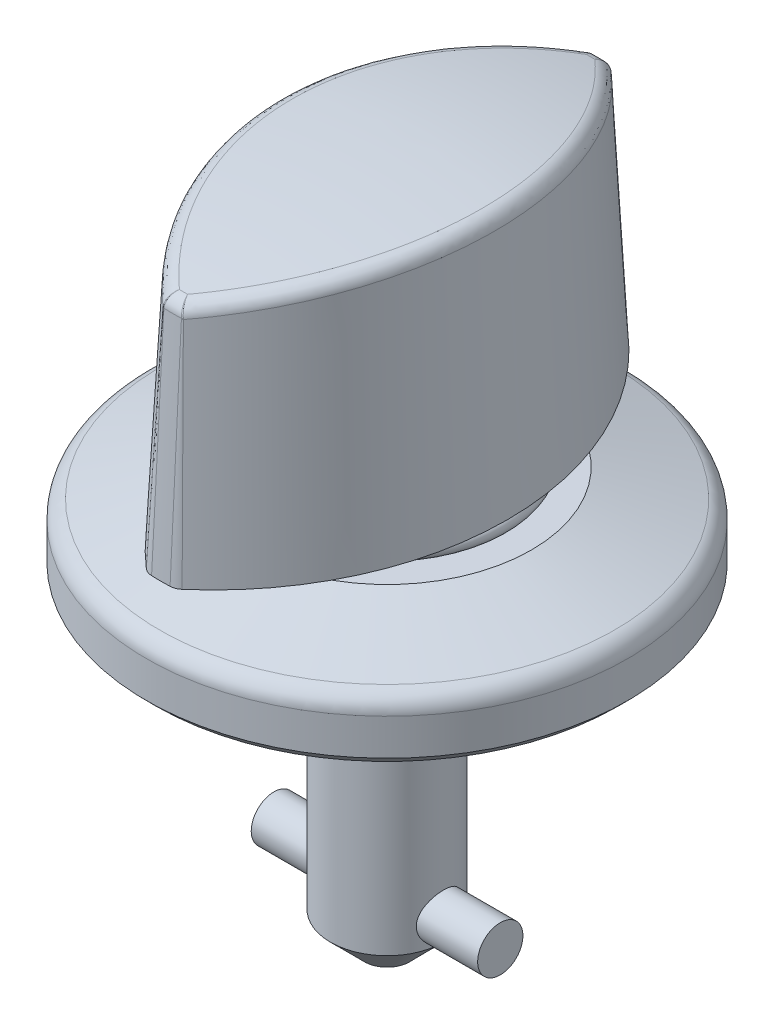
ISO-10303-21;
HEADER;
FILE_DESCRIPTION(('STEP AP214'),'2;1');
FILE_NAME('part.step','',(''),(''),'','','');
FILE_SCHEMA(('AUTOMOTIVE_DESIGN { 1 0 10303 214 1 1 1 1 }'));
ENDSEC;
DATA;
#1=APPLICATION_CONTEXT('core data for automotive mechanical design processes');
#2=APPLICATION_PROTOCOL_DEFINITION('international standard','automotive_design',2000,#1);
#3=PRODUCT_CONTEXT('',#1,'mechanical');
#4=PRODUCT('Part','Part','',(#3));
#5=PRODUCT_RELATED_PRODUCT_CATEGORY('part','',(#4));
#6=PRODUCT_DEFINITION_FORMATION('','',#4);
#7=PRODUCT_DEFINITION_CONTEXT('part definition',#1,'design');
#8=PRODUCT_DEFINITION('design','',#6,#7);
#9=PRODUCT_DEFINITION_SHAPE('','',#8);
#10=(LENGTH_UNIT() NAMED_UNIT(*) SI_UNIT(.MILLI.,.METRE.));
#11=(NAMED_UNIT(*) PLANE_ANGLE_UNIT() SI_UNIT($,.RADIAN.));
#12=(NAMED_UNIT(*) SI_UNIT($,.STERADIAN.) SOLID_ANGLE_UNIT());
#13=UNCERTAINTY_MEASURE_WITH_UNIT(LENGTH_MEASURE(1.E-05),#10,'distance_accuracy_value','');
#14=(GEOMETRIC_REPRESENTATION_CONTEXT(3) GLOBAL_UNCERTAINTY_ASSIGNED_CONTEXT((#13)) GLOBAL_UNIT_ASSIGNED_CONTEXT((#10,
#11,#12)) REPRESENTATION_CONTEXT('',''));
#15=CARTESIAN_POINT('',(0.,0.,0.));
#16=DIRECTION('',(0.,0.,1.));
#17=DIRECTION('',(1.,0.,0.));
#18=AXIS2_PLACEMENT_3D('',#15,#16,#17);
#19=CARTESIAN_POINT('',(0.,-17.5,0.));
#20=DIRECTION('',(0.,-1.,0.));
#21=DIRECTION('',(0.,0.,-1.));
#22=AXIS2_PLACEMENT_3D('',#19,#20,#21);
#23=PLANE('',#22);
#24=CARTESIAN_POINT('',(0.,-17.5,0.));
#25=DIRECTION('',(0.,-1.,0.));
#26=DIRECTION('',(0.,0.,-1.));
#27=AXIS2_PLACEMENT_3D('',#24,#25,#26);
#28=CIRCLE('',#27,1.6);
#29=CARTESIAN_POINT('',(0.,-17.5,-1.6));
#30=VERTEX_POINT('',#29);
#31=EDGE_CURVE('P0_E41',#30,#30,#28,.T.);
#32=ORIENTED_EDGE('',*,*,#31,.T.);
#33=EDGE_LOOP('',(#32));
#34=FACE_BOUND('',#33,.T.);
#35=ADVANCED_FACE('P0_F16',(#34),#23,.T.);
#36=CARTESIAN_POINT('',(0.,-17.5,0.));
#37=DIRECTION('',(0.,1.,0.));
#38=DIRECTION('',(0.,0.,1.));
#39=AXIS2_PLACEMENT_3D('',#36,#37,#38);
#40=CONICAL_SURFACE('',#39,1.6,0.78539816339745);
#41=CARTESIAN_POINT('',(0.,-15.1,0.));
#42=DIRECTION('',(0.,-1.,0.));
#43=DIRECTION('',(0.,0.,-1.));
#44=AXIS2_PLACEMENT_3D('',#41,#42,#43);
#45=CIRCLE('',#44,4.);
#46=CARTESIAN_POINT('',(4.00000000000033,-15.1000000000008,0.));
#47=VERTEX_POINT('',#46);
#48=CARTESIAN_POINT('',(-4.,-15.1,0.));
#49=VERTEX_POINT('',#48);
#50=EDGE_CURVE('P0_E34',#47,#49,#45,.T.);
#51=ORIENTED_EDGE('',*,*,#50,.T.);
#52=EDGE_CURVE('P0_E40',#49,#47,#45,.T.);
#53=ORIENTED_EDGE('',*,*,#52,.T.);
#54=EDGE_LOOP('',(#51,#53));
#55=FACE_BOUND('',#54,.T.);
#56=ORIENTED_EDGE('',*,*,#31,.F.);
#57=EDGE_LOOP('',(#56));
#58=FACE_BOUND('',#57,.T.);
#59=ADVANCED_FACE('P0_F38',(#55,#58),#40,.T.);
#60=CARTESIAN_POINT('',(0.,-17.5,0.));
#61=DIRECTION('',(0.,-1.,0.));
#62=DIRECTION('',(0.,0.,-1.));
#63=AXIS2_PLACEMENT_3D('',#60,#61,#62);
#64=CYLINDRICAL_SURFACE('',#63,4.);
#65=CARTESIAN_POINT('',(0.,0.,0.));
#66=DIRECTION('',(0.,-1.,0.));
#67=DIRECTION('',(0.,0.,-1.));
#68=AXIS2_PLACEMENT_3D('',#65,#66,#67);
#69=CIRCLE('',#68,4.);
#70=CARTESIAN_POINT('',(0.,0.,-4.));
#71=VERTEX_POINT('',#70);
#72=EDGE_CURVE('P0_E45',#71,#71,#69,.T.);
#73=ORIENTED_EDGE('',*,*,#72,.T.);
#74=EDGE_LOOP('',(#73));
#75=FACE_BOUND('',#74,.T.);
#76=ORIENTED_EDGE('',*,*,#50,.F.);
#77=CARTESIAN_POINT('',(3.66606055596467,-13.5,1.6));
#78=CARTESIAN_POINT('',(3.66606921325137,-13.5857115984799,1.59999060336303));
#79=CARTESIAN_POINT('',(3.66910881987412,-13.6715444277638,1.59307185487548));
#80=CARTESIAN_POINT('',(3.68088731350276,-13.8407478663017,1.56565522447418));
#81=CARTESIAN_POINT('',(3.68964076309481,-13.9241116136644,1.5451226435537));
#82=CARTESIAN_POINT('',(3.71168364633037,-14.0856423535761,1.49138802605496));
#83=CARTESIAN_POINT('',(3.72495597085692,-14.1638276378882,1.45823372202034));
#84=CARTESIAN_POINT('',(3.75451732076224,-14.3135080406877,1.38033621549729));
#85=CARTESIAN_POINT('',(3.77080568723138,-14.3850046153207,1.335595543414));
#86=CARTESIAN_POINT('',(3.80560692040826,-14.5234083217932,1.23305757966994));
#87=CARTESIAN_POINT('',(3.82419134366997,-14.5898851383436,1.17470348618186));
#88=CARTESIAN_POINT('',(3.86089965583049,-14.7124231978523,1.04776728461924));
#89=CARTESIAN_POINT('',(3.87902338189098,-14.7684808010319,0.979181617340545));
#90=CARTESIAN_POINT('',(3.91362726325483,-14.8707251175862,0.830405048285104));
#91=CARTESIAN_POINT('',(3.93001442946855,-14.9164354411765,0.749863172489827));
#92=CARTESIAN_POINT('',(3.95843142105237,-14.9934748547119,0.581460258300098));
#93=CARTESIAN_POINT('',(3.97046301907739,-15.0248097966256,0.493602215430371));
#94=CARTESIAN_POINT('',(3.98830660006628,-15.0706731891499,0.317573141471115));
#95=CARTESIAN_POINT('',(3.99439149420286,-15.0859418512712,0.229623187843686));
#96=CARTESIAN_POINT('',(4.00064248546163,-15.1016227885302,0.0522130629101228));
#97=CARTESIAN_POINT('',(4.0008107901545,-15.1020406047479,-0.0372465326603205));
#98=CARTESIAN_POINT('',(3.99537570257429,-15.08841378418,-0.209785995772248));
#99=CARTESIAN_POINT('',(3.99009597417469,-15.0751801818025,-0.292941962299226));
#100=CARTESIAN_POINT('',(3.97479433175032,-15.0360056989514,-0.45573848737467));
#101=CARTESIAN_POINT('',(3.9647720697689,-15.0100638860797,-0.535378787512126));
#102=CARTESIAN_POINT('',(3.9407745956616,-14.945890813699,-0.690318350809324));
#103=CARTESIAN_POINT('',(3.9267420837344,-14.9074802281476,-0.765534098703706));
#104=CARTESIAN_POINT('',(3.89611668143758,-14.8196279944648,-0.908646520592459));
#105=CARTESIAN_POINT('',(3.87952291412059,-14.7701825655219,-0.976540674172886));
#106=CARTESIAN_POINT('',(3.84417309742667,-14.6578806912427,-1.10781506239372));
#107=CARTESIAN_POINT('',(3.82534661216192,-14.5943568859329,-1.17060627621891));
#108=CARTESIAN_POINT('',(3.78849328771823,-14.4576075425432,-1.28488593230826));
#109=CARTESIAN_POINT('',(3.77046671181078,-14.3843788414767,-1.33637067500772));
#110=CARTESIAN_POINT('',(3.7367751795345,-14.2276647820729,-1.42792335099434));
#111=CARTESIAN_POINT('',(3.72119131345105,-14.143948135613,-1.46762772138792));
#112=CARTESIAN_POINT('',(3.69510072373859,-13.9702276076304,-1.53214100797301));
#113=CARTESIAN_POINT('',(3.68459070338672,-13.8802278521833,-1.55695959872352));
#114=CARTESIAN_POINT('',(3.67063807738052,-13.7023713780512,-1.58956395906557));
#115=CARTESIAN_POINT('',(3.6668029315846,-13.6147196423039,-1.59829767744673));
#116=CARTESIAN_POINT('',(3.66551598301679,-13.4391382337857,-1.60124906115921));
#117=CARTESIAN_POINT('',(3.6680622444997,-13.3512086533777,-1.59547112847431));
#118=CARTESIAN_POINT('',(3.67884835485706,-13.1828328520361,-1.57042631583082));
#119=CARTESIAN_POINT('',(3.68675566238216,-13.1022456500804,-1.55194644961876));
#120=CARTESIAN_POINT('',(3.70696040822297,-12.9453692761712,-1.50304334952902));
#121=CARTESIAN_POINT('',(3.71925881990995,-12.8690810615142,-1.47261746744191));
#122=CARTESIAN_POINT('',(3.7474702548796,-12.7195181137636,-1.39930851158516));
#123=CARTESIAN_POINT('',(3.76350963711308,-12.6464910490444,-1.35597029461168));
#124=CARTESIAN_POINT('',(3.7972030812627,-12.5084136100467,-1.2585321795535));
#125=CARTESIAN_POINT('',(3.8148577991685,-12.4433665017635,-1.20442789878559));
#126=CARTESIAN_POINT('',(3.85136732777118,-12.3181012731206,-1.08227536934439));
#127=CARTESIAN_POINT('',(3.87021445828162,-12.2585947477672,-1.01349234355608));
#128=CARTESIAN_POINT('',(3.9057583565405,-12.1518583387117,-0.866466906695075));
#129=CARTESIAN_POINT('',(3.92245503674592,-12.1046289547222,-0.788224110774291));
#130=CARTESIAN_POINT('',(3.95186972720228,-12.023961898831,-0.624223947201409));
#131=CARTESIAN_POINT('',(3.96458868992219,-11.9905209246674,-0.538468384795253));
#132=CARTESIAN_POINT('',(3.98458170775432,-11.9387609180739,-0.36191487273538));
#133=CARTESIAN_POINT('',(3.99185871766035,-11.920433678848,-0.271119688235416));
#134=CARTESIAN_POINT('',(3.9998320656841,-11.9003962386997,-0.0934532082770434));
#135=CARTESIAN_POINT('',(4.00092677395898,-11.8976798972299,-0.00671239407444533));
#136=CARTESIAN_POINT('',(3.99748833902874,-11.9062843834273,0.165947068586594));
#137=CARTESIAN_POINT('',(3.9929560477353,-11.9176030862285,0.251865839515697));
#138=CARTESIAN_POINT('',(3.97897210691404,-11.9532374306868,0.417736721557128));
#139=CARTESIAN_POINT('',(3.96967584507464,-11.9771431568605,0.497791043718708));
#140=CARTESIAN_POINT('',(3.9471595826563,-12.0368422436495,0.652737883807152));
#141=CARTESIAN_POINT('',(3.93393885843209,-12.0726377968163,0.72762944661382));
#142=CARTESIAN_POINT('',(3.90414475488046,-12.1568825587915,0.873762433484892));
#143=CARTESIAN_POINT('',(3.88744903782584,-12.2058210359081,0.94469630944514));
#144=CARTESIAN_POINT('',(3.85271522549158,-12.3142308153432,1.07764322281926));
#145=CARTESIAN_POINT('',(3.834676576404,-12.3737064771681,1.1396525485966));
#146=CARTESIAN_POINT('',(3.79790210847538,-12.50585217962,1.25696101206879));
#147=CARTESIAN_POINT('',(3.77919226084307,-12.5791110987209,1.31160710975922));
#148=CARTESIAN_POINT('',(3.74439737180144,-12.734353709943,1.40787796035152));
#149=CARTESIAN_POINT('',(3.72831263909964,-12.8163384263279,1.44950118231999));
#150=CARTESIAN_POINT('',(3.70207091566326,-12.9792297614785,1.51519287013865));
#151=CARTESIAN_POINT('',(3.69151134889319,-13.059572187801,1.54050201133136));
#152=CARTESIAN_POINT('',(3.67556802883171,-13.2235883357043,1.57817420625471));
#153=CARTESIAN_POINT('',(3.6701698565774,-13.3072520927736,1.59057333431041));
#154=CARTESIAN_POINT('',(3.66659567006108,-13.4275020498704,1.59877140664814));
#155=CARTESIAN_POINT('',(3.66605689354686,-13.4637401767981,1.6000039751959));
#156=CARTESIAN_POINT('',(3.66606055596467,-13.5,1.6));
#157=B_SPLINE_CURVE_WITH_KNOTS('',3,(#77,#78,#79,#80,#81,#82,#83,#84,#85,#86,#87,#88,#89,#90,
#91,#92,#93,#94,#95,#96,#97,#98,#99,#100,#101,#102,#103,#104,#105,#106,#107,#108,#109,#110,#111,
#112,#113,#114,#115,#116,#117,#118,#119,#120,#121,#122,#123,#124,#125,#126,#127,#128,#129,#130,
#131,#132,#133,#134,#135,#136,#137,#138,#139,#140,#141,#142,#143,#144,#145,#146,#147,#148,#149,
#150,#151,#152,#153,#154,#155,#156),.UNSPECIFIED.,.T.,.F.,(4,2,2,2,2,2,2,2,2,2,2,2,2,2,2,2,2,2,
2,2,2,2,2,2,2,2,2,2,2,2,2,2,2,2,2,2,2,2,2,4),(0.,0.257022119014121,0.514701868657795,
0.771416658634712,1.02807543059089,1.2980449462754,1.56810859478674,1.84882135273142,
2.12941973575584,2.39643346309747,2.66334756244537,2.91526915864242,3.16720924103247,
3.42294640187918,3.67877131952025,3.95139235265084,4.22410245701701,4.50451566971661,
4.78474643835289,5.04785718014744,5.31088811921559,5.55893798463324,5.80704286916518,
6.06520923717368,6.32348091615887,6.60082987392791,6.87819011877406,7.15548389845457,
7.43262700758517,7.6916883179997,7.95071041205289,8.20177595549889,8.45288782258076,
8.71509640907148,8.97741373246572,9.25597002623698,9.53455905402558,9.78813328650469,
10.040997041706,10.1497288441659),.UNSPECIFIED.);
#158=EDGE_CURVE('P0_E11',#47,#47,#157,.T.);
#159=ORIENTED_EDGE('',*,*,#158,.F.);
#160=ORIENTED_EDGE('',*,*,#52,.F.);
#161=CARTESIAN_POINT('',(-3.66606055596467,-13.5,1.6));
#162=CARTESIAN_POINT('',(-3.66606921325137,-13.4142884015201,1.59999060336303));
#163=CARTESIAN_POINT('',(-3.66910881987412,-13.3284555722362,1.59307185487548));
#164=CARTESIAN_POINT('',(-3.68088731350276,-13.1592521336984,1.56565522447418));
#165=CARTESIAN_POINT('',(-3.68964076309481,-13.0758883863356,1.5451226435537));
#166=CARTESIAN_POINT('',(-3.71168364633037,-12.914357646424,1.49138802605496));
#167=CARTESIAN_POINT('',(-3.72495597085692,-12.8361723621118,1.45823372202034));
#168=CARTESIAN_POINT('',(-3.75451732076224,-12.6864919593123,1.38033621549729));
#169=CARTESIAN_POINT('',(-3.77080568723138,-12.6149953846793,1.335595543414));
#170=CARTESIAN_POINT('',(-3.80560692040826,-12.4765916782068,1.23305757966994));
#171=CARTESIAN_POINT('',(-3.82419134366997,-12.4101148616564,1.17470348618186));
#172=CARTESIAN_POINT('',(-3.86089965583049,-12.2875768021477,1.04776728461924));
#173=CARTESIAN_POINT('',(-3.87902338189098,-12.2315191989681,0.979181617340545));
#174=CARTESIAN_POINT('',(-3.91362726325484,-12.1292748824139,0.830405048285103));
#175=CARTESIAN_POINT('',(-3.93001442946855,-12.0835645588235,0.749863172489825));
#176=CARTESIAN_POINT('',(-3.95843142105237,-12.0065251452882,0.581460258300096));
#177=CARTESIAN_POINT('',(-3.97046301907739,-11.9751902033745,0.49360221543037));
#178=CARTESIAN_POINT('',(-3.98830660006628,-11.9293268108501,0.317573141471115));
#179=CARTESIAN_POINT('',(-3.99439149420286,-11.9140581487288,0.229623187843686));
#180=CARTESIAN_POINT('',(-4.00064248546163,-11.8983772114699,0.0522130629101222));
#181=CARTESIAN_POINT('',(-4.0008107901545,-11.8979593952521,-0.0372465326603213));
#182=CARTESIAN_POINT('',(-3.99537570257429,-11.91158621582,-0.209785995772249));
#183=CARTESIAN_POINT('',(-3.99009597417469,-11.9248198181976,-0.292941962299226));
#184=CARTESIAN_POINT('',(-3.97479433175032,-11.9639943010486,-0.45573848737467));
#185=CARTESIAN_POINT('',(-3.9647720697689,-11.9899361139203,-0.535378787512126));
#186=CARTESIAN_POINT('',(-3.9407745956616,-12.0541091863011,-0.690318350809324));
#187=CARTESIAN_POINT('',(-3.9267420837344,-12.0925197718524,-0.765534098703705));
#188=CARTESIAN_POINT('',(-3.89611668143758,-12.1803720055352,-0.908646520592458));
#189=CARTESIAN_POINT('',(-3.87952291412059,-12.2298174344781,-0.976540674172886));
#190=CARTESIAN_POINT('',(-3.84417309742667,-12.3421193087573,-1.10781506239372));
#191=CARTESIAN_POINT('',(-3.82534661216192,-12.4056431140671,-1.17060627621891));
#192=CARTESIAN_POINT('',(-3.78849328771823,-12.5423924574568,-1.28488593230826));
#193=CARTESIAN_POINT('',(-3.77046671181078,-12.6156211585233,-1.33637067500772));
#194=CARTESIAN_POINT('',(-3.7367751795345,-12.7723352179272,-1.42792335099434));
#195=CARTESIAN_POINT('',(-3.72119131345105,-12.8560518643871,-1.46762772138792));
#196=CARTESIAN_POINT('',(-3.69510072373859,-13.0297723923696,-1.53214100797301));
#197=CARTESIAN_POINT('',(-3.68459070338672,-13.1197721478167,-1.55695959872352));
#198=CARTESIAN_POINT('',(-3.67063807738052,-13.2976286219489,-1.58956395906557));
#199=CARTESIAN_POINT('',(-3.6668029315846,-13.3852803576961,-1.59829767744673));
#200=CARTESIAN_POINT('',(-3.66551598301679,-13.5608617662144,-1.60124906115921));
#201=CARTESIAN_POINT('',(-3.6680622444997,-13.6487913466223,-1.59547112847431));
#202=CARTESIAN_POINT('',(-3.67884835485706,-13.8171671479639,-1.57042631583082));
#203=CARTESIAN_POINT('',(-3.68675566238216,-13.8977543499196,-1.55194644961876));
#204=CARTESIAN_POINT('',(-3.70696040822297,-14.0546307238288,-1.50304334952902));
#205=CARTESIAN_POINT('',(-3.71925881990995,-14.1309189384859,-1.47261746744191));
#206=CARTESIAN_POINT('',(-3.7474702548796,-14.2804818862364,-1.39930851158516));
#207=CARTESIAN_POINT('',(-3.76350963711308,-14.3535089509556,-1.35597029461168));
#208=CARTESIAN_POINT('',(-3.7972030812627,-14.4915863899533,-1.2585321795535));
#209=CARTESIAN_POINT('',(-3.8148577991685,-14.5566334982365,-1.20442789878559));
#210=CARTESIAN_POINT('',(-3.85136732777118,-14.6818987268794,-1.08227536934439));
#211=CARTESIAN_POINT('',(-3.87021445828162,-14.7414052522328,-1.01349234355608));
#212=CARTESIAN_POINT('',(-3.9057583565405,-14.8481416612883,-0.866466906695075));
#213=CARTESIAN_POINT('',(-3.92245503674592,-14.8953710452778,-0.788224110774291));
#214=CARTESIAN_POINT('',(-3.95186972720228,-14.976038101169,-0.624223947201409));
#215=CARTESIAN_POINT('',(-3.96458868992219,-15.0094790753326,-0.538468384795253));
#216=CARTESIAN_POINT('',(-3.98458170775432,-15.0612390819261,-0.361914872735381));
#217=CARTESIAN_POINT('',(-3.99185871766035,-15.0795663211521,-0.271119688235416));
#218=CARTESIAN_POINT('',(-3.9998320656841,-15.0996037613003,-0.093453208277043));
#219=CARTESIAN_POINT('',(-4.00092677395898,-15.1023201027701,-0.0067123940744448));
#220=CARTESIAN_POINT('',(-3.99748833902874,-15.0937156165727,0.165947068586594));
#221=CARTESIAN_POINT('',(-3.9929560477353,-15.0823969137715,0.251865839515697));
#222=CARTESIAN_POINT('',(-3.97897210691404,-15.0467625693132,0.417736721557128));
#223=CARTESIAN_POINT('',(-3.96967584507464,-15.0228568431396,0.497791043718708));
#224=CARTESIAN_POINT('',(-3.9471595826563,-14.9631577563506,0.652737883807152));
#225=CARTESIAN_POINT('',(-3.93393885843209,-14.9273622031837,0.72762944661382));
#226=CARTESIAN_POINT('',(-3.90414475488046,-14.8431174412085,0.873762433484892));
#227=CARTESIAN_POINT('',(-3.88744903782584,-14.7941789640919,0.94469630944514));
#228=CARTESIAN_POINT('',(-3.85271522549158,-14.6857691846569,1.07764322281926));
#229=CARTESIAN_POINT('',(-3.834676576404,-14.6262935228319,1.1396525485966));
#230=CARTESIAN_POINT('',(-3.79790210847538,-14.49414782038,1.25696101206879));
#231=CARTESIAN_POINT('',(-3.77919226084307,-14.4208889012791,1.31160710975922));
#232=CARTESIAN_POINT('',(-3.74439737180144,-14.265646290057,1.40787796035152));
#233=CARTESIAN_POINT('',(-3.72831263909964,-14.1836615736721,1.44950118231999));
#234=CARTESIAN_POINT('',(-3.70207091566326,-14.0207702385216,1.51519287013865));
#235=CARTESIAN_POINT('',(-3.69151134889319,-13.9404278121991,1.54050201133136));
#236=CARTESIAN_POINT('',(-3.67556802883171,-13.7764116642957,1.57817420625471));
#237=CARTESIAN_POINT('',(-3.6701698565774,-13.6927479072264,1.59057333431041));
#238=CARTESIAN_POINT('',(-3.66659567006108,-13.5724979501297,1.59877140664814));
#239=CARTESIAN_POINT('',(-3.66605689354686,-13.5362598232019,1.6000039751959));
#240=CARTESIAN_POINT('',(-3.66606055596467,-13.5,1.6));
#241=B_SPLINE_CURVE_WITH_KNOTS('',3,(#161,#162,#163,#164,#165,#166,#167,#168,#169,#170,#171,
#172,#173,#174,#175,#176,#177,#178,#179,#180,#181,#182,#183,#184,#185,#186,#187,#188,#189,#190,
#191,#192,#193,#194,#195,#196,#197,#198,#199,#200,#201,#202,#203,#204,#205,#206,#207,#208,#209,
#210,#211,#212,#213,#214,#215,#216,#217,#218,#219,#220,#221,#222,#223,#224,#225,#226,#227,#228,
#229,#230,#231,#232,#233,#234,#235,#236,#237,#238,#239,#240),.UNSPECIFIED.,.T.,.F.,(4,2,2,2,2,2,
2,2,2,2,2,2,2,2,2,2,2,2,2,2,2,2,2,2,2,2,2,2,2,2,2,2,2,2,2,2,2,2,2,4),(0.,0.257022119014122,
0.514701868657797,0.771416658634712,1.02807543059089,1.2980449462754,1.56810859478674,
1.84882135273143,2.12941973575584,2.39643346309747,2.66334756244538,2.91526915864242,
3.16720924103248,3.42294640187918,3.67877131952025,3.95139235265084,4.22410245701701,
4.50451566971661,4.78474643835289,5.04785718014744,5.31088811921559,5.55893798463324,
5.80704286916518,6.06520923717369,6.32348091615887,6.60082987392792,6.87819011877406,
7.15548389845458,7.43262700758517,7.6916883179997,7.95071041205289,8.2017759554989,
8.45288782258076,8.71509640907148,8.97741373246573,9.25597002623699,9.53455905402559,
9.78813328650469,10.040997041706,10.1497288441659),.UNSPECIFIED.);
#242=EDGE_CURVE('P0_E27',#49,#49,#241,.T.);
#243=ORIENTED_EDGE('',*,*,#242,.F.);
#244=EDGE_LOOP('',(#76,#159,#160,#243));
#245=FACE_BOUND('',#244,.T.);
#246=ADVANCED_FACE('P0_F43',(#75,#245),#64,.T.);
#247=CARTESIAN_POINT('',(4.,0.,0.));
#248=DIRECTION('',(0.,1.,0.));
#249=DIRECTION('',(0.,0.,1.));
#250=AXIS2_PLACEMENT_3D('',#247,#248,#249);
#251=PLANE('',#250);
#252=CARTESIAN_POINT('',(0.,0.,0.));
#253=DIRECTION('',(0.,-1.,0.));
#254=DIRECTION('',(0.,0.,-1.));
#255=AXIS2_PLACEMENT_3D('',#252,#253,#254);
#256=CIRCLE('',#255,3.2);
#257=CARTESIAN_POINT('',(0.,0.,-3.2));
#258=VERTEX_POINT('',#257);
#259=EDGE_CURVE('P0_E47',#258,#258,#256,.T.);
#260=ORIENTED_EDGE('',*,*,#259,.T.);
#261=EDGE_LOOP('',(#260));
#262=FACE_BOUND('',#261,.T.);
#263=ORIENTED_EDGE('',*,*,#72,.F.);
#264=EDGE_LOOP('',(#263));
#265=FACE_BOUND('',#264,.T.);
#266=ADVANCED_FACE('P0_F79',(#262,#265),#251,.T.);
#267=CARTESIAN_POINT('',(0.,-17.5,0.));
#268=DIRECTION('',(0.,-1.,0.));
#269=DIRECTION('',(0.,0.,-1.));
#270=AXIS2_PLACEMENT_3D('',#267,#268,#269);
#271=CYLINDRICAL_SURFACE('',#270,3.2);
#272=CARTESIAN_POINT('',(0.,20.2,0.));
#273=DIRECTION('',(0.,-1.,0.));
#274=DIRECTION('',(0.,0.,-1.));
#275=AXIS2_PLACEMENT_3D('',#272,#273,#274);
#276=CIRCLE('',#275,3.2);
#277=CARTESIAN_POINT('',(0.,20.2,-3.2));
#278=VERTEX_POINT('',#277);
#279=EDGE_CURVE('P0_E155',#278,#278,#276,.T.);
#280=ORIENTED_EDGE('',*,*,#279,.T.);
#281=EDGE_LOOP('',(#280));
#282=FACE_BOUND('',#281,.T.);
#283=ORIENTED_EDGE('',*,*,#259,.F.);
#284=EDGE_LOOP('',(#283));
#285=FACE_BOUND('',#284,.T.);
#286=ADVANCED_FACE('P0_F76',(#282,#285),#271,.T.);
#287=CARTESIAN_POINT('',(0.,20.2,0.));
#288=DIRECTION('',(0.,-1.,0.));
#289=DIRECTION('',(0.,0.,-1.));
#290=AXIS2_PLACEMENT_3D('',#287,#288,#289);
#291=CONICAL_SURFACE('',#290,3.2,0.785398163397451);
#292=CARTESIAN_POINT('',(0.,21.,0.));
#293=DIRECTION('',(0.,-1.,0.));
#294=DIRECTION('',(0.,0.,-1.));
#295=AXIS2_PLACEMENT_3D('',#292,#293,#294);
#296=CIRCLE('',#295,2.4);
#297=CARTESIAN_POINT('',(0.,21.,-2.4));
#298=VERTEX_POINT('',#297);
#299=EDGE_CURVE('P0_E150',#298,#298,#296,.T.);
#300=ORIENTED_EDGE('',*,*,#299,.T.);
#301=EDGE_LOOP('',(#300));
#302=FACE_BOUND('',#301,.T.);
#303=ORIENTED_EDGE('',*,*,#279,.F.);
#304=EDGE_LOOP('',(#303));
#305=FACE_BOUND('',#304,.T.);
#306=ADVANCED_FACE('P0_F72',(#302,#305),#291,.T.);
#307=CARTESIAN_POINT('',(2.4,21.,0.));
#308=DIRECTION('',(0.,1.,0.));
#309=DIRECTION('',(0.,0.,1.));
#310=AXIS2_PLACEMENT_3D('',#307,#308,#309);
#311=PLANE('',#310);
#312=ORIENTED_EDGE('',*,*,#299,.F.);
#313=EDGE_LOOP('',(#312));
#314=FACE_BOUND('',#313,.T.);
#315=ADVANCED_FACE('P0_F68',(#314),#311,.T.);
#316=CARTESIAN_POINT('',(-8.,-13.5,0.));
#317=DIRECTION('',(-1.,0.,0.));
#318=DIRECTION('',(0.,0.,1.));
#319=AXIS2_PLACEMENT_3D('',#316,#317,#318);
#320=PLANE('',#319);
#321=CARTESIAN_POINT('',(-8.,-13.5,0.));
#322=DIRECTION('',(-1.,0.,0.));
#323=DIRECTION('',(0.,0.,1.));
#324=AXIS2_PLACEMENT_3D('',#321,#322,#323);
#325=CIRCLE('',#324,1.6);
#326=CARTESIAN_POINT('',(-8.,-13.5,1.6));
#327=VERTEX_POINT('',#326);
#328=EDGE_CURVE('P0_E147',#327,#327,#325,.T.);
#329=ORIENTED_EDGE('',*,*,#328,.T.);
#330=EDGE_LOOP('',(#329));
#331=FACE_BOUND('',#330,.T.);
#332=ADVANCED_FACE('P0_F62',(#331),#320,.T.);
#333=CARTESIAN_POINT('',(-5.26029262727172,-13.5,0.));
#334=DIRECTION('',(-1.,0.,0.));
#335=DIRECTION('',(0.,0.,1.));
#336=AXIS2_PLACEMENT_3D('',#333,#334,#335);
#337=CYLINDRICAL_SURFACE('',#336,1.6);
#338=ORIENTED_EDGE('',*,*,#242,.T.);
#339=EDGE_LOOP('',(#338));
#340=FACE_BOUND('',#339,.T.);
#341=ORIENTED_EDGE('',*,*,#328,.F.);
#342=EDGE_LOOP('',(#341));
#343=FACE_BOUND('',#342,.T.);
#344=ADVANCED_FACE('P0_F56',(#340,#343),#337,.T.);
#345=ORIENTED_EDGE('',*,*,#158,.T.);
#346=EDGE_LOOP('',(#345));
#347=FACE_BOUND('',#346,.T.);
#348=CARTESIAN_POINT('',(8.,-13.5,0.));
#349=DIRECTION('',(-1.,0.,0.));
#350=DIRECTION('',(0.,0.,1.));
#351=AXIS2_PLACEMENT_3D('',#348,#349,#350);
#352=CIRCLE('',#351,1.6);
#353=CARTESIAN_POINT('',(8.,-13.5,1.6));
#354=VERTEX_POINT('',#353);
#355=EDGE_CURVE('P0_E145',#354,#354,#352,.T.);
#356=ORIENTED_EDGE('',*,*,#355,.T.);
#357=EDGE_LOOP('',(#356));
#358=FACE_BOUND('',#357,.T.);
#359=ADVANCED_FACE('P0_F61',(#347,#358),#337,.T.);
#360=CARTESIAN_POINT('',(8.,-15.1,0.));
#361=DIRECTION('',(1.,0.,0.));
#362=DIRECTION('',(0.,0.,-1.));
#363=AXIS2_PLACEMENT_3D('',#360,#361,#362);
#364=PLANE('',#363);
#365=ORIENTED_EDGE('',*,*,#355,.F.);
#366=EDGE_LOOP('',(#365));
#367=FACE_BOUND('',#366,.T.);
#368=ADVANCED_FACE('P0_F64',(#367),#364,.T.);
#369=CLOSED_SHELL('',(#35,#59,#246,#266,#286,#306,#315,#332,#344,#359,#368));
#370=MANIFOLD_SOLID_BREP('P0_B1',#369);
#371=CARTESIAN_POINT('',(16.,13.,0.));
#372=DIRECTION('',(0.,-1.,0.));
#373=DIRECTION('',(0.,0.,-1.));
#374=AXIS2_PLACEMENT_3D('',#371,#372,#373);
#375=PLANE('',#374);
#376=CARTESIAN_POINT('',(0.,13.,0.));
#377=DIRECTION('',(0.,-1.,0.));
#378=DIRECTION('',(0.,0.,-1.));
#379=AXIS2_PLACEMENT_3D('',#376,#377,#378);
#380=CIRCLE('',#379,3.2);
#381=CARTESIAN_POINT('',(0.,13.,-3.2));
#382=VERTEX_POINT('',#381);
#383=EDGE_CURVE('P1_E678',#382,#382,#380,.T.);
#384=ORIENTED_EDGE('',*,*,#383,.F.);
#385=EDGE_LOOP('',(#384));
#386=FACE_BOUND('',#385,.T.);
#387=CARTESIAN_POINT('',(-12.25,13.,0.));
#388=DIRECTION('',(0.,-1.,0.));
#389=DIRECTION('',(0.,0.,1.));
#390=AXIS2_PLACEMENT_3D('',#387,#388,#389);
#391=CIRCLE('',#390,20.75);
#392=CARTESIAN_POINT('',(1.26349780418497,13.,-15.7463607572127));
#393=VERTEX_POINT('',#392);
#394=CARTESIAN_POINT('',(1.26349780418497,13.,15.7463607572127));
#395=VERTEX_POINT('',#394);
#396=EDGE_CURVE('P1_E758',#393,#395,#391,.T.);
#397=ORIENTED_EDGE('',*,*,#396,.T.);
#398=CARTESIAN_POINT('',(0.612244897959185,13.,14.987499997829));
#399=DIRECTION('',(0.,-1.,0.));
#400=DIRECTION('',(0.,0.,-1.));
#401=AXIS2_PLACEMENT_3D('',#398,#399,#400);
#402=CIRCLE('',#401,1.);
#403=CARTESIAN_POINT('',(0.653061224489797,13.,15.9866666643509));
#404=VERTEX_POINT('',#403);
#405=EDGE_CURVE('P1_E76',#395,#404,#402,.T.);
#406=ORIENTED_EDGE('',*,*,#405,.T.);
#407=CARTESIAN_POINT('',(0.,13.,0.));
#408=DIRECTION('',(0.,-1.,0.));
#409=DIRECTION('',(0.,0.,-1.));
#410=AXIS2_PLACEMENT_3D('',#407,#408,#409);
#411=CIRCLE('',#410,16.);
#412=CARTESIAN_POINT('',(-0.653061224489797,13.,15.9866666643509));
#413=VERTEX_POINT('',#412);
#414=EDGE_CURVE('P1_E691',#404,#413,#411,.T.);
#415=ORIENTED_EDGE('',*,*,#414,.T.);
#416=CARTESIAN_POINT('',(-0.612244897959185,13.,14.987499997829));
#417=DIRECTION('',(0.,-1.,0.));
#418=DIRECTION('',(0.,0.,-1.));
#419=AXIS2_PLACEMENT_3D('',#416,#417,#418);
#420=CIRCLE('',#419,1.);
#421=CARTESIAN_POINT('',(-1.26349780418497,13.,15.7463607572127));
#422=VERTEX_POINT('',#421);
#423=EDGE_CURVE('P1_E686',#413,#422,#420,.T.);
#424=ORIENTED_EDGE('',*,*,#423,.T.);
#425=CARTESIAN_POINT('',(12.25,13.,0.));
#426=DIRECTION('',(0.,-1.,0.));
#427=DIRECTION('',(0.,0.,-1.));
#428=AXIS2_PLACEMENT_3D('',#425,#426,#427);
#429=CIRCLE('',#428,20.75);
#430=CARTESIAN_POINT('',(-1.26349780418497,13.,-15.7463607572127));
#431=VERTEX_POINT('',#430);
#432=EDGE_CURVE('P1_E697',#422,#431,#429,.T.);
#433=ORIENTED_EDGE('',*,*,#432,.T.);
#434=CARTESIAN_POINT('',(-0.612244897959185,13.,-14.987499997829));
#435=DIRECTION('',(0.,-1.,0.));
#436=DIRECTION('',(0.,0.,-1.));
#437=AXIS2_PLACEMENT_3D('',#434,#435,#436);
#438=CIRCLE('',#437,1.);
#439=CARTESIAN_POINT('',(-0.653061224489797,13.,-15.9866666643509));
#440=VERTEX_POINT('',#439);
#441=EDGE_CURVE('P1_E705',#431,#440,#438,.T.);
#442=ORIENTED_EDGE('',*,*,#441,.T.);
#443=CARTESIAN_POINT('',(0.653061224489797,13.,-15.9866666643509));
#444=VERTEX_POINT('',#443);
#445=EDGE_CURVE('P1_E603',#440,#444,#411,.T.);
#446=ORIENTED_EDGE('',*,*,#445,.T.);
#447=CARTESIAN_POINT('',(0.612244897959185,13.,-14.987499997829));
#448=DIRECTION('',(0.,-1.,0.));
#449=DIRECTION('',(0.,0.,-1.));
#450=AXIS2_PLACEMENT_3D('',#447,#448,#449);
#451=CIRCLE('',#450,1.);
#452=EDGE_CURVE('P1_E689',#444,#393,#451,.T.);
#453=ORIENTED_EDGE('',*,*,#452,.T.);
#454=EDGE_LOOP('',(#397,#406,#415,#424,#433,#442,#446,#453));
#455=FACE_BOUND('',#454,.T.);
#456=ADVANCED_FACE('P1_F16',(#386,#455),#375,.T.);
#457=CARTESIAN_POINT('',(0.,-33.5,0.));
#458=DIRECTION('',(0.,-1.,0.));
#459=DIRECTION('',(1.,0.,0.));
#460=AXIS2_PLACEMENT_3D('',#457,#458,#459);
#461=SPHERICAL_SURFACE('',#460,65.);
#462=CARTESIAN_POINT('',(-5.10421366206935,27.8074796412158,18.6520060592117));
#463=CARTESIAN_POINT('',(-5.24866664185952,28.5451372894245,18.6659485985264));
#464=CARTESIAN_POINT('',(-5.54681385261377,28.7122553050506,17.9963370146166));
#465=CARTESIAN_POINT('',(-4.57486236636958,27.9096902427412,18.4435329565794));
#466=CARTESIAN_POINT('',(-4.71701201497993,28.6519582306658,18.4605970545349));
#467=CARTESIAN_POINT('',(-5.03616784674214,28.8160629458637,17.7949381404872));
#468=CARTESIAN_POINT('',(-4.05404665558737,28.0099841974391,18.2122852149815));
#469=CARTESIAN_POINT('',(-4.1947495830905,28.7566088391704,18.2326905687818));
#470=CARTESIAN_POINT('',(-4.53377758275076,28.9179239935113,17.5715786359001));
#471=CARTESIAN_POINT('',(-3.03315632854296,28.2061029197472,17.7059112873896));
#472=CARTESIAN_POINT('',(-3.17024869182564,28.9613978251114,17.7327210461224));
#473=CARTESIAN_POINT('',(-3.54904319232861,29.1171070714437,17.082555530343));
#474=CARTESIAN_POINT('',(-2.53308321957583,28.3019273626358,17.4307819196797));
#475=CARTESIAN_POINT('',(-2.66815687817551,29.0615048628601,17.4605151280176));
#476=CARTESIAN_POINT('',(-3.06670052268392,29.2144287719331,16.8168888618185));
#477=CARTESIAN_POINT('',(-1.55750599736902,28.4884408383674,16.8383949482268));
#478=CARTESIAN_POINT('',(-1.68790463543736,29.2564971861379,16.8736006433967));
#479=CARTESIAN_POINT('',(-2.12574835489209,29.4038565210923,16.2449452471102));
#480=CARTESIAN_POINT('',(-1.08199786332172,28.5791307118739,16.5211442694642));
#481=CARTESIAN_POINT('',(-1.2099098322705,29.3513478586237,16.5587859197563));
#482=CARTESIAN_POINT('',(-1.66713497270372,29.4959634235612,15.9386749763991));
#483=CARTESIAN_POINT('',(-0.159053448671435,28.7547816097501,15.8465904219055));
#484=CARTESIAN_POINT('',(-0.281417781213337,29.5351969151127,15.8886098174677));
#485=CARTESIAN_POINT('',(-0.777013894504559,29.6743588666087,15.2875305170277));
#486=CARTESIAN_POINT('',(0.288384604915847,28.8397429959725,15.4892897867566));
#487=CARTESIAN_POINT('',(0.168891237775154,29.6241565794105,15.533169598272));
#488=CARTESIAN_POINT('',(-0.3455044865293,29.7606477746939,14.9426587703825));
#489=CARTESIAN_POINT('',(1.14046059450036,29.001220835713,14.7468895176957));
#490=CARTESIAN_POINT('',(1.02706898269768,29.7933555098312,14.7938898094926));
#491=CARTESIAN_POINT('',(0.476211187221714,29.9246487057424,14.2261393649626));
#492=CARTESIAN_POINT('',(1.54591327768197,29.0779003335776,14.3627647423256));
#493=CARTESIAN_POINT('',(1.43558637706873,29.873730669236,14.410964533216));
#494=CARTESIAN_POINT('',(0.867203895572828,30.0025263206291,13.8554311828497));
#495=CARTESIAN_POINT('',(2.32398737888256,29.2247932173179,13.5612922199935));
#496=CARTESIAN_POINT('',(2.22013748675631,30.0278174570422,13.611252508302));
#497=CARTESIAN_POINT('',(1.61750718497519,30.1517144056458,13.0820014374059));
#498=CARTESIAN_POINT('',(2.69660889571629,29.2950066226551,13.1439445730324));
#499=CARTESIAN_POINT('',(2.59597383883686,30.1014894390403,13.1944582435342));
#500=CARTESIAN_POINT('',(1.97681786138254,30.2230248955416,12.6792799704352));
#501=CARTESIAN_POINT('',(3.40605894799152,29.428479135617,12.2789921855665));
#502=CARTESIAN_POINT('',(3.31208196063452,30.2416392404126,12.3299201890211));
#503=CARTESIAN_POINT('',(2.66090696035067,30.3585829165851,11.8446849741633));
#504=CARTESIAN_POINT('',(3.74290289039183,29.4917412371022,11.8314006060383));
#505=CARTESIAN_POINT('',(3.65217012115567,30.3080805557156,11.8822179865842));
#506=CARTESIAN_POINT('',(2.98570024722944,30.4228334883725,11.4128241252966));
#507=CARTESIAN_POINT('',(4.37840410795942,29.6109286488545,10.9088387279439));
#508=CARTESIAN_POINT('',(4.29426283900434,30.4333474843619,10.9587110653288));
#509=CARTESIAN_POINT('',(3.59845214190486,30.5438832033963,10.5227259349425));
#510=CARTESIAN_POINT('',(4.67706147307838,29.6668539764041,10.4338684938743));
#511=CARTESIAN_POINT('',(4.59607249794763,30.492134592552,10.4829717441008));
#512=CARTESIAN_POINT('',(3.88641083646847,30.6006823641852,10.0644886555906));
#513=CARTESIAN_POINT('',(5.23408641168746,29.771036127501,9.45945111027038));
#514=CARTESIAN_POINT('',(5.15937553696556,30.6017238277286,9.50628457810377));
#515=CARTESIAN_POINT('',(4.42347102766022,30.706492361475,9.12443464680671));
#516=CARTESIAN_POINT('',(5.49242198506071,29.8192868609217,8.95998492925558));
#517=CARTESIAN_POINT('',(5.4206519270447,30.652483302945,9.00541939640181));
#518=CARTESIAN_POINT('',(4.67254166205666,30.755497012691,8.64259958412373));
#519=CARTESIAN_POINT('',(5.96647366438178,29.9077404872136,7.94045065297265));
#520=CARTESIAN_POINT('',(5.90042264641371,30.7455973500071,7.98237670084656));
#521=CARTESIAN_POINT('',(5.12958438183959,30.8453327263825,7.65908485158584));
#522=CARTESIAN_POINT('',(6.18219018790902,29.9479434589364,7.42038275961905));
#523=CARTESIAN_POINT('',(6.11875030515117,30.7879193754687,7.46033457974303));
#524=CARTESIAN_POINT('',(5.33755686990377,30.8861638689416,7.15740537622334));
#525=CARTESIAN_POINT('',(6.56931685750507,30.0200355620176,6.36326042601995));
#526=CARTESIAN_POINT('',(6.51080920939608,30.8638582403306,6.39860014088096));
#527=CARTESIAN_POINT('',(5.7107811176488,30.9593824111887,6.13768512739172));
#528=CARTESIAN_POINT('',(6.74071821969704,30.0519230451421,5.82620264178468));
#529=CARTESIAN_POINT('',(6.6843879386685,30.8974454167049,5.8590699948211));
#530=CARTESIAN_POINT('',(5.87602440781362,30.9917681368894,5.61964113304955));
#531=CARTESIAN_POINT('',(7.03776833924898,30.1071545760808,4.73909771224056));
#532=CARTESIAN_POINT('',(6.98538482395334,30.9556539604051,4.76643009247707));
#533=CARTESIAN_POINT('',(6.16239941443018,31.0478626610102,4.57104262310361));
#534=CARTESIAN_POINT('',(7.16341757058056,30.1304987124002,4.18905070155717));
#535=CARTESIAN_POINT('',(7.11268882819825,30.9802532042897,4.21351132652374));
#536=CARTESIAN_POINT('',(6.28353158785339,31.0715715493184,4.04048823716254));
#537=CARTESIAN_POINT('',(7.36669231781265,30.1682511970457,3.08675735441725));
#538=CARTESIAN_POINT('',(7.31874558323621,31.0200555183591,3.1050239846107));
#539=CARTESIAN_POINT('',(6.47949747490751,31.1099139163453,2.97727107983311));
#540=CARTESIAN_POINT('',(7.4448843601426,30.1827649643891,2.53461948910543));
#541=CARTESIAN_POINT('',(7.3979932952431,31.0353543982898,2.54976796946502));
#542=CARTESIAN_POINT('',(6.55487736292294,31.1246544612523,2.44471277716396));
#543=CARTESIAN_POINT('',(7.55499874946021,30.2032010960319,1.42557298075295));
#544=CARTESIAN_POINT('',(7.50964335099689,31.0569054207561,1.43411637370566));
#545=CARTESIAN_POINT('',(6.66103126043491,31.1454099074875,1.37500152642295));
#546=CARTESIAN_POINT('',(7.58692146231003,30.209123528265,0.868664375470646));
#547=CARTESIAN_POINT('',(7.54200264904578,31.0631492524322,0.87393543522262));
#548=CARTESIAN_POINT('',(6.69180562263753,31.1514248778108,0.837848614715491));
#549=CARTESIAN_POINT('',(7.6042389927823,30.2123365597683,-0.245779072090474));
#550=CARTESIAN_POINT('',(7.55956348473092,31.0665379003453,-0.24729590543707));
#551=CARTESIAN_POINT('',(6.7085002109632,31.1546881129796,-0.237060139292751));
#552=CARTESIAN_POINT('',(7.58964416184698,30.209629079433,-0.803313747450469));
#553=CARTESIAN_POINT('',(7.54476863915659,31.0636834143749,-0.808126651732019));
#554=CARTESIAN_POINT('',(6.69443041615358,31.1519383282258,-0.77481582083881));
#555=CARTESIAN_POINT('',(7.51406673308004,30.1956048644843,-1.91510520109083));
#556=CARTESIAN_POINT('',(7.46813295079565,31.0488933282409,-1.92662115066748));
#557=CARTESIAN_POINT('',(6.62157147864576,31.1376949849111,-1.8471703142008));
#558=CARTESIAN_POINT('',(7.45308437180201,30.1842881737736,-2.46936199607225));
#559=CARTESIAN_POINT('',(7.40632224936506,31.0369635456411,-2.48406777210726));
#560=CARTESIAN_POINT('',(6.56278256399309,31.1262014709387,-2.38176914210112));
#561=CARTESIAN_POINT('',(7.28581302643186,30.1532320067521,-3.56673144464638));
#562=CARTESIAN_POINT('',(7.23674147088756,31.0042174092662,-3.5877725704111));
#563=CARTESIAN_POINT('',(6.4015264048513,31.0946600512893,-3.44022833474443));
#564=CARTESIAN_POINT('',(7.17984554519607,30.1335522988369,-4.10989504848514));
#565=CARTESIAN_POINT('',(7.12936227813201,30.9834766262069,-4.13387501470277));
#566=CARTESIAN_POINT('',(6.29936910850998,31.0746728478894,-3.96413776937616));
#567=CARTESIAN_POINT('',(6.92349119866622,30.085910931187,-5.1852203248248));
#568=CARTESIAN_POINT('',(6.86955723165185,30.9332591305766,-5.21492265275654));
#569=CARTESIAN_POINT('',(6.05222943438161,31.0262870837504,-5.00136044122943));
#570=CARTESIAN_POINT('',(6.77310418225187,30.057949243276,-5.71738195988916));
#571=CARTESIAN_POINT('',(6.71722753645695,30.9038010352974,-5.74968002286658));
#572=CARTESIAN_POINT('',(5.90724691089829,30.9978884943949,-5.51467364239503));
#573=CARTESIAN_POINT('',(6.42898973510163,29.9939109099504,-6.76726908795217));
#574=CARTESIAN_POINT('',(6.368646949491,30.8363305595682,-6.80448315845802));
#575=CARTESIAN_POINT('',(5.57549405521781,30.9328495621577,-6.52739612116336));
#576=CARTESIAN_POINT('',(6.23523786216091,29.9578296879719,-7.28498625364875));
#577=CARTESIAN_POINT('',(6.17249620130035,30.7983376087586,-7.3243542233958));
#578=CARTESIAN_POINT('',(5.38870015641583,30.8962045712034,-7.02679737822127));
#579=CARTESIAN_POINT('',(5.80595159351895,29.8777999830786,-8.30206356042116));
#580=CARTESIAN_POINT('',(5.73790080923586,30.7140672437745,-8.34535441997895));
#581=CARTESIAN_POINT('',(4.97482282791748,30.8149244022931,-8.00791810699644));
#582=CARTESIAN_POINT('',(5.57041857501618,29.8338517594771,-8.80142430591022));
#583=CARTESIAN_POINT('',(5.49960668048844,30.6678191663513,-8.84634373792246));
#584=CARTESIAN_POINT('',(4.74774072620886,30.7702894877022,-8.48963816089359));
#585=CARTESIAN_POINT('',(5.05789892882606,29.7380990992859,-9.78120502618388));
#586=CARTESIAN_POINT('',(4.98112625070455,30.5670627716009,-9.8289075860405));
#587=CARTESIAN_POINT('',(4.2535997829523,30.6730406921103,-9.43483703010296));
#588=CARTESIAN_POINT('',(4.78068145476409,29.6862508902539,-10.2614994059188));
#589=CARTESIAN_POINT('',(4.70087375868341,30.5125411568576,-10.3102477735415));
#590=CARTESIAN_POINT('',(3.98631831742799,30.6203823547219,-9.8981948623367));
#591=CARTESIAN_POINT('',(4.18792128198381,29.5752244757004,-11.1968079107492));
#592=CARTESIAN_POINT('',(4.10171500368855,30.395804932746,-11.2470945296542));
#593=CARTESIAN_POINT('',(3.41478988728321,30.5076211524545,-10.8005566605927));
#594=CARTESIAN_POINT('',(3.87237930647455,29.5160464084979,-11.651822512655));
#595=CARTESIAN_POINT('',(3.78299340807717,30.3336266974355,-11.7025226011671));
#596=CARTESIAN_POINT('',(3.11054362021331,30.4475184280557,-11.2395610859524));
#597=CARTESIAN_POINT('',(3.20601083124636,29.3908682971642,-12.532665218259));
#598=CARTESIAN_POINT('',(3.1100539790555,30.2021270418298,-12.5835895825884));
#599=CARTESIAN_POINT('',(2.46801218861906,30.3203844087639,-12.0894491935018));
#600=CARTESIAN_POINT('',(2.85525359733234,29.3248816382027,-12.9585479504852));
#601=CARTESIAN_POINT('',(2.75609744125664,30.1328576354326,-13.0092381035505));
#602=CARTESIAN_POINT('',(2.12979384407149,30.2533667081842,-12.5003855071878));
#603=CARTESIAN_POINT('',(2.12066176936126,29.1864367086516,-13.7791461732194));
#604=CARTESIAN_POINT('',(2.0150062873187,29.9875605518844,-13.828740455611));
#605=CARTESIAN_POINT('',(1.42144111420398,30.1127585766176,-13.292227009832));
#606=CARTESIAN_POINT('',(1.73684741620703,29.113982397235,-14.173880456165));
#607=CARTESIAN_POINT('',(1.62808348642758,29.9115753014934,-14.2226028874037));
#608=CARTESIAN_POINT('',(1.05132625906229,30.0391721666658,-13.673150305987));
#609=CARTESIAN_POINT('',(1.2368713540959,29.019415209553,-14.6475273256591));
#610=CARTESIAN_POINT('',(1.12362683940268,29.8123116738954,-14.6953171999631));
#611=CARTESIAN_POINT('',(0.569180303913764,29.9431273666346,-14.1302537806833));
#612=CARTESIAN_POINT('',(1.13480325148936,29.0001005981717,-14.7422203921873));
#613=CARTESIAN_POINT('',(1.02078148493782,29.7920647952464,-14.789689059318));
#614=CARTESIAN_POINT('',(0.470751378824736,29.9235109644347,-14.2216409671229));
#615=CARTESIAN_POINT('',(0.928829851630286,28.9611046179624,-14.9293613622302));
#616=CARTESIAN_POINT('',(0.813266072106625,29.7511915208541,-14.9761476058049));
#617=CARTESIAN_POINT('',(0.272120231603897,29.8839056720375,-14.4022516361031));
#618=CARTESIAN_POINT('',(0.82492578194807,28.9414234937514,-15.0218106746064));
#619=CARTESIAN_POINT('',(0.708600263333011,29.7305659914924,-15.0682362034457));
#620=CARTESIAN_POINT('',(0.171919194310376,29.8639170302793,-14.4914764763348));
#621=CARTESIAN_POINT('',(0.290633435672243,28.8401691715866,-15.4873275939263));
#622=CARTESIAN_POINT('',(0.171148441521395,29.6246016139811,-15.5312228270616));
#623=CARTESIAN_POINT('',(-0.343335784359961,29.7610806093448,-14.940764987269));
#624=CARTESIAN_POINT('',(-0.154555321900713,28.7556357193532,-15.842995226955));
#625=CARTESIAN_POINT('',(-0.27689884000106,29.5360896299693,-15.8850397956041));
#626=CARTESIAN_POINT('',(-0.772675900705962,29.675226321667,-15.2840603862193));
#627=CARTESIAN_POINT('',(-1.07300173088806,28.5808447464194,-16.5148726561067));
#628=CARTESIAN_POINT('',(-1.20086956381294,29.3531399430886,-16.552563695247));
#629=CARTESIAN_POINT('',(-1.658458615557,29.4977042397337,-15.9326207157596));
#630=CARTESIAN_POINT('',(-1.54628210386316,28.4905825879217,-16.8310498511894));
#631=CARTESIAN_POINT('',(-1.67662982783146,29.2587356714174,-16.8663190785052));
#632=CARTESIAN_POINT('',(-2.11492315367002,29.4060317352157,-16.2378542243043));
#633=CARTESIAN_POINT('',(-2.52175302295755,28.304097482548,-17.4244218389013));
#634=CARTESIAN_POINT('',(-2.65676976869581,29.0637741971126,-17.4542162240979));
#635=CARTESIAN_POINT('',(-3.05577212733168,29.2166328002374,-16.8107476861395));
#636=CARTESIAN_POINT('',(-3.02417412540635,28.2078263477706,-17.7012208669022));
#637=CARTESIAN_POINT('',(-3.16122245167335,28.9631998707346,-17.7280807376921));
#638=CARTESIAN_POINT('',(-3.54037927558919,29.1188574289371,-17.078026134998));
#639=CARTESIAN_POINT('',(-4.0496138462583,28.010837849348,-18.2103189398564));
#640=CARTESIAN_POINT('',(-4.19029529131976,28.7575014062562,-18.2307485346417));
#641=CARTESIAN_POINT('',(-4.5295015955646,28.918790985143,-17.5696794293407));
#642=CARTESIAN_POINT('',(-4.57261580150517,27.9101240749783,-18.4426531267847));
#643=CARTESIAN_POINT('',(-4.71475047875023,28.6524126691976,-18.4597280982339));
#644=CARTESIAN_POINT('',(-5.0340006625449,28.816503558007,-17.7940881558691));
#645=CARTESIAN_POINT('',(-5.10421366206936,27.8074796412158,-18.6520060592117));
#646=CARTESIAN_POINT('',(-5.24866664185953,28.5451372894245,-18.6659485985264));
#647=CARTESIAN_POINT('',(-5.54681385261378,28.7122553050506,-17.9963370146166));
#648=(BOUNDED_SURFACE() B_SPLINE_SURFACE(3,2,((#462,#463,#464),(#465,#466,#467),(#468,#469,
#470),(#471,#472,#473),(#474,#475,#476),(#477,#478,#479),(#480,#481,#482),(#483,#484,#485),
(#486,#487,#488),(#489,#490,#491),(#492,#493,#494),(#495,#496,#497),(#498,#499,#500),(#501,#502,
#503),(#504,#505,#506),(#507,#508,#509),(#510,#511,#512),(#513,#514,#515),(#516,#517,#518),
(#519,#520,#521),(#522,#523,#524),(#525,#526,#527),(#528,#529,#530),(#531,#532,#533),(#534,#535,
#536),(#537,#538,#539),(#540,#541,#542),(#543,#544,#545),(#546,#547,#548),(#549,#550,#551),
(#552,#553,#554),(#555,#556,#557),(#558,#559,#560),(#561,#562,#563),(#564,#565,#566),(#567,#568,
#569),(#570,#571,#572),(#573,#574,#575),(#576,#577,#578),(#579,#580,#581),(#582,#583,#584),
(#585,#586,#587),(#588,#589,#590),(#591,#592,#593),(#594,#595,#596),(#597,#598,#599),(#600,#601,
#602),(#603,#604,#605),(#606,#607,#608),(#609,#610,#611),(#612,#613,#614),(#615,#616,#617),
(#618,#619,#620),(#621,#622,#623),(#624,#625,#626),(#627,#628,#629),(#630,#631,#632),(#633,#634,
#635),(#636,#637,#638),(#639,#640,#641),(#642,#643,#644),(#645,#646,#647)),.UNSPECIFIED.,.F.,
.F.,.F.) B_SPLINE_SURFACE_WITH_KNOTS((4,2,2,2,2,2,2,2,2,2,2,2,2,2,2,2,2,2,2,2,2,2,2,2,2,2,2,2,2,
2,4),(3,3),(0.,1.64971648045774,3.29955263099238,4.94911787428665,6.59857882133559,
8.20477925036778,9.81097484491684,11.4164759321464,13.0219732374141,14.6287382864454,
16.2354875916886,17.8425551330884,19.4496060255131,21.0370745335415,22.6245304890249,
24.2116332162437,25.7987278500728,27.3746657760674,28.9506090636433,30.5274428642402,
32.1042246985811,33.6900842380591,35.2759138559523,36.8586832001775,38.4404902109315,
38.8414210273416,39.2420932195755,40.8833118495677,42.5258765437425,44.1839322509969,
45.8406720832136),(0.,1.),
.UNSPECIFIED.) GEOMETRIC_REPRESENTATION_ITEM() RATIONAL_B_SPLINE_SURFACE(((1.,0.799309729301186,
1.),(1.,0.797719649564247,1.),(1.,0.796149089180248,1.),(1.,0.793059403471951,1.),(1.,
0.791540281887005,1.),(1.,0.788566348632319,1.),(1.,0.787111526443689,1.),(1.,0.784278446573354,
1.),(1.,0.782900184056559,1.),(1.,0.780267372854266,1.),(1.,0.77901052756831,1.),(1.,
0.776591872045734,1.),(1.,0.77543006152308,1.),(1.,0.773212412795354,1.),(1.,0.772156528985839,
1.),(1.,0.770159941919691,1.),(1.,0.769219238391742,1.),(1.,0.767461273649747,1.),(1.,
0.766644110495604,1.),(1.,0.765142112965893,1.),(1.,0.764457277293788,1.),(1.,0.763226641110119,
1.),(1.,0.762680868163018,1.),(1.,0.761734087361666,1.),(1.,0.761333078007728,1.),(1.,
0.760683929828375,1.),(1.,0.760433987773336,1.),(1.,0.760081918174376,1.),(1.,0.759979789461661,
1.),(1.,0.759924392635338,1.),(1.,0.759971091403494,1.),(1.,0.760212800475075,1.),(1.,
0.760407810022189,1.),(1.,0.760942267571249,1.),(1.,0.761280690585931,1.),(1.,0.762098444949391,
1.),(1.,0.762577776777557,1.),(1.,0.763672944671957,1.),(1.,0.764288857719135,1.),(1.,
0.765651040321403,1.),(1.,0.766397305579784,1.),(1.,0.768017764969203,1.),(1.,0.768892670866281,
1.),(1.,0.770758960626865,1.),(1.,0.771750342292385,1.),(1.,0.773838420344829,1.),(1.,
0.774934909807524,1.),(1.,0.777224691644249,1.),(1.,0.778417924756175,1.),(1.,0.77996751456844,
1.),(1.,0.780283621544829,1.),(1.,0.780921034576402,1.),(1.,0.781242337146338,1.),(1.,
0.782893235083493,1.),(1.,0.784264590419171,1.),(1.,0.787083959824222,1.),(1.,0.788532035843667,
1.),(1.,0.79150583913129,1.),(1.,0.793032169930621,1.),(1.,0.796135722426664,1.),(1.,
0.797712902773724,1.),(1.,0.799309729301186,1.))) REPRESENTATION_ITEM('') SURFACE());
#649=CARTESIAN_POINT('',(-5.54681385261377,28.7122553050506,17.9963370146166));
#650=CARTESIAN_POINT('',(-5.03616784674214,28.8160629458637,17.7949381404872));
#651=CARTESIAN_POINT('',(-4.53377758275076,28.9179239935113,17.5715786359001));
#652=CARTESIAN_POINT('',(-3.54904319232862,29.1171070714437,17.082555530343));
#653=CARTESIAN_POINT('',(-3.06670052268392,29.2144287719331,16.8168888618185));
#654=CARTESIAN_POINT('',(-2.12574835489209,29.4038565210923,16.2449452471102));
#655=CARTESIAN_POINT('',(-1.66713497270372,29.4959634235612,15.9386749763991));
#656=CARTESIAN_POINT('',(-0.777013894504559,29.6743588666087,15.2875305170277));
#657=CARTESIAN_POINT('',(-0.3455044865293,29.7606477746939,14.9426587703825));
#658=CARTESIAN_POINT('',(0.476211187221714,29.9246487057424,14.2261393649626));
#659=CARTESIAN_POINT('',(0.867203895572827,30.0025263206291,13.8554311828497));
#660=CARTESIAN_POINT('',(1.61750718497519,30.1517144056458,13.0820014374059));
#661=CARTESIAN_POINT('',(1.97681786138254,30.2230248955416,12.6792799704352));
#662=CARTESIAN_POINT('',(2.66090696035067,30.3585829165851,11.8446849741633));
#663=CARTESIAN_POINT('',(2.98570024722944,30.4228334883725,11.4128241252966));
#664=CARTESIAN_POINT('',(3.59845214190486,30.5438832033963,10.5227259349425));
#665=CARTESIAN_POINT('',(3.88641083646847,30.6006823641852,10.0644886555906));
#666=CARTESIAN_POINT('',(4.42347102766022,30.706492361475,9.12443464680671));
#667=CARTESIAN_POINT('',(4.67254166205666,30.755497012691,8.64259958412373));
#668=CARTESIAN_POINT('',(5.12958438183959,30.8453327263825,7.65908485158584));
#669=CARTESIAN_POINT('',(5.33755686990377,30.8861638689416,7.15740537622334));
#670=CARTESIAN_POINT('',(5.7107811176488,30.9593824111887,6.13768512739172));
#671=CARTESIAN_POINT('',(5.87602440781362,30.9917681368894,5.61964113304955));
#672=CARTESIAN_POINT('',(6.16239941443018,31.0478626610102,4.57104262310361));
#673=CARTESIAN_POINT('',(6.28353158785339,31.0715715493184,4.04048823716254));
#674=CARTESIAN_POINT('',(6.47949747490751,31.1099139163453,2.97727107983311));
#675=CARTESIAN_POINT('',(6.55487736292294,31.1246544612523,2.44471277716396));
#676=CARTESIAN_POINT('',(6.66103126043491,31.1454099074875,1.37500152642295));
#677=CARTESIAN_POINT('',(6.69180562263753,31.1514248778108,0.837848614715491));
#678=CARTESIAN_POINT('',(6.7085002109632,31.1546881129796,-0.23706013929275));
#679=CARTESIAN_POINT('',(6.69443041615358,31.1519383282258,-0.77481582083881));
#680=CARTESIAN_POINT('',(6.62157147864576,31.1376949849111,-1.8471703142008));
#681=CARTESIAN_POINT('',(6.56278256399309,31.1262014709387,-2.38176914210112));
#682=CARTESIAN_POINT('',(6.4015264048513,31.0946600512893,-3.44022833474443));
#683=CARTESIAN_POINT('',(6.29936910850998,31.0746728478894,-3.96413776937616));
#684=CARTESIAN_POINT('',(6.05222943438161,31.0262870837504,-5.00136044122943));
#685=CARTESIAN_POINT('',(5.90724691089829,30.9978884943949,-5.51467364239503));
#686=CARTESIAN_POINT('',(5.57549405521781,30.9328495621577,-6.52739612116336));
#687=CARTESIAN_POINT('',(5.38870015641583,30.8962045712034,-7.02679737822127));
#688=CARTESIAN_POINT('',(4.97482282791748,30.8149244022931,-8.00791810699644));
#689=CARTESIAN_POINT('',(4.74774072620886,30.7702894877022,-8.48963816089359));
#690=CARTESIAN_POINT('',(4.2535997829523,30.6730406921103,-9.43483703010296));
#691=CARTESIAN_POINT('',(3.98631831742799,30.6203823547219,-9.8981948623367));
#692=CARTESIAN_POINT('',(3.41478988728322,30.5076211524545,-10.8005566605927));
#693=CARTESIAN_POINT('',(3.1105436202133,30.4475184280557,-11.2395610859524));
#694=CARTESIAN_POINT('',(2.46801218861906,30.3203844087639,-12.0894491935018));
#695=CARTESIAN_POINT('',(2.12979384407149,30.2533667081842,-12.5003855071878));
#696=CARTESIAN_POINT('',(1.42144111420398,30.1127585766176,-13.292227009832));
#697=CARTESIAN_POINT('',(1.05132625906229,30.0391721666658,-13.673150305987));
#698=CARTESIAN_POINT('',(0.569180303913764,29.9431273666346,-14.1302537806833));
#699=CARTESIAN_POINT('',(0.470751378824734,29.9235109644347,-14.2216409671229));
#700=CARTESIAN_POINT('',(0.272120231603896,29.8839056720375,-14.4022516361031));
#701=CARTESIAN_POINT('',(0.171919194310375,29.8639170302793,-14.4914764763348));
#702=CARTESIAN_POINT('',(-0.343335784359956,29.7610806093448,-14.940764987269));
#703=CARTESIAN_POINT('',(-0.77267590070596,29.675226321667,-15.2840603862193));
#704=CARTESIAN_POINT('',(-1.65845861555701,29.4977042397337,-15.9326207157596));
#705=CARTESIAN_POINT('',(-2.11492315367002,29.4060317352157,-16.2378542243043));
#706=CARTESIAN_POINT('',(-3.05577212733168,29.2166328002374,-16.8107476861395));
#707=CARTESIAN_POINT('',(-3.54037927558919,29.1188574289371,-17.078026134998));
#708=CARTESIAN_POINT('',(-4.5295015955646,28.918790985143,-17.5696794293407));
#709=CARTESIAN_POINT('',(-5.0340006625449,28.816503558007,-17.7940881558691));
#710=CARTESIAN_POINT('',(-5.54681385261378,28.7122553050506,-17.9963370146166));
#711=B_SPLINE_CURVE_WITH_KNOTS('',3,(#649,#650,#651,#652,#653,#654,#655,#656,#657,#658,#659,
#660,#661,#662,#663,#664,#665,#666,#667,#668,#669,#670,#671,#672,#673,#674,#675,#676,#677,#678,
#679,#680,#681,#682,#683,#684,#685,#686,#687,#688,#689,#690,#691,#692,#693,#694,#695,#696,#697,
#698,#699,#700,#701,#702,#703,#704,#705,#706,#707,#708,#709,#710),.UNSPECIFIED.,.F.,.F.,(4,2,2,
2,2,2,2,2,2,2,2,2,2,2,2,2,2,2,2,2,2,2,2,2,2,2,2,2,2,2,4),(0.,1.64971648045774,3.29955263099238,
4.94911787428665,6.59857882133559,8.20477925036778,9.81097484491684,11.4164759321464,
13.0219732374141,14.6287382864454,16.2354875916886,17.8425551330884,19.4496060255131,
21.0370745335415,22.6245304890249,24.2116332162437,25.7987278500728,27.3746657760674,
28.9506090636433,30.5274428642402,32.1042246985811,33.6900842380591,35.2759138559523,
36.8586832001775,38.4404902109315,38.8414210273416,39.2420932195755,40.8833118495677,
42.5258765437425,44.1839322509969,45.8406720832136),.UNSPECIFIED.);
#712=CARTESIAN_POINT('',(0.292847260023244,29.8880364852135,14.3830132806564));
#713=VERTEX_POINT('',#712);
#714=CARTESIAN_POINT('',(0.292847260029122,29.8880364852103,-14.3830132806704));
#715=VERTEX_POINT('',#714);
#716=EDGE_CURVE('P1_E283',#713,#715,#711,.T.);
#717=ORIENTED_EDGE('',*,*,#716,.T.);
#718=CARTESIAN_POINT('',(0.,29.8880364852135,0.));
#719=DIRECTION('',(0.,-1.,0.));
#720=DIRECTION('',(0.,0.,-1.));
#721=AXIS2_PLACEMENT_3D('',#718,#719,#720);
#722=CIRCLE('',#721,14.3859942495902);
#723=CARTESIAN_POINT('',(-0.29284726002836,29.8880364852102,-14.3830132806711));
#724=VERTEX_POINT('',#723);
#725=EDGE_CURVE('P1_E274',#715,#724,#722,.F.);
#726=ORIENTED_EDGE('',*,*,#725,.T.);
#727=CARTESIAN_POINT('',(5.10421366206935,27.8074796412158,-18.6520060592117));
#728=CARTESIAN_POINT('',(5.24866664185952,28.5451372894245,-18.6659485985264));
#729=CARTESIAN_POINT('',(5.54681385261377,28.7122553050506,-17.9963370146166));
#730=CARTESIAN_POINT('',(4.57486236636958,27.9096902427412,-18.4435329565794));
#731=CARTESIAN_POINT('',(4.71701201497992,28.6519582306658,-18.4605970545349));
#732=CARTESIAN_POINT('',(5.03616784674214,28.8160629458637,-17.7949381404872));
#733=CARTESIAN_POINT('',(4.05404665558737,28.0099841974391,-18.2122852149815));
#734=CARTESIAN_POINT('',(4.1947495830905,28.7566088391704,-18.2326905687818));
#735=CARTESIAN_POINT('',(4.53377758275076,28.9179239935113,-17.5715786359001));
#736=CARTESIAN_POINT('',(3.03315632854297,28.2061029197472,-17.7059112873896));
#737=CARTESIAN_POINT('',(3.17024869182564,28.9613978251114,-17.7327210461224));
#738=CARTESIAN_POINT('',(3.54904319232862,29.1171070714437,-17.082555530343));
#739=CARTESIAN_POINT('',(2.53308321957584,28.3019273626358,-17.4307819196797));
#740=CARTESIAN_POINT('',(2.66815687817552,29.0615048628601,-17.4605151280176));
#741=CARTESIAN_POINT('',(3.06670052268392,29.2144287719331,-16.8168888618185));
#742=CARTESIAN_POINT('',(1.55750599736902,28.4884408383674,-16.8383949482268));
#743=CARTESIAN_POINT('',(1.68790463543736,29.2564971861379,-16.8736006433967));
#744=CARTESIAN_POINT('',(2.12574835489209,29.4038565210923,-16.2449452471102));
#745=CARTESIAN_POINT('',(1.08199786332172,28.5791307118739,-16.5211442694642));
#746=CARTESIAN_POINT('',(1.2099098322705,29.3513478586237,-16.5587859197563));
#747=CARTESIAN_POINT('',(1.66713497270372,29.4959634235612,-15.9386749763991));
#748=CARTESIAN_POINT('',(0.159053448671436,28.7547816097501,-15.8465904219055));
#749=CARTESIAN_POINT('',(0.281417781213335,29.5351969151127,-15.8886098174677));
#750=CARTESIAN_POINT('',(0.777013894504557,29.6743588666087,-15.2875305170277));
#751=CARTESIAN_POINT('',(-0.288384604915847,28.8397429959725,-15.4892897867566));
#752=CARTESIAN_POINT('',(-0.168891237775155,29.6241565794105,-15.533169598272));
#753=CARTESIAN_POINT('',(0.345504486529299,29.7606477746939,-14.9426587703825));
#754=CARTESIAN_POINT('',(-1.14046059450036,29.001220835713,-14.7468895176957));
#755=CARTESIAN_POINT('',(-1.02706898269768,29.7933555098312,-14.7938898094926));
#756=CARTESIAN_POINT('',(-0.476211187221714,29.9246487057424,-14.2261393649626));
#757=CARTESIAN_POINT('',(-1.54591327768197,29.0779003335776,-14.3627647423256));
#758=CARTESIAN_POINT('',(-1.43558637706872,29.8737306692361,-14.410964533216));
#759=CARTESIAN_POINT('',(-0.867203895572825,30.0025263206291,-13.8554311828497));
#760=CARTESIAN_POINT('',(-2.32398737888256,29.2247932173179,-13.5612922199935));
#761=CARTESIAN_POINT('',(-2.22013748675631,30.0278174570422,-13.611252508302));
#762=CARTESIAN_POINT('',(-1.61750718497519,30.1517144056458,-13.0820014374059));
#763=CARTESIAN_POINT('',(-2.69660889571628,29.2950066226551,-13.1439445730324));
#764=CARTESIAN_POINT('',(-2.59597383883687,30.1014894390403,-13.1944582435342));
#765=CARTESIAN_POINT('',(-1.97681786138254,30.2230248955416,-12.6792799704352));
#766=CARTESIAN_POINT('',(-3.40605894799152,29.428479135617,-12.2789921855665));
#767=CARTESIAN_POINT('',(-3.31208196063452,30.2416392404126,-12.3299201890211));
#768=CARTESIAN_POINT('',(-2.66090696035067,30.3585829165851,-11.8446849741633));
#769=CARTESIAN_POINT('',(-3.74290289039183,29.4917412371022,-11.8314006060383));
#770=CARTESIAN_POINT('',(-3.65217012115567,30.3080805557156,-11.8822179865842));
#771=CARTESIAN_POINT('',(-2.98570024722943,30.4228334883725,-11.4128241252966));
#772=CARTESIAN_POINT('',(-4.37840410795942,29.6109286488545,-10.9088387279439));
#773=CARTESIAN_POINT('',(-4.29426283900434,30.4333474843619,-10.9587110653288));
#774=CARTESIAN_POINT('',(-3.59845214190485,30.5438832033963,-10.5227259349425));
#775=CARTESIAN_POINT('',(-4.67706147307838,29.6668539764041,-10.4338684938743));
#776=CARTESIAN_POINT('',(-4.59607249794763,30.492134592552,-10.4829717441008));
#777=CARTESIAN_POINT('',(-3.88641083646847,30.6006823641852,-10.0644886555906));
#778=CARTESIAN_POINT('',(-5.23408641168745,29.771036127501,-9.45945111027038));
#779=CARTESIAN_POINT('',(-5.15937553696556,30.6017238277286,-9.50628457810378));
#780=CARTESIAN_POINT('',(-4.42347102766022,30.7064923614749,-9.12443464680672));
#781=CARTESIAN_POINT('',(-5.4924219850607,29.8192868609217,-8.95998492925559));
#782=CARTESIAN_POINT('',(-5.4206519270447,30.652483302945,-9.00541939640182));
#783=CARTESIAN_POINT('',(-4.67254166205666,30.755497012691,-8.64259958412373));
#784=CARTESIAN_POINT('',(-5.96647366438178,29.9077404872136,-7.94045065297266));
#785=CARTESIAN_POINT('',(-5.90042264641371,30.7455973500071,-7.98237670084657));
#786=CARTESIAN_POINT('',(-5.12958438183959,30.8453327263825,-7.65908485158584));
#787=CARTESIAN_POINT('',(-6.18219018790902,29.9479434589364,-7.42038275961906));
#788=CARTESIAN_POINT('',(-6.11875030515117,30.7879193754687,-7.46033457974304));
#789=CARTESIAN_POINT('',(-5.33755686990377,30.8861638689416,-7.15740537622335));
#790=CARTESIAN_POINT('',(-6.56931685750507,30.0200355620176,-6.36326042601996));
#791=CARTESIAN_POINT('',(-6.51080920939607,30.8638582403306,-6.39860014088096));
#792=CARTESIAN_POINT('',(-5.7107811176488,30.9593824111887,-6.13768512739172));
#793=CARTESIAN_POINT('',(-6.74071821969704,30.0519230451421,-5.82620264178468));
#794=CARTESIAN_POINT('',(-6.68438793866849,30.8974454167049,-5.85906999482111));
#795=CARTESIAN_POINT('',(-5.87602440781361,30.9917681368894,-5.61964113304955));
#796=CARTESIAN_POINT('',(-7.03776833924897,30.1071545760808,-4.73909771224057));
#797=CARTESIAN_POINT('',(-6.98538482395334,30.9556539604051,-4.76643009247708));
#798=CARTESIAN_POINT('',(-6.16239941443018,31.0478626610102,-4.57104262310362));
#799=CARTESIAN_POINT('',(-7.16341757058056,30.1304987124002,-4.18905070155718));
#800=CARTESIAN_POINT('',(-7.11268882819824,30.9802532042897,-4.21351132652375));
#801=CARTESIAN_POINT('',(-6.28353158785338,31.0715715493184,-4.04048823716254));
#802=CARTESIAN_POINT('',(-7.36669231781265,30.1682511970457,-3.08675735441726));
#803=CARTESIAN_POINT('',(-7.31874558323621,31.020055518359,-3.10502398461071));
#804=CARTESIAN_POINT('',(-6.47949747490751,31.1099139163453,-2.97727107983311));
#805=CARTESIAN_POINT('',(-7.44488436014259,30.182764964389,-2.53461948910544));
#806=CARTESIAN_POINT('',(-7.39799329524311,31.0353543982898,-2.54976796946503));
#807=CARTESIAN_POINT('',(-6.55487736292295,31.1246544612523,-2.44471277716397));
#808=CARTESIAN_POINT('',(-7.5549987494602,30.2032010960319,-1.42557298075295));
#809=CARTESIAN_POINT('',(-7.5096433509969,31.056905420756,-1.43411637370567));
#810=CARTESIAN_POINT('',(-6.66103126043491,31.1454099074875,-1.37500152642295));
#811=CARTESIAN_POINT('',(-7.58692146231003,30.209123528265,-0.868664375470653));
#812=CARTESIAN_POINT('',(-7.54200264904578,31.0631492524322,-0.873935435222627));
#813=CARTESIAN_POINT('',(-6.69180562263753,31.1514248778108,-0.837848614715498));
#814=CARTESIAN_POINT('',(-7.6042389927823,30.2123365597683,0.245779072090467));
#815=CARTESIAN_POINT('',(-7.55956348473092,31.0665379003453,0.247295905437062));
#816=CARTESIAN_POINT('',(-6.7085002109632,31.1546881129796,0.237060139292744));
#817=CARTESIAN_POINT('',(-7.58964416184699,30.209629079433,0.803313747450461));
#818=CARTESIAN_POINT('',(-7.54476863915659,31.0636834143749,0.808126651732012));
#819=CARTESIAN_POINT('',(-6.69443041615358,31.1519383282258,0.774815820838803));
#820=CARTESIAN_POINT('',(-7.51406673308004,30.1956048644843,1.91510520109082));
#821=CARTESIAN_POINT('',(-7.46813295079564,31.0488933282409,1.92662115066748));
#822=CARTESIAN_POINT('',(-6.62157147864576,31.1376949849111,1.84717031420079));
#823=CARTESIAN_POINT('',(-7.45308437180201,30.1842881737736,2.46936199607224));
#824=CARTESIAN_POINT('',(-7.40632224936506,31.0369635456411,2.48406777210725));
#825=CARTESIAN_POINT('',(-6.56278256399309,31.1262014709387,2.38176914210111));
#826=CARTESIAN_POINT('',(-7.28581302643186,30.1532320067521,3.56673144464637));
#827=CARTESIAN_POINT('',(-7.23674147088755,31.0042174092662,3.5877725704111));
#828=CARTESIAN_POINT('',(-6.4015264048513,31.0946600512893,3.44022833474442));
#829=CARTESIAN_POINT('',(-7.17984554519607,30.1335522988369,4.10989504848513));
#830=CARTESIAN_POINT('',(-7.12936227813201,30.9834766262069,4.13387501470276));
#831=CARTESIAN_POINT('',(-6.29936910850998,31.0746728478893,3.96413776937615));
#832=CARTESIAN_POINT('',(-6.92349119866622,30.085910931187,5.18522032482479));
#833=CARTESIAN_POINT('',(-6.86955723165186,30.9332591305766,5.21492265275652));
#834=CARTESIAN_POINT('',(-6.05222943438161,31.0262870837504,5.00136044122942));
#835=CARTESIAN_POINT('',(-6.77310418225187,30.057949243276,5.71738195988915));
#836=CARTESIAN_POINT('',(-6.71722753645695,30.9038010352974,5.74968002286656));
#837=CARTESIAN_POINT('',(-5.90724691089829,30.9978884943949,5.51467364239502));
#838=CARTESIAN_POINT('',(-6.42898973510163,29.9939109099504,6.76726908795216));
#839=CARTESIAN_POINT('',(-6.36864694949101,30.8363305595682,6.80448315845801));
#840=CARTESIAN_POINT('',(-5.57549405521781,30.9328495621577,6.52739612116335));
#841=CARTESIAN_POINT('',(-6.23523786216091,29.9578296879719,7.28498625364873));
#842=CARTESIAN_POINT('',(-6.17249620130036,30.7983376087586,7.32435422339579));
#843=CARTESIAN_POINT('',(-5.38870015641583,30.8962045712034,7.02679737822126));
#844=CARTESIAN_POINT('',(-5.80595159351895,29.8777999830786,8.30206356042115));
#845=CARTESIAN_POINT('',(-5.73790080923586,30.7140672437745,8.34535441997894));
#846=CARTESIAN_POINT('',(-4.97482282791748,30.8149244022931,8.00791810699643));
#847=CARTESIAN_POINT('',(-5.57041857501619,29.8338517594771,8.80142430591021));
#848=CARTESIAN_POINT('',(-5.49960668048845,30.6678191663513,8.84634373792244));
#849=CARTESIAN_POINT('',(-4.74774072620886,30.7702894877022,8.48963816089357));
#850=CARTESIAN_POINT('',(-5.05789892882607,29.7380990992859,9.78120502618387));
#851=CARTESIAN_POINT('',(-4.98112625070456,30.5670627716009,9.8289075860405));
#852=CARTESIAN_POINT('',(-4.2535997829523,30.6730406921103,9.43483703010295));
#853=CARTESIAN_POINT('',(-4.78068145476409,29.6862508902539,10.2614994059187));
#854=CARTESIAN_POINT('',(-4.70087375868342,30.5125411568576,10.3102477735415));
#855=CARTESIAN_POINT('',(-3.986318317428,30.6203823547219,9.89819486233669));
#856=CARTESIAN_POINT('',(-4.18792128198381,29.5752244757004,11.1968079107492));
#857=CARTESIAN_POINT('',(-4.10171500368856,30.395804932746,11.2470945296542));
#858=CARTESIAN_POINT('',(-3.41478988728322,30.5076211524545,10.8005566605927));
#859=CARTESIAN_POINT('',(-3.87237930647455,29.5160464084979,11.651822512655));
#860=CARTESIAN_POINT('',(-3.78299340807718,30.3336266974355,11.7025226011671));
#861=CARTESIAN_POINT('',(-3.11054362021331,30.4475184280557,11.2395610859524));
#862=CARTESIAN_POINT('',(-3.20601083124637,29.3908682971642,12.532665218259));
#863=CARTESIAN_POINT('',(-3.1100539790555,30.2021270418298,12.5835895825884));
#864=CARTESIAN_POINT('',(-2.46801218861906,30.3203844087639,12.0894491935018));
#865=CARTESIAN_POINT('',(-2.85525359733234,29.3248816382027,12.9585479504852));
#866=CARTESIAN_POINT('',(-2.75609744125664,30.1328576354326,13.0092381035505));
#867=CARTESIAN_POINT('',(-2.12979384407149,30.2533667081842,12.5003855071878));
#868=CARTESIAN_POINT('',(-2.12066176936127,29.1864367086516,13.7791461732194));
#869=CARTESIAN_POINT('',(-2.01500628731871,29.9875605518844,13.828740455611));
#870=CARTESIAN_POINT('',(-1.42144111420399,30.1127585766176,13.292227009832));
#871=CARTESIAN_POINT('',(-1.73684741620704,29.113982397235,14.173880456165));
#872=CARTESIAN_POINT('',(-1.6280834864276,29.9115753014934,14.2226028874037));
#873=CARTESIAN_POINT('',(-1.0513262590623,30.0391721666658,13.673150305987));
#874=CARTESIAN_POINT('',(-1.23687135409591,29.019415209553,14.6475273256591));
#875=CARTESIAN_POINT('',(-1.12362683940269,29.8123116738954,14.6953171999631));
#876=CARTESIAN_POINT('',(-0.569180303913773,29.9431273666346,14.1302537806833));
#877=CARTESIAN_POINT('',(-1.13480325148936,29.0001005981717,14.7422203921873));
#878=CARTESIAN_POINT('',(-1.02078148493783,29.7920647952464,14.789689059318));
#879=CARTESIAN_POINT('',(-0.470751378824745,29.9235109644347,14.2216409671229));
#880=CARTESIAN_POINT('',(-0.928829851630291,28.9611046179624,14.9293613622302));
#881=CARTESIAN_POINT('',(-0.813266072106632,29.751191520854,14.9761476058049));
#882=CARTESIAN_POINT('',(-0.272120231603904,29.8839056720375,14.4022516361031));
#883=CARTESIAN_POINT('',(-0.824925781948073,28.9414234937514,15.0218106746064));
#884=CARTESIAN_POINT('',(-0.708600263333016,29.7305659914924,15.0682362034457));
#885=CARTESIAN_POINT('',(-0.171919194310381,29.8639170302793,14.4914764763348));
#886=CARTESIAN_POINT('',(-0.290633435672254,28.8401691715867,15.4873275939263));
#887=CARTESIAN_POINT('',(-0.171148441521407,29.6246016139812,15.5312228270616));
#888=CARTESIAN_POINT('',(0.343335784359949,29.7610806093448,14.940764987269));
#889=CARTESIAN_POINT('',(0.1545553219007,28.7556357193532,15.842995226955));
#890=CARTESIAN_POINT('',(0.276898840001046,29.5360896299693,15.8850397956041));
#891=CARTESIAN_POINT('',(0.772675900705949,29.675226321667,15.2840603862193));
#892=CARTESIAN_POINT('',(1.07300173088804,28.5808447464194,16.5148726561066));
#893=CARTESIAN_POINT('',(1.20086956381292,29.3531399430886,16.552563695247));
#894=CARTESIAN_POINT('',(1.65845861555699,29.4977042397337,15.9326207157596));
#895=CARTESIAN_POINT('',(1.54628210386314,28.4905825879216,16.8310498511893));
#896=CARTESIAN_POINT('',(1.67662982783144,29.2587356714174,16.8663190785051));
#897=CARTESIAN_POINT('',(2.11492315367,29.4060317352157,16.2378542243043));
#898=CARTESIAN_POINT('',(2.52175302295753,28.304097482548,17.4244218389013));
#899=CARTESIAN_POINT('',(2.65676976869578,29.0637741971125,17.4542162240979));
#900=CARTESIAN_POINT('',(3.05577212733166,29.2166328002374,16.8107476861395));
#901=CARTESIAN_POINT('',(3.02417412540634,28.2078263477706,17.7012208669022));
#902=CARTESIAN_POINT('',(3.16122245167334,28.9631998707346,17.7280807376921));
#903=CARTESIAN_POINT('',(3.54037927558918,29.1188574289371,17.078026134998));
#904=CARTESIAN_POINT('',(4.04961384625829,28.010837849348,18.2103189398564));
#905=CARTESIAN_POINT('',(4.19029529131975,28.7575014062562,18.2307485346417));
#906=CARTESIAN_POINT('',(4.52950159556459,28.918790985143,17.5696794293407));
#907=CARTESIAN_POINT('',(4.57261580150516,27.9101240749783,18.4426531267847));
#908=CARTESIAN_POINT('',(4.71475047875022,28.6524126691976,18.4597280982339));
#909=CARTESIAN_POINT('',(5.03400066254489,28.816503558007,17.7940881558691));
#910=CARTESIAN_POINT('',(5.10421366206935,27.8074796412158,18.6520060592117));
#911=CARTESIAN_POINT('',(5.24866664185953,28.5451372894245,18.6659485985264));
#912=CARTESIAN_POINT('',(5.54681385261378,28.7122553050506,17.9963370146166));
#913=(BOUNDED_SURFACE() B_SPLINE_SURFACE(3,2,((#727,#728,#729),(#730,#731,#732),(#733,#734,
#735),(#736,#737,#738),(#739,#740,#741),(#742,#743,#744),(#745,#746,#747),(#748,#749,#750),
(#751,#752,#753),(#754,#755,#756),(#757,#758,#759),(#760,#761,#762),(#763,#764,#765),(#766,#767,
#768),(#769,#770,#771),(#772,#773,#774),(#775,#776,#777),(#778,#779,#780),(#781,#782,#783),
(#784,#785,#786),(#787,#788,#789),(#790,#791,#792),(#793,#794,#795),(#796,#797,#798),(#799,#800,
#801),(#802,#803,#804),(#805,#806,#807),(#808,#809,#810),(#811,#812,#813),(#814,#815,#816),
(#817,#818,#819),(#820,#821,#822),(#823,#824,#825),(#826,#827,#828),(#829,#830,#831),(#832,#833,
#834),(#835,#836,#837),(#838,#839,#840),(#841,#842,#843),(#844,#845,#846),(#847,#848,#849),
(#850,#851,#852),(#853,#854,#855),(#856,#857,#858),(#859,#860,#861),(#862,#863,#864),(#865,#866,
#867),(#868,#869,#870),(#871,#872,#873),(#874,#875,#876),(#877,#878,#879),(#880,#881,#882),
(#883,#884,#885),(#886,#887,#888),(#889,#890,#891),(#892,#893,#894),(#895,#896,#897),(#898,#899,
#900),(#901,#902,#903),(#904,#905,#906),(#907,#908,#909),(#910,#911,#912)),.UNSPECIFIED.,.F.,
.F.,.F.) B_SPLINE_SURFACE_WITH_KNOTS((4,2,2,2,2,2,2,2,2,2,2,2,2,2,2,2,2,2,2,2,2,2,2,2,2,2,2,2,2,
2,4),(3,3),(0.,1.64971648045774,3.29955263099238,4.94911787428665,6.59857882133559,
8.20477925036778,9.81097484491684,11.4164759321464,13.0219732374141,14.6287382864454,
16.2354875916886,17.8425551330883,19.4496060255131,21.0370745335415,22.6245304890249,
24.2116332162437,25.7987278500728,27.3746657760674,28.9506090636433,30.5274428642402,
32.1042246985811,33.6900842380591,35.2759138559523,36.8586832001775,38.4404902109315,
38.8414210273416,39.2420932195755,40.8833118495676,42.5258765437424,44.1839322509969,
45.8406720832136),(0.,1.),
.UNSPECIFIED.) GEOMETRIC_REPRESENTATION_ITEM() RATIONAL_B_SPLINE_SURFACE(((1.,0.799309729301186,
1.),(1.,0.797719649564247,1.),(1.,0.796149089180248,1.),(1.,0.79305940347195,1.),(1.,
0.791540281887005,1.),(1.,0.788566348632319,1.),(1.,0.787111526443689,1.),(1.,0.784278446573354,
1.),(1.,0.782900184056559,1.),(1.,0.780267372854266,1.),(1.,0.77901052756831,1.),(1.,
0.776591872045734,1.),(1.,0.77543006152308,1.),(1.,0.773212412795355,1.),(1.,0.772156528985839,
1.),(1.,0.770159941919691,1.),(1.,0.769219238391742,1.),(1.,0.767461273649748,1.),(1.,
0.766644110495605,1.),(1.,0.765142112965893,1.),(1.,0.764457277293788,1.),(1.,0.763226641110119,
1.),(1.,0.762680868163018,1.),(1.,0.761734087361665,1.),(1.,0.761333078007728,1.),(1.,
0.760683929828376,1.),(1.,0.760433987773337,1.),(1.,0.760081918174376,1.),(1.,0.759979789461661,
1.),(1.,0.759924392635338,1.),(1.,0.759971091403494,1.),(1.,0.760212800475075,1.),(1.,
0.76040781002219,1.),(1.,0.760942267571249,1.),(1.,0.761280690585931,1.),(1.,0.762098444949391,
1.),(1.,0.762577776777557,1.),(1.,0.763672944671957,1.),(1.,0.764288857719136,1.),(1.,
0.765651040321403,1.),(1.,0.766397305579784,1.),(1.,0.768017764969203,1.),(1.,0.768892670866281,
1.),(1.,0.770758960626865,1.),(1.,0.771750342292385,1.),(1.,0.773838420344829,1.),(1.,
0.774934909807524,1.),(1.,0.777224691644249,1.),(1.,0.778417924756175,1.),(1.,0.77996751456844,
1.),(1.,0.780283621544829,1.),(1.,0.780921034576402,1.),(1.,0.781242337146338,1.),(1.,
0.782893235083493,1.),(1.,0.78426459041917,1.),(1.,0.787083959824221,1.),(1.,0.788532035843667,
1.),(1.,0.79150583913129,1.),(1.,0.793032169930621,1.),(1.,0.796135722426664,1.),(1.,
0.797712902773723,1.),(1.,0.799309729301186,1.))) REPRESENTATION_ITEM('') SURFACE());
#914=CARTESIAN_POINT('',(5.54681385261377,28.7122553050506,-17.9963370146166));
#915=CARTESIAN_POINT('',(5.03616784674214,28.8160629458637,-17.7949381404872));
#916=CARTESIAN_POINT('',(4.53377758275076,28.9179239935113,-17.5715786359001));
#917=CARTESIAN_POINT('',(3.54904319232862,29.1171070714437,-17.0825555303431));
#918=CARTESIAN_POINT('',(3.06670052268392,29.2144287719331,-16.8168888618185));
#919=CARTESIAN_POINT('',(2.12574835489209,29.4038565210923,-16.2449452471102));
#920=CARTESIAN_POINT('',(1.66713497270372,29.4959634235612,-15.9386749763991));
#921=CARTESIAN_POINT('',(0.777013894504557,29.6743588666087,-15.2875305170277));
#922=CARTESIAN_POINT('',(0.345504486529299,29.7606477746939,-14.9426587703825));
#923=CARTESIAN_POINT('',(-0.476211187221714,29.9246487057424,-14.2261393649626));
#924=CARTESIAN_POINT('',(-0.867203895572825,30.0025263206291,-13.8554311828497));
#925=CARTESIAN_POINT('',(-1.61750718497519,30.1517144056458,-13.0820014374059));
#926=CARTESIAN_POINT('',(-1.97681786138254,30.2230248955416,-12.6792799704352));
#927=CARTESIAN_POINT('',(-2.66090696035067,30.3585829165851,-11.8446849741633));
#928=CARTESIAN_POINT('',(-2.98570024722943,30.4228334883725,-11.4128241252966));
#929=CARTESIAN_POINT('',(-3.59845214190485,30.5438832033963,-10.5227259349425));
#930=CARTESIAN_POINT('',(-3.88641083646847,30.6006823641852,-10.0644886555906));
#931=CARTESIAN_POINT('',(-4.42347102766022,30.7064923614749,-9.12443464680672));
#932=CARTESIAN_POINT('',(-4.67254166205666,30.755497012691,-8.64259958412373));
#933=CARTESIAN_POINT('',(-5.12958438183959,30.8453327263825,-7.65908485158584));
#934=CARTESIAN_POINT('',(-5.33755686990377,30.8861638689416,-7.15740537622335));
#935=CARTESIAN_POINT('',(-5.7107811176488,30.9593824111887,-6.13768512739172));
#936=CARTESIAN_POINT('',(-5.87602440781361,30.9917681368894,-5.61964113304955));
#937=CARTESIAN_POINT('',(-6.16239941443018,31.0478626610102,-4.57104262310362));
#938=CARTESIAN_POINT('',(-6.28353158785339,31.0715715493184,-4.04048823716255));
#939=CARTESIAN_POINT('',(-6.47949747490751,31.1099139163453,-2.97727107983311));
#940=CARTESIAN_POINT('',(-6.55487736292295,31.1246544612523,-2.44471277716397));
#941=CARTESIAN_POINT('',(-6.66103126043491,31.1454099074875,-1.37500152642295));
#942=CARTESIAN_POINT('',(-6.69180562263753,31.1514248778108,-0.837848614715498));
#943=CARTESIAN_POINT('',(-6.7085002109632,31.1546881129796,0.237060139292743));
#944=CARTESIAN_POINT('',(-6.69443041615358,31.1519383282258,0.774815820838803));
#945=CARTESIAN_POINT('',(-6.62157147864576,31.1376949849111,1.84717031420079));
#946=CARTESIAN_POINT('',(-6.56278256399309,31.1262014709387,2.38176914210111));
#947=CARTESIAN_POINT('',(-6.4015264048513,31.0946600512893,3.44022833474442));
#948=CARTESIAN_POINT('',(-6.29936910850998,31.0746728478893,3.96413776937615));
#949=CARTESIAN_POINT('',(-6.05222943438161,31.0262870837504,5.00136044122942));
#950=CARTESIAN_POINT('',(-5.90724691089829,30.9978884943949,5.51467364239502));
#951=CARTESIAN_POINT('',(-5.57549405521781,30.9328495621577,6.52739612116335));
#952=CARTESIAN_POINT('',(-5.38870015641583,30.8962045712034,7.02679737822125));
#953=CARTESIAN_POINT('',(-4.97482282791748,30.8149244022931,8.00791810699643));
#954=CARTESIAN_POINT('',(-4.74774072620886,30.7702894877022,8.48963816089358));
#955=CARTESIAN_POINT('',(-4.2535997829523,30.6730406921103,9.43483703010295));
#956=CARTESIAN_POINT('',(-3.986318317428,30.6203823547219,9.89819486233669));
#957=CARTESIAN_POINT('',(-3.41478988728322,30.5076211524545,10.8005566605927));
#958=CARTESIAN_POINT('',(-3.11054362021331,30.4475184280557,11.2395610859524));
#959=CARTESIAN_POINT('',(-2.46801218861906,30.3203844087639,12.0894491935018));
#960=CARTESIAN_POINT('',(-2.12979384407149,30.2533667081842,12.5003855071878));
#961=CARTESIAN_POINT('',(-1.42144111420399,30.1127585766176,13.292227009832));
#962=CARTESIAN_POINT('',(-1.05132625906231,30.0391721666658,13.673150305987));
#963=CARTESIAN_POINT('',(-0.569180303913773,29.9431273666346,14.1302537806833));
#964=CARTESIAN_POINT('',(-0.470751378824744,29.9235109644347,14.2216409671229));
#965=CARTESIAN_POINT('',(-0.272120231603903,29.8839056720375,14.4022516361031));
#966=CARTESIAN_POINT('',(-0.171919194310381,29.8639170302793,14.4914764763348));
#967=CARTESIAN_POINT('',(0.343335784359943,29.7610806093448,14.940764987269));
#968=CARTESIAN_POINT('',(0.772675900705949,29.675226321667,15.2840603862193));
#969=CARTESIAN_POINT('',(1.65845861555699,29.4977042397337,15.9326207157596));
#970=CARTESIAN_POINT('',(2.11492315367,29.4060317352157,16.2378542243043));
#971=CARTESIAN_POINT('',(3.05577212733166,29.2166328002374,16.8107476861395));
#972=CARTESIAN_POINT('',(3.54037927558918,29.1188574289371,17.078026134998));
#973=CARTESIAN_POINT('',(4.52950159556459,28.918790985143,17.5696794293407));
#974=CARTESIAN_POINT('',(5.03400066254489,28.816503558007,17.7940881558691));
#975=CARTESIAN_POINT('',(5.54681385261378,28.7122553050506,17.9963370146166));
#976=B_SPLINE_CURVE_WITH_KNOTS('',3,(#914,#915,#916,#917,#918,#919,#920,#921,#922,#923,#924,
#925,#926,#927,#928,#929,#930,#931,#932,#933,#934,#935,#936,#937,#938,#939,#940,#941,#942,#943,
#944,#945,#946,#947,#948,#949,#950,#951,#952,#953,#954,#955,#956,#957,#958,#959,#960,#961,#962,
#963,#964,#965,#966,#967,#968,#969,#970,#971,#972,#973,#974,#975),.UNSPECIFIED.,.F.,.F.,(4,2,2,
2,2,2,2,2,2,2,2,2,2,2,2,2,2,2,2,2,2,2,2,2,2,2,2,2,2,2,4),(0.,1.64971648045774,3.29955263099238,
4.94911787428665,6.59857882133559,8.20477925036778,9.81097484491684,11.4164759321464,
13.0219732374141,14.6287382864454,16.2354875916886,17.8425551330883,19.4496060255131,
21.0370745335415,22.6245304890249,24.2116332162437,25.7987278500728,27.3746657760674,
28.9506090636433,30.5274428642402,32.1042246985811,33.6900842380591,35.2759138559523,
36.8586832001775,38.4404902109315,38.8414210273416,39.2420932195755,40.8833118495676,
42.5258765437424,44.1839322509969,45.8406720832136),.UNSPECIFIED.);
#977=CARTESIAN_POINT('',(-0.292847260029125,29.8880364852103,14.3830132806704));
#978=VERTEX_POINT('',#977);
#979=EDGE_CURVE('P1_E286',#724,#978,#976,.T.);
#980=ORIENTED_EDGE('',*,*,#979,.T.);
#981=CARTESIAN_POINT('',(0.,29.8880364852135,0.));
#982=DIRECTION('',(0.,-1.,0.));
#983=DIRECTION('',(0.,0.,-1.));
#984=AXIS2_PLACEMENT_3D('',#981,#982,#983);
#985=CIRCLE('',#984,14.3859942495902);
#986=EDGE_CURVE('P1_E288',#978,#713,#985,.F.);
#987=ORIENTED_EDGE('',*,*,#986,.T.);
#988=EDGE_LOOP('',(#717,#726,#980,#987));
#989=FACE_BOUND('',#988,.T.);
#990=ADVANCED_FACE('P1_F297',(#989),#461,.T.);
#991=CARTESIAN_POINT('',(0.,13.,0.));
#992=DIRECTION('',(0.,-1.,0.));
#993=DIRECTION('',(0.,0.,-1.));
#994=AXIS2_PLACEMENT_3D('',#991,#992,#993);
#995=CONICAL_SURFACE('',#994,16.,0.0523598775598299);
#996=DIRECTION('',(0.00213616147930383,-0.998629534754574,0.0522923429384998));
#997=VECTOR('',#996,1.);
#998=CARTESIAN_POINT('',(0.653061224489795,13.,15.9866666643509));
#999=LINE('',#998,#997);
#1000=CARTESIAN_POINT('',(0.619003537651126,28.9215547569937,15.1529486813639));
#1001=VERTEX_POINT('',#1000);
#1002=EDGE_CURVE('P1_E146',#404,#1001,#999,.F.);
#1003=ORIENTED_EDGE('',*,*,#1002,.T.);
#1004=CARTESIAN_POINT('',(0.617052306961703,28.9651718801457,15.1507404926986));
#1005=CARTESIAN_POINT('',(0.618323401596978,28.9506944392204,15.1514480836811));
#1006=CARTESIAN_POINT('',(0.61897230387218,28.936156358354,15.1521840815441));
#1007=CARTESIAN_POINT('',(0.619003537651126,28.9215547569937,15.1529486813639));
#1008=B_SPLINE_CURVE_WITH_KNOTS('',3,(#1004,#1005,#1006,#1007),.UNSPECIFIED.,.F.,.F.,(4,4),(0.,
1.),.UNSPECIFIED.);
#1009=CARTESIAN_POINT('',(0.617052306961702,28.9651718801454,15.1507404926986));
#1010=VERTEX_POINT('',#1009);
#1011=EDGE_CURVE('P1_E139',#1001,#1010,#1008,.F.);
#1012=ORIENTED_EDGE('',*,*,#1011,.T.);
#1013=CARTESIAN_POINT('',(0.,28.9651718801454,0.));
#1014=DIRECTION('',(0.,1.,0.));
#1015=DIRECTION('',(0.,0.,1.));
#1016=AXIS2_PLACEMENT_3D('',#1013,#1014,#1015);
#1017=CIRCLE('',#1016,15.1633007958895);
#1018=CARTESIAN_POINT('',(-0.617052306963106,28.9651718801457,15.1507404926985));
#1019=VERTEX_POINT('',#1018);
#1020=EDGE_CURVE('P1_E143',#1010,#1019,#1017,.F.);
#1021=ORIENTED_EDGE('',*,*,#1020,.T.);
#1022=CARTESIAN_POINT('',(-0.619003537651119,28.9215547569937,15.1529486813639));
#1023=CARTESIAN_POINT('',(-0.618972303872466,28.9361563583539,15.1521840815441));
#1024=CARTESIAN_POINT('',(-0.618323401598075,28.9506944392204,15.1514480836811));
#1025=CARTESIAN_POINT('',(-0.617052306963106,28.9651718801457,15.1507404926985));
#1026=B_SPLINE_CURVE_WITH_KNOTS('',3,(#1022,#1023,#1024,#1025),.UNSPECIFIED.,.F.,.F.,(4,4),(0.,
1.),.UNSPECIFIED.);
#1027=CARTESIAN_POINT('',(-0.619003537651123,28.9215547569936,15.1529486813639));
#1028=VERTEX_POINT('',#1027);
#1029=EDGE_CURVE('P1_E161',#1019,#1028,#1026,.F.);
#1030=ORIENTED_EDGE('',*,*,#1029,.T.);
#1031=DIRECTION('',(-0.00213616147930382,-0.998629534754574,0.0522923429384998));
#1032=VECTOR('',#1031,1.);
#1033=CARTESIAN_POINT('',(-0.653061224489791,13.,15.9866666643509));
#1034=LINE('',#1033,#1032);
#1035=EDGE_CURVE('P1_E676',#1028,#413,#1034,.T.);
#1036=ORIENTED_EDGE('',*,*,#1035,.T.);
#1037=ORIENTED_EDGE('',*,*,#414,.F.);
#1038=EDGE_LOOP('',(#1003,#1012,#1021,#1030,#1036,#1037));
#1039=FACE_BOUND('',#1038,.T.);
#1040=ADVANCED_FACE('P1_F142',(#1039),#995,.T.);
#1041=CARTESIAN_POINT('',(0.,13.,0.));
#1042=DIRECTION('',(0.,-1.,0.));
#1043=DIRECTION('',(0.,0.,-1.));
#1044=AXIS2_PLACEMENT_3D('',#1041,#1042,#1043);
#1045=CONICAL_SURFACE('',#1044,16.,0.0523598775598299);
#1046=CARTESIAN_POINT('',(0.,28.9651718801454,0.));
#1047=DIRECTION('',(0.,1.,0.));
#1048=DIRECTION('',(0.,0.,1.));
#1049=AXIS2_PLACEMENT_3D('',#1046,#1047,#1048);
#1050=CIRCLE('',#1049,15.1633007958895);
#1051=CARTESIAN_POINT('',(-0.617052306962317,28.9651718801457,-15.1507404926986));
#1052=VERTEX_POINT('',#1051);
#1053=CARTESIAN_POINT('',(0.617052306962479,28.9651718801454,-15.1507404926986));
#1054=VERTEX_POINT('',#1053);
#1055=EDGE_CURVE('P1_E410',#1052,#1054,#1050,.F.);
#1056=ORIENTED_EDGE('',*,*,#1055,.T.);
#1057=CARTESIAN_POINT('',(0.619003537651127,28.9215547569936,-15.1529486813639));
#1058=CARTESIAN_POINT('',(0.618972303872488,28.9361563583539,-15.1521840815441));
#1059=CARTESIAN_POINT('',(0.618323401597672,28.9506944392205,-15.1514480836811));
#1060=CARTESIAN_POINT('',(0.617052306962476,28.9651718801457,-15.1507404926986));
#1061=B_SPLINE_CURVE_WITH_KNOTS('',3,(#1057,#1058,#1059,#1060),.UNSPECIFIED.,.F.,.F.,(4,4),(0.,
1.),.UNSPECIFIED.);
#1062=CARTESIAN_POINT('',(0.619003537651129,28.9215547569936,-15.1529486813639));
#1063=VERTEX_POINT('',#1062);
#1064=EDGE_CURVE('P1_E564',#1054,#1063,#1061,.F.);
#1065=ORIENTED_EDGE('',*,*,#1064,.T.);
#1066=DIRECTION('',(0.00213616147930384,-0.998629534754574,-0.0522923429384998));
#1067=VECTOR('',#1066,1.);
#1068=CARTESIAN_POINT('',(0.653061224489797,13.,-15.9866666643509));
#1069=LINE('',#1068,#1067);
#1070=EDGE_CURVE('P1_E604',#1063,#444,#1069,.T.);
#1071=ORIENTED_EDGE('',*,*,#1070,.T.);
#1072=ORIENTED_EDGE('',*,*,#445,.F.);
#1073=DIRECTION('',(-0.00213616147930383,-0.998629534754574,-0.0522923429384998));
#1074=VECTOR('',#1073,1.);
#1075=CARTESIAN_POINT('',(-0.653061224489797,13.,-15.9866666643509));
#1076=LINE('',#1075,#1074);
#1077=CARTESIAN_POINT('',(-0.619003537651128,28.9215547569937,-15.1529486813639));
#1078=VERTEX_POINT('',#1077);
#1079=EDGE_CURVE('P1_E596',#440,#1078,#1076,.F.);
#1080=ORIENTED_EDGE('',*,*,#1079,.T.);
#1081=CARTESIAN_POINT('',(-0.617052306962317,28.9651718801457,-15.1507404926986));
#1082=CARTESIAN_POINT('',(-0.618323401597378,28.9506944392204,-15.1514480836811));
#1083=CARTESIAN_POINT('',(-0.618972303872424,28.9361563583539,-15.1521840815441));
#1084=CARTESIAN_POINT('',(-0.619003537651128,28.9215547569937,-15.1529486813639));
#1085=B_SPLINE_CURVE_WITH_KNOTS('',3,(#1081,#1082,#1083,#1084),.UNSPECIFIED.,.F.,.F.,(4,4),(0.,
1.),.UNSPECIFIED.);
#1086=EDGE_CURVE('P1_E575',#1078,#1052,#1085,.F.);
#1087=ORIENTED_EDGE('',*,*,#1086,.T.);
#1088=EDGE_LOOP('',(#1056,#1065,#1071,#1072,#1080,#1087));
#1089=FACE_BOUND('',#1088,.T.);
#1090=ADVANCED_FACE('P1_F303',(#1089),#1045,.T.);
#1091=CARTESIAN_POINT('',(0.,13.,0.));
#1092=DIRECTION('',(0.,-1.,0.));
#1093=DIRECTION('',(0.,0.,-1.));
#1094=AXIS2_PLACEMENT_3D('',#1091,#1092,#1093);
#1095=CYLINDRICAL_SURFACE('',#1094,3.2);
#1096=ORIENTED_EDGE('',*,*,#383,.T.);
#1097=EDGE_LOOP('',(#1096));
#1098=FACE_BOUND('',#1097,.T.);
#1099=CARTESIAN_POINT('',(0.,20.2,0.));
#1100=DIRECTION('',(0.,-1.,0.));
#1101=DIRECTION('',(0.,0.,-1.));
#1102=AXIS2_PLACEMENT_3D('',#1099,#1100,#1101);
#1103=CIRCLE('',#1102,3.2);
#1104=CARTESIAN_POINT('',(0.,20.2,-3.2));
#1105=VERTEX_POINT('',#1104);
#1106=EDGE_CURVE('P1_E695',#1105,#1105,#1103,.T.);
#1107=ORIENTED_EDGE('',*,*,#1106,.F.);
#1108=EDGE_LOOP('',(#1107));
#1109=FACE_BOUND('',#1108,.T.);
#1110=ADVANCED_FACE('P1_F739',(#1098,#1109),#1095,.F.);
#1111=CARTESIAN_POINT('',(0.,21.,0.));
#1112=DIRECTION('',(0.,-1.,0.));
#1113=DIRECTION('',(0.,0.,-1.));
#1114=AXIS2_PLACEMENT_3D('',#1111,#1112,#1113);
#1115=CONICAL_SURFACE('',#1114,2.4,0.785398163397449);
#1116=ORIENTED_EDGE('',*,*,#1106,.T.);
#1117=EDGE_LOOP('',(#1116));
#1118=FACE_BOUND('',#1117,.T.);
#1119=CARTESIAN_POINT('',(0.,21.,0.));
#1120=DIRECTION('',(0.,-1.,0.));
#1121=DIRECTION('',(0.,0.,-1.));
#1122=AXIS2_PLACEMENT_3D('',#1119,#1120,#1121);
#1123=CIRCLE('',#1122,2.4);
#1124=CARTESIAN_POINT('',(0.,21.,-2.4));
#1125=VERTEX_POINT('',#1124);
#1126=EDGE_CURVE('P1_E692',#1125,#1125,#1123,.T.);
#1127=ORIENTED_EDGE('',*,*,#1126,.F.);
#1128=EDGE_LOOP('',(#1127));
#1129=FACE_BOUND('',#1128,.T.);
#1130=ADVANCED_FACE('P1_F742',(#1118,#1129),#1115,.F.);
#1131=CARTESIAN_POINT('',(2.4,21.,0.));
#1132=DIRECTION('',(0.,-1.,0.));
#1133=DIRECTION('',(0.,0.,-1.));
#1134=AXIS2_PLACEMENT_3D('',#1131,#1132,#1133);
#1135=PLANE('',#1134);
#1136=ORIENTED_EDGE('',*,*,#1126,.T.);
#1137=EDGE_LOOP('',(#1136));
#1138=FACE_BOUND('',#1137,.T.);
#1139=ADVANCED_FACE('P1_F745',(#1138),#1135,.T.);
#1140=CARTESIAN_POINT('',(-12.25,13.,0.));
#1141=DIRECTION('',(0.,-1.,0.));
#1142=DIRECTION('',(0.,0.,1.));
#1143=AXIS2_PLACEMENT_3D('',#1140,#1141,#1142);
#1144=CONICAL_SURFACE('',#1143,20.75,0.0523598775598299);
#1145=DIRECTION('',(0.0340839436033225,-0.998629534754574,-0.0397157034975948));
#1146=VECTOR('',#1145,1.);
#1147=CARTESIAN_POINT('',(1.26349780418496,13.,-15.7463607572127));
#1148=LINE('',#1147,#1146);
#1149=CARTESIAN_POINT('',(0.720083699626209,28.9215547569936,-15.1131572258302));
#1150=VERTEX_POINT('',#1149);
#1151=EDGE_CURVE('P1_E619',#393,#1150,#1148,.F.);
#1152=ORIENTED_EDGE('',*,*,#1151,.T.);
#1153=CARTESIAN_POINT('',(-5.10421366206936,27.8074796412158,-18.6520060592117));
#1154=CARTESIAN_POINT('',(-4.57261580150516,27.9101240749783,-18.4426531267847));
#1155=CARTESIAN_POINT('',(-4.0496138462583,28.010837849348,-18.2103189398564));
#1156=CARTESIAN_POINT('',(-3.02417412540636,28.2078263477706,-17.7012208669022));
#1157=CARTESIAN_POINT('',(-2.52175302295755,28.304097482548,-17.4244218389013));
#1158=CARTESIAN_POINT('',(-1.54628210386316,28.4905825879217,-16.8310498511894));
#1159=CARTESIAN_POINT('',(-1.07300173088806,28.5808447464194,-16.5148726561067));
#1160=CARTESIAN_POINT('',(-0.154555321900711,28.7556357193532,-15.842995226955));
#1161=CARTESIAN_POINT('',(0.290633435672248,28.8401691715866,-15.4873275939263));
#1162=CARTESIAN_POINT('',(0.82492578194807,28.9414234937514,-15.0218106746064));
#1163=CARTESIAN_POINT('',(0.928829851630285,28.9611046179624,-14.9293613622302));
#1164=CARTESIAN_POINT('',(1.13480325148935,29.0001005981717,-14.7422203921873));
#1165=CARTESIAN_POINT('',(1.2368713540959,29.019415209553,-14.6475273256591));
#1166=CARTESIAN_POINT('',(1.73684741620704,29.113982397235,-14.173880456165));
#1167=CARTESIAN_POINT('',(2.12066176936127,29.1864367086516,-13.7791461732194));
#1168=CARTESIAN_POINT('',(2.85525359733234,29.3248816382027,-12.9585479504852));
#1169=CARTESIAN_POINT('',(3.20601083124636,29.3908682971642,-12.532665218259));
#1170=CARTESIAN_POINT('',(3.87237930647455,29.5160464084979,-11.651822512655));
#1171=CARTESIAN_POINT('',(4.18792128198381,29.5752244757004,-11.1968079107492));
#1172=CARTESIAN_POINT('',(4.78068145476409,29.6862508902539,-10.2614994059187));
#1173=CARTESIAN_POINT('',(5.05789892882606,29.7380990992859,-9.78120502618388));
#1174=CARTESIAN_POINT('',(5.57041857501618,29.8338517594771,-8.80142430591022));
#1175=CARTESIAN_POINT('',(5.80595159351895,29.8777999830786,-8.30206356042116));
#1176=CARTESIAN_POINT('',(6.23523786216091,29.9578296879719,-7.28498625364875));
#1177=CARTESIAN_POINT('',(6.42898973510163,29.9939109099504,-6.76726908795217));
#1178=CARTESIAN_POINT('',(6.77310418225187,30.057949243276,-5.71738195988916));
#1179=CARTESIAN_POINT('',(6.92349119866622,30.085910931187,-5.1852203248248));
#1180=CARTESIAN_POINT('',(7.17984554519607,30.1335522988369,-4.10989504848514));
#1181=CARTESIAN_POINT('',(7.28581302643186,30.1532320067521,-3.56673144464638));
#1182=CARTESIAN_POINT('',(7.45308437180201,30.1842881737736,-2.46936199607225));
#1183=CARTESIAN_POINT('',(7.51406673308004,30.1956048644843,-1.91510520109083));
#1184=CARTESIAN_POINT('',(7.58964416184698,30.209629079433,-0.803313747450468));
#1185=CARTESIAN_POINT('',(7.6042389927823,30.2123365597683,-0.245779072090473));
#1186=CARTESIAN_POINT('',(7.58692146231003,30.209123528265,0.868664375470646));
#1187=CARTESIAN_POINT('',(7.55499874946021,30.2032010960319,1.42557298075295));
#1188=CARTESIAN_POINT('',(7.4448843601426,30.1827649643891,2.53461948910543));
#1189=CARTESIAN_POINT('',(7.36669231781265,30.1682511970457,3.08675735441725));
#1190=CARTESIAN_POINT('',(7.16341757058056,30.1304987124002,4.18905070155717));
#1191=CARTESIAN_POINT('',(7.03776833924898,30.1071545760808,4.73909771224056));
#1192=CARTESIAN_POINT('',(6.74071821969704,30.0519230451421,5.82620264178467));
#1193=CARTESIAN_POINT('',(6.56931685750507,30.0200355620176,6.36326042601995));
#1194=CARTESIAN_POINT('',(6.18219018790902,29.9479434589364,7.42038275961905));
#1195=CARTESIAN_POINT('',(5.96647366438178,29.9077404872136,7.94045065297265));
#1196=CARTESIAN_POINT('',(5.49242198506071,29.8192868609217,8.95998492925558));
#1197=CARTESIAN_POINT('',(5.23408641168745,29.771036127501,9.45945111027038));
#1198=CARTESIAN_POINT('',(4.67706147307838,29.6668539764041,10.4338684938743));
#1199=CARTESIAN_POINT('',(4.37840410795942,29.6109286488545,10.9088387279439));
#1200=CARTESIAN_POINT('',(3.74290289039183,29.4917412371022,11.8314006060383));
#1201=CARTESIAN_POINT('',(3.40605894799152,29.428479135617,12.2789921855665));
#1202=CARTESIAN_POINT('',(2.69660889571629,29.2950066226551,13.1439445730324));
#1203=CARTESIAN_POINT('',(2.32398737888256,29.2247932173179,13.5612922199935));
#1204=CARTESIAN_POINT('',(1.54591327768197,29.0779003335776,14.3627647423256));
#1205=CARTESIAN_POINT('',(1.14046059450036,29.001220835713,14.7468895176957));
#1206=CARTESIAN_POINT('',(0.288384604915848,28.8397429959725,15.4892897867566));
#1207=CARTESIAN_POINT('',(-0.159053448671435,28.7547816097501,15.8465904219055));
#1208=CARTESIAN_POINT('',(-1.08199786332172,28.5791307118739,16.5211442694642));
#1209=CARTESIAN_POINT('',(-1.55750599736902,28.4884408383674,16.8383949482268));
#1210=CARTESIAN_POINT('',(-2.53308321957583,28.3019273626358,17.4307819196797));
#1211=CARTESIAN_POINT('',(-3.03315632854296,28.2061029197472,17.7059112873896));
#1212=CARTESIAN_POINT('',(-4.05404665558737,28.0099841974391,18.2122852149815));
#1213=CARTESIAN_POINT('',(-4.57486236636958,27.9096902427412,18.4435329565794));
#1214=CARTESIAN_POINT('',(-5.10421366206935,27.8074796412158,18.6520060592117));
#1215=B_SPLINE_CURVE_WITH_KNOTS('',3,(#1153,#1154,#1155,#1156,#1157,#1158,#1159,#1160,#1161,
#1162,#1163,#1164,#1165,#1166,#1167,#1168,#1169,#1170,#1171,#1172,#1173,#1174,#1175,#1176,#1177,
#1178,#1179,#1180,#1181,#1182,#1183,#1184,#1185,#1186,#1187,#1188,#1189,#1190,#1191,#1192,#1193,
#1194,#1195,#1196,#1197,#1198,#1199,#1200,#1201,#1202,#1203,#1204,#1205,#1206,#1207,#1208,#1209,
#1210,#1211,#1212,#1213,#1214),.UNSPECIFIED.,.F.,.F.,(4,2,2,2,2,2,2,2,2,2,2,2,2,2,2,2,2,2,2,2,2,
2,2,2,2,2,2,2,2,2,4),(0.,1.65673983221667,3.31479553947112,4.95736023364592,6.59857886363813,
6.99925105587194,7.40018187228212,8.9819888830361,10.5647582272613,12.1505878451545,
13.7364473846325,15.3132292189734,16.8900630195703,18.4660063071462,20.0419442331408,
21.6290388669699,23.2161415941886,24.8035975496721,26.3910660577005,27.9981169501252,
29.605184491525,31.2119337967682,32.8186988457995,34.4241961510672,36.0296972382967,
37.6358928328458,39.242093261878,40.8915542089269,42.5411194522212,44.1909556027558,
45.8406720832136),.UNSPECIFIED.);
#1216=CARTESIAN_POINT('',(0.720083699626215,28.9215547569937,15.1131572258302));
#1217=VERTEX_POINT('',#1216);
#1218=EDGE_CURVE('P1_E282',#1150,#1217,#1215,.T.);
#1219=ORIENTED_EDGE('',*,*,#1218,.T.);
#1220=DIRECTION('',(0.0340839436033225,-0.998629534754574,0.0397157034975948));
#1221=VECTOR('',#1220,1.);
#1222=CARTESIAN_POINT('',(1.26349780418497,13.,15.7463607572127));
#1223=LINE('',#1222,#1221);
#1224=EDGE_CURVE('P1_E623',#1217,#395,#1223,.T.);
#1225=ORIENTED_EDGE('',*,*,#1224,.T.);
#1226=ORIENTED_EDGE('',*,*,#396,.F.);
#1227=EDGE_LOOP('',(#1152,#1219,#1225,#1226));
#1228=FACE_BOUND('',#1227,.T.);
#1229=ADVANCED_FACE('P1_F646',(#1228),#1144,.T.);
#1230=CARTESIAN_POINT('',(12.25,13.,0.));
#1231=DIRECTION('',(0.,-1.,0.));
#1232=DIRECTION('',(0.,0.,-1.));
#1233=AXIS2_PLACEMENT_3D('',#1230,#1231,#1232);
#1234=CONICAL_SURFACE('',#1233,20.75,0.0523598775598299);
#1235=DIRECTION('',(-0.0340839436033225,-0.998629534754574,0.0397157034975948));
#1236=VECTOR('',#1235,1.);
#1237=CARTESIAN_POINT('',(-1.26349780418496,13.,15.7463607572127));
#1238=LINE('',#1237,#1236);
#1239=CARTESIAN_POINT('',(-0.720083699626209,28.9215547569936,15.1131572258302));
#1240=VERTEX_POINT('',#1239);
#1241=EDGE_CURVE('P1_E605',#422,#1240,#1238,.F.);
#1242=ORIENTED_EDGE('',*,*,#1241,.T.);
#1243=CARTESIAN_POINT('',(5.10421366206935,27.8074796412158,18.6520060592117));
#1244=CARTESIAN_POINT('',(4.57261580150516,27.9101240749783,18.4426531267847));
#1245=CARTESIAN_POINT('',(4.04961384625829,28.010837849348,18.2103189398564));
#1246=CARTESIAN_POINT('',(3.02417412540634,28.2078263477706,17.7012208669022));
#1247=CARTESIAN_POINT('',(2.52175302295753,28.304097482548,17.4244218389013));
#1248=CARTESIAN_POINT('',(1.54628210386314,28.4905825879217,16.8310498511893));
#1249=CARTESIAN_POINT('',(1.07300173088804,28.5808447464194,16.5148726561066));
#1250=CARTESIAN_POINT('',(0.1545553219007,28.7556357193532,15.842995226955));
#1251=CARTESIAN_POINT('',(-0.29063343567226,28.8401691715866,15.4873275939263));
#1252=CARTESIAN_POINT('',(-0.824925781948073,28.9414234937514,15.0218106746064));
#1253=CARTESIAN_POINT('',(-0.92882985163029,28.9611046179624,14.9293613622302));
#1254=CARTESIAN_POINT('',(-1.13480325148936,29.0001005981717,14.7422203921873));
#1255=CARTESIAN_POINT('',(-1.23687135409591,29.019415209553,14.6475273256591));
#1256=CARTESIAN_POINT('',(-1.73684741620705,29.113982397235,14.1738804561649));
#1257=CARTESIAN_POINT('',(-2.12066176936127,29.1864367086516,13.7791461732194));
#1258=CARTESIAN_POINT('',(-2.85525359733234,29.3248816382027,12.9585479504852));
#1259=CARTESIAN_POINT('',(-3.20601083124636,29.3908682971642,12.532665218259));
#1260=CARTESIAN_POINT('',(-3.87237930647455,29.5160464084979,11.651822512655));
#1261=CARTESIAN_POINT('',(-4.18792128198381,29.5752244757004,11.1968079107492));
#1262=CARTESIAN_POINT('',(-4.78068145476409,29.6862508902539,10.2614994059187));
#1263=CARTESIAN_POINT('',(-5.05789892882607,29.7380990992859,9.78120502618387));
#1264=CARTESIAN_POINT('',(-5.57041857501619,29.8338517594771,8.80142430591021));
#1265=CARTESIAN_POINT('',(-5.80595159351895,29.8777999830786,8.30206356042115));
#1266=CARTESIAN_POINT('',(-6.23523786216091,29.9578296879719,7.28498625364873));
#1267=CARTESIAN_POINT('',(-6.42898973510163,29.9939109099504,6.76726908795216));
#1268=CARTESIAN_POINT('',(-6.77310418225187,30.057949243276,5.71738195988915));
#1269=CARTESIAN_POINT('',(-6.92349119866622,30.085910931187,5.18522032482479));
#1270=CARTESIAN_POINT('',(-7.17984554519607,30.1335522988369,4.10989504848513));
#1271=CARTESIAN_POINT('',(-7.28581302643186,30.1532320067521,3.56673144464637));
#1272=CARTESIAN_POINT('',(-7.45308437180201,30.1842881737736,2.46936199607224));
#1273=CARTESIAN_POINT('',(-7.51406673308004,30.1956048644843,1.91510520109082));
#1274=CARTESIAN_POINT('',(-7.58964416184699,30.209629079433,0.803313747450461));
#1275=CARTESIAN_POINT('',(-7.6042389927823,30.2123365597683,0.245779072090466));
#1276=CARTESIAN_POINT('',(-7.58692146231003,30.209123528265,-0.868664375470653));
#1277=CARTESIAN_POINT('',(-7.5549987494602,30.2032010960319,-1.42557298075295));
#1278=CARTESIAN_POINT('',(-7.44488436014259,30.182764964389,-2.53461948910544));
#1279=CARTESIAN_POINT('',(-7.36669231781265,30.1682511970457,-3.08675735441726));
#1280=CARTESIAN_POINT('',(-7.16341757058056,30.1304987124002,-4.18905070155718));
#1281=CARTESIAN_POINT('',(-7.03776833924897,30.1071545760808,-4.73909771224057));
#1282=CARTESIAN_POINT('',(-6.74071821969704,30.0519230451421,-5.82620264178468));
#1283=CARTESIAN_POINT('',(-6.56931685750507,30.0200355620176,-6.36326042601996));
#1284=CARTESIAN_POINT('',(-6.18219018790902,29.9479434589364,-7.42038275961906));
#1285=CARTESIAN_POINT('',(-5.96647366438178,29.9077404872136,-7.94045065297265));
#1286=CARTESIAN_POINT('',(-5.4924219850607,29.8192868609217,-8.95998492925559));
#1287=CARTESIAN_POINT('',(-5.23408641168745,29.771036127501,-9.45945111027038));
#1288=CARTESIAN_POINT('',(-4.67706147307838,29.6668539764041,-10.4338684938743));
#1289=CARTESIAN_POINT('',(-4.37840410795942,29.6109286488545,-10.9088387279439));
#1290=CARTESIAN_POINT('',(-3.74290289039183,29.4917412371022,-11.8314006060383));
#1291=CARTESIAN_POINT('',(-3.40605894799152,29.428479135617,-12.2789921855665));
#1292=CARTESIAN_POINT('',(-2.69660889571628,29.2950066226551,-13.1439445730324));
#1293=CARTESIAN_POINT('',(-2.32398737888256,29.2247932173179,-13.5612922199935));
#1294=CARTESIAN_POINT('',(-1.54591327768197,29.0779003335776,-14.3627647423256));
#1295=CARTESIAN_POINT('',(-1.14046059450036,29.001220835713,-14.7468895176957));
#1296=CARTESIAN_POINT('',(-0.288384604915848,28.8397429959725,-15.4892897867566));
#1297=CARTESIAN_POINT('',(0.159053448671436,28.7547816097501,-15.8465904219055));
#1298=CARTESIAN_POINT('',(1.08199786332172,28.5791307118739,-16.5211442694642));
#1299=CARTESIAN_POINT('',(1.55750599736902,28.4884408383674,-16.8383949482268));
#1300=CARTESIAN_POINT('',(2.53308321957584,28.3019273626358,-17.4307819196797));
#1301=CARTESIAN_POINT('',(3.03315632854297,28.2061029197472,-17.7059112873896));
#1302=CARTESIAN_POINT('',(4.05404665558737,28.0099841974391,-18.2122852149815));
#1303=CARTESIAN_POINT('',(4.57486236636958,27.9096902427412,-18.4435329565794));
#1304=CARTESIAN_POINT('',(5.10421366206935,27.8074796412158,-18.6520060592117));
#1305=B_SPLINE_CURVE_WITH_KNOTS('',3,(#1243,#1244,#1245,#1246,#1247,#1248,#1249,#1250,#1251,
#1252,#1253,#1254,#1255,#1256,#1257,#1258,#1259,#1260,#1261,#1262,#1263,#1264,#1265,#1266,#1267,
#1268,#1269,#1270,#1271,#1272,#1273,#1274,#1275,#1276,#1277,#1278,#1279,#1280,#1281,#1282,#1283,
#1284,#1285,#1286,#1287,#1288,#1289,#1290,#1291,#1292,#1293,#1294,#1295,#1296,#1297,#1298,#1299,
#1300,#1301,#1302,#1303,#1304),.UNSPECIFIED.,.F.,.F.,(4,2,2,2,2,2,2,2,2,2,2,2,2,2,2,2,2,2,2,2,2,
2,2,2,2,2,2,2,2,2,4),(0.,1.65673983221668,3.31479553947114,4.95736023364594,6.59857886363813,
6.99925105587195,7.40018187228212,8.9819888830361,10.5647582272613,12.1505878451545,
13.7364473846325,15.3132292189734,16.8900630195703,18.4660063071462,20.0419442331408,
21.6290388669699,23.2161415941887,24.8035975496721,26.3910660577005,27.9981169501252,
29.605184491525,31.2119337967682,32.8186988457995,34.4241961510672,36.0296972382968,
37.6358928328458,39.242093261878,40.8915542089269,42.5411194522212,44.1909556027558,
45.8406720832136),.UNSPECIFIED.);
#1306=CARTESIAN_POINT('',(-0.720083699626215,28.9215547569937,-15.1131572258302));
#1307=VERTEX_POINT('',#1306);
#1308=EDGE_CURVE('P1_E32',#1240,#1307,#1305,.T.);
#1309=ORIENTED_EDGE('',*,*,#1308,.T.);
#1310=DIRECTION('',(-0.0340839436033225,-0.998629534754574,-0.0397157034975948));
#1311=VECTOR('',#1310,1.);
#1312=CARTESIAN_POINT('',(-1.26349780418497,13.,-15.7463607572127));
#1313=LINE('',#1312,#1311);
#1314=EDGE_CURVE('P1_E597',#1307,#431,#1313,.T.);
#1315=ORIENTED_EDGE('',*,*,#1314,.T.);
#1316=ORIENTED_EDGE('',*,*,#432,.F.);
#1317=EDGE_LOOP('',(#1242,#1309,#1315,#1316));
#1318=FACE_BOUND('',#1317,.T.);
#1319=ADVANCED_FACE('P1_F324',(#1318),#1234,.T.);
#1320=CARTESIAN_POINT('',(0.612244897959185,13.,14.987499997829));
#1321=DIRECTION('',(0.,-1.,0.));
#1322=DIRECTION('',(0.,0.,-1.));
#1323=AXIS2_PLACEMENT_3D('',#1320,#1321,#1322);
#1324=CONICAL_SURFACE('',#1323,1.,0.0523598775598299);
#1325=ORIENTED_EDGE('',*,*,#1224,.F.);
#1326=CARTESIAN_POINT('',(0.619003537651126,28.9215547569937,15.1529486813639));
#1327=CARTESIAN_POINT('',(0.655990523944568,28.9222265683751,15.1514025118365));
#1328=CARTESIAN_POINT('',(0.691968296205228,28.9222265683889,15.1372394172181));
#1329=CARTESIAN_POINT('',(0.720083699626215,28.9215547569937,15.1131572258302));
#1330=B_SPLINE_CURVE_WITH_KNOTS('',3,(#1326,#1327,#1328,#1329),.UNSPECIFIED.,.F.,.F.,(4,4),(0.,
1.),.UNSPECIFIED.);
#1331=EDGE_CURVE('P1_E251',#1217,#1001,#1330,.F.);
#1332=ORIENTED_EDGE('',*,*,#1331,.T.);
#1333=ORIENTED_EDGE('',*,*,#1002,.F.);
#1334=ORIENTED_EDGE('',*,*,#405,.F.);
#1335=EDGE_LOOP('',(#1325,#1332,#1333,#1334));
#1336=FACE_BOUND('',#1335,.T.);
#1337=ADVANCED_FACE('P1_F722',(#1336),#1324,.T.);
#1338=CARTESIAN_POINT('',(-0.612244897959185,13.,14.987499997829));
#1339=DIRECTION('',(0.,-1.,0.));
#1340=DIRECTION('',(0.,0.,-1.));
#1341=AXIS2_PLACEMENT_3D('',#1338,#1339,#1340);
#1342=CONICAL_SURFACE('',#1341,1.,0.0523598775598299);
#1343=ORIENTED_EDGE('',*,*,#1035,.F.);
#1344=CARTESIAN_POINT('',(-0.720083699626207,28.9215547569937,15.1131572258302));
#1345=CARTESIAN_POINT('',(-0.691968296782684,28.9222265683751,15.1372394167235));
#1346=CARTESIAN_POINT('',(-0.655990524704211,28.9222265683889,15.1514025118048));
#1347=CARTESIAN_POINT('',(-0.619003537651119,28.9215547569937,15.1529486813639));
#1348=B_SPLINE_CURVE_WITH_KNOTS('',3,(#1344,#1345,#1346,#1347),.UNSPECIFIED.,.F.,.F.,(4,4),(0.,
1.),.UNSPECIFIED.);
#1349=EDGE_CURVE('P1_E150',#1028,#1240,#1348,.F.);
#1350=ORIENTED_EDGE('',*,*,#1349,.T.);
#1351=ORIENTED_EDGE('',*,*,#1241,.F.);
#1352=ORIENTED_EDGE('',*,*,#423,.F.);
#1353=EDGE_LOOP('',(#1343,#1350,#1351,#1352));
#1354=FACE_BOUND('',#1353,.T.);
#1355=ADVANCED_FACE('P1_F645',(#1354),#1342,.T.);
#1356=CARTESIAN_POINT('',(0.612244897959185,13.,-14.987499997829));
#1357=DIRECTION('',(0.,-1.,0.));
#1358=DIRECTION('',(0.,0.,-1.));
#1359=AXIS2_PLACEMENT_3D('',#1356,#1357,#1358);
#1360=CONICAL_SURFACE('',#1359,1.,0.0523598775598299);
#1361=ORIENTED_EDGE('',*,*,#1070,.F.);
#1362=CARTESIAN_POINT('',(0.720083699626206,28.9215547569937,-15.1131572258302));
#1363=CARTESIAN_POINT('',(0.691968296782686,28.9222265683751,-15.1372394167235));
#1364=CARTESIAN_POINT('',(0.655990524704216,28.9222265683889,-15.1514025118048));
#1365=CARTESIAN_POINT('',(0.619003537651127,28.9215547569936,-15.1529486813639));
#1366=B_SPLINE_CURVE_WITH_KNOTS('',3,(#1362,#1363,#1364,#1365),.UNSPECIFIED.,.F.,.F.,(4,4),(0.,
1.),.UNSPECIFIED.);
#1367=EDGE_CURVE('P1_E289',#1063,#1150,#1366,.F.);
#1368=ORIENTED_EDGE('',*,*,#1367,.T.);
#1369=ORIENTED_EDGE('',*,*,#1151,.F.);
#1370=ORIENTED_EDGE('',*,*,#452,.F.);
#1371=EDGE_LOOP('',(#1361,#1368,#1369,#1370));
#1372=FACE_BOUND('',#1371,.T.);
#1373=ADVANCED_FACE('P1_F637',(#1372),#1360,.T.);
#1374=CARTESIAN_POINT('',(-0.612244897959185,13.,-14.987499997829));
#1375=DIRECTION('',(0.,-1.,0.));
#1376=DIRECTION('',(0.,0.,-1.));
#1377=AXIS2_PLACEMENT_3D('',#1374,#1375,#1376);
#1378=CONICAL_SURFACE('',#1377,1.,0.0523598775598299);
#1379=ORIENTED_EDGE('',*,*,#1314,.F.);
#1380=CARTESIAN_POINT('',(-0.619003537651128,28.9215547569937,-15.1529486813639));
#1381=CARTESIAN_POINT('',(-0.655990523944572,28.9222265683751,-15.1514025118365));
#1382=CARTESIAN_POINT('',(-0.691968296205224,28.9222265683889,-15.1372394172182));
#1383=CARTESIAN_POINT('',(-0.720083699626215,28.9215547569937,-15.1131572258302));
#1384=B_SPLINE_CURVE_WITH_KNOTS('',3,(#1380,#1381,#1382,#1383),.UNSPECIFIED.,.F.,.F.,(4,4),(0.,
1.),.UNSPECIFIED.);
#1385=EDGE_CURVE('P1_E11',#1307,#1078,#1384,.F.);
#1386=ORIENTED_EDGE('',*,*,#1385,.T.);
#1387=ORIENTED_EDGE('',*,*,#1079,.F.);
#1388=ORIENTED_EDGE('',*,*,#441,.F.);
#1389=EDGE_LOOP('',(#1379,#1386,#1387,#1388));
#1390=FACE_BOUND('',#1389,.T.);
#1391=ADVANCED_FACE('P1_F594',(#1390),#1378,.T.);
#1392=CARTESIAN_POINT('',(0.,28.9128359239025,0.));
#1393=DIRECTION('',(0.,-1.,0.));
#1394=DIRECTION('',(0.,0.,-1.));
#1395=AXIS2_PLACEMENT_3D('',#1392,#1393,#1394);
#1396=TOROIDAL_SURFACE('',#1395,14.1646712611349,1.);
#1397=CARTESIAN_POINT('',(-0.617052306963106,28.9651718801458,15.1507404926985));
#1398=CARTESIAN_POINT('',(-0.608696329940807,29.0783656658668,15.1451436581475));
#1399=CARTESIAN_POINT('',(-0.593629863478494,29.1878549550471,15.1204376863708));
#1400=CARTESIAN_POINT('',(-0.55273237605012,29.3918931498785,15.0386560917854));
#1401=CARTESIAN_POINT('',(-0.527003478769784,29.4861747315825,14.9818235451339));
#1402=CARTESIAN_POINT('',(-0.468080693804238,29.648706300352,14.8428664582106));
#1403=CARTESIAN_POINT('',(-0.435027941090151,29.7176763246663,14.7611429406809));
#1404=CARTESIAN_POINT('',(-0.365514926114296,29.8257089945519,14.5817131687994));
#1405=CARTESIAN_POINT('',(-0.329004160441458,29.8649914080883,14.4838401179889));
#1406=CARTESIAN_POINT('',(-0.292847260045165,29.8880364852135,14.383013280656));
#1407=B_SPLINE_CURVE_WITH_KNOTS('',3,(#1397,#1398,#1399,#1400,#1401,#1402,#1403,#1404,#1405,
#1406),.UNSPECIFIED.,.F.,.F.,(4,2,2,2,4),(0.,0.253179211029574,0.503713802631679,
0.752513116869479,1.),.UNSPECIFIED.);
#1408=EDGE_CURVE('P1_E159',#1019,#978,#1407,.T.);
#1409=ORIENTED_EDGE('',*,*,#1408,.F.);
#1410=ORIENTED_EDGE('',*,*,#1020,.F.);
#1411=CARTESIAN_POINT('',(0.292847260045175,29.8880364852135,14.383013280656));
#1412=CARTESIAN_POINT('',(0.329004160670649,29.864991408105,14.4838401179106));
#1413=CARTESIAN_POINT('',(0.365514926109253,29.8257089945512,14.5817131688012));
#1414=CARTESIAN_POINT('',(0.435027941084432,29.717676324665,14.7611429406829));
#1415=CARTESIAN_POINT('',(0.468080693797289,29.6487063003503,14.8428664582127));
#1416=CARTESIAN_POINT('',(0.527003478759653,29.4861747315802,14.9818235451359));
#1417=CARTESIAN_POINT('',(0.55273237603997,29.3918931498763,15.038656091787));
#1418=CARTESIAN_POINT('',(0.593629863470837,29.1878549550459,15.1204376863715));
#1419=CARTESIAN_POINT('',(0.608696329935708,29.0783656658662,15.1451436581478));
#1420=CARTESIAN_POINT('',(0.617052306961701,28.9651718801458,15.1507404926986));
#1421=B_SPLINE_CURVE_WITH_KNOTS('',3,(#1411,#1412,#1413,#1414,#1415,#1416,#1417,#1418,#1419,
#1420),.UNSPECIFIED.,.F.,.F.,(4,2,2,2,4),(0.,0.247486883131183,0.496286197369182,
0.746820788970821,1.),.UNSPECIFIED.);
#1422=EDGE_CURVE('P1_E156',#713,#1010,#1421,.T.);
#1423=ORIENTED_EDGE('',*,*,#1422,.F.);
#1424=ORIENTED_EDGE('',*,*,#986,.F.);
#1425=EDGE_LOOP('',(#1409,#1410,#1423,#1424));
#1426=FACE_BOUND('',#1425,.T.);
#1427=ADVANCED_FACE('P1_F18',(#1426),#1396,.T.);
#1428=CARTESIAN_POINT('',(-0.617052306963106,28.9651718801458,15.1507404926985));
#1429=CARTESIAN_POINT('',(-0.6530006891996,28.9688431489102,15.1490838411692));
#1430=CARTESIAN_POINT('',(-0.687941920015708,28.9718221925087,15.1352463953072));
#1431=CARTESIAN_POINT('',(-0.715420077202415,28.9735585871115,15.1117848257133));
#1432=CARTESIAN_POINT('',(-0.608696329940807,29.0783656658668,15.1451436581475));
#1433=CARTESIAN_POINT('',(-0.642194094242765,29.0832910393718,15.1431322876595));
#1434=CARTESIAN_POINT('',(-0.67486912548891,29.0860748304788,15.1301949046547));
#1435=CARTESIAN_POINT('',(-0.701014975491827,29.0862347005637,15.1085914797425));
#1436=CARTESIAN_POINT('',(-0.593629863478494,29.1878549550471,15.1204376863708));
#1437=CARTESIAN_POINT('',(-0.624210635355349,29.1935857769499,15.1176188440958));
#1438=CARTESIAN_POINT('',(-0.654237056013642,29.1961437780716,15.1057350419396));
#1439=CARTESIAN_POINT('',(-0.678962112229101,29.1951254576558,15.0866643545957));
#1440=CARTESIAN_POINT('',(-0.55273237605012,29.3918931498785,15.0386560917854));
#1441=CARTESIAN_POINT('',(-0.577658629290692,29.3976242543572,15.0346933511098));
#1442=CARTESIAN_POINT('',(-0.601376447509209,29.3996431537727,15.0253150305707));
#1443=CARTESIAN_POINT('',(-0.622825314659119,29.3978589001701,15.0109408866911));
#1444=CARTESIAN_POINT('',(-0.527003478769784,29.4861747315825,14.9818235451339));
#1445=CARTESIAN_POINT('',(-0.548495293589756,29.4911283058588,14.9775449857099));
#1446=CARTESIAN_POINT('',(-0.569785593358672,29.4929391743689,14.9691317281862));
#1447=CARTESIAN_POINT('',(-0.58887212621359,29.4914367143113,14.9573762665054));
#1448=CARTESIAN_POINT('',(-0.468080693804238,29.648706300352,14.8428664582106));
#1449=CARTESIAN_POINT('',(-0.483702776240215,29.6521463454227,14.8386343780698));
#1450=CARTESIAN_POINT('',(-0.498475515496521,29.6534006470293,14.832805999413));
#1451=CARTESIAN_POINT('',(-0.513095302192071,29.6525288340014,14.8251045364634));
#1452=CARTESIAN_POINT('',(-0.435027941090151,29.7176763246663,14.7611429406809));
#1453=CARTESIAN_POINT('',(-0.447301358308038,29.7201432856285,14.7573198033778));
#1454=CARTESIAN_POINT('',(-0.459546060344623,29.7211819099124,14.7524926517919));
#1455=CARTESIAN_POINT('',(-0.471338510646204,29.720756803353,14.746828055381));
#1456=CARTESIAN_POINT('',(-0.365514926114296,29.8257089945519,14.5817131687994));
#1457=CARTESIAN_POINT('',(-0.371768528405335,29.8266362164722,14.5793374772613));
#1458=CARTESIAN_POINT('',(-0.377747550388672,29.8271425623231,14.5769848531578));
#1459=CARTESIAN_POINT('',(-0.384002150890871,29.8272741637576,14.5744388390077));
#1460=CARTESIAN_POINT('',(-0.329004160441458,29.8649914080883,14.4838401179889));
#1461=CARTESIAN_POINT('',(-0.332083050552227,29.8652531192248,14.4826240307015));
#1462=CARTESIAN_POINT('',(-0.335235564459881,29.8655197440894,14.481384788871));
#1463=CARTESIAN_POINT('',(-0.338318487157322,29.8657788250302,14.480180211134));
#1464=CARTESIAN_POINT('',(-0.292847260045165,29.8880364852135,14.383013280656));
#1465=CARTESIAN_POINT('',(-0.292847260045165,29.8880364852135,14.383013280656));
#1466=CARTESIAN_POINT('',(-0.292847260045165,29.8880364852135,14.383013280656));
#1467=CARTESIAN_POINT('',(-0.292847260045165,29.8880364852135,14.383013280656));
#1468=B_SPLINE_SURFACE_WITH_KNOTS('',3,3,((#1428,#1429,#1430,#1431),(#1432,#1433,#1434,#1435),
(#1436,#1437,#1438,#1439),(#1440,#1441,#1442,#1443),(#1444,#1445,#1446,#1447),(#1448,#1449,
#1450,#1451),(#1452,#1453,#1454,#1455),(#1456,#1457,#1458,#1459),(#1460,#1461,#1462,#1463),
(#1464,#1465,#1466,#1467)),.UNSPECIFIED.,.F.,.F.,.F.,(4,2,2,2,4),(4,4),(0.,0.253179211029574,
0.503713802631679,0.752513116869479,1.),(0.,1.),.UNSPECIFIED.);
#1469=CARTESIAN_POINT('',(-0.617052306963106,28.9651718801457,15.1507404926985));
#1470=CARTESIAN_POINT('',(-0.653000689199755,28.9688431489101,15.1490838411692));
#1471=CARTESIAN_POINT('',(-0.687941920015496,28.9718221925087,15.1352463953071));
#1472=CARTESIAN_POINT('',(-0.715420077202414,28.9735585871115,15.1117848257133));
#1473=B_SPLINE_CURVE_WITH_KNOTS('',3,(#1469,#1470,#1471,#1472),.UNSPECIFIED.,.F.,.F.,(4,4),(0.,
1.),.UNSPECIFIED.);
#1474=CARTESIAN_POINT('',(-0.715420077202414,28.9735585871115,15.1117848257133));
#1475=VERTEX_POINT('',#1474);
#1476=EDGE_CURVE('P1_E66',#1019,#1475,#1473,.T.);
#1477=CARTESIAN_POINT('',(-0.292847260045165,29.8880364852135,14.383013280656));
#1478=CARTESIAN_POINT('',(-0.338318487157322,29.8657788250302,14.480180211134));
#1479=CARTESIAN_POINT('',(-0.384002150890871,29.8272741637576,14.5744388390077));
#1480=CARTESIAN_POINT('',(-0.471338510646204,29.720756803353,14.746828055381));
#1481=CARTESIAN_POINT('',(-0.513095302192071,29.6525288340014,14.8251045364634));
#1482=CARTESIAN_POINT('',(-0.58887212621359,29.4914367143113,14.9573762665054));
#1483=CARTESIAN_POINT('',(-0.622825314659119,29.3978589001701,15.0109408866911));
#1484=CARTESIAN_POINT('',(-0.678962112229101,29.1951254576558,15.0866643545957));
#1485=CARTESIAN_POINT('',(-0.701014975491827,29.0862347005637,15.1085914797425));
#1486=CARTESIAN_POINT('',(-0.715420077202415,28.9735585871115,15.1117848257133));
#1487=B_SPLINE_CURVE_WITH_KNOTS('',3,(#1477,#1478,#1479,#1480,#1481,#1482,#1483,#1484,#1485,
#1486),.UNSPECIFIED.,.F.,.F.,(4,2,2,2,4),(0.,0.247486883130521,0.496286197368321,
0.746820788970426,1.),.UNSPECIFIED.);
#1488=EDGE_CURVE('P1_E176',#1475,#978,#1487,.F.);
#1489=ORIENTED_EDGE('',*,*,#1476,.F.);
#1490=ORIENTED_EDGE('',*,*,#1408,.T.);
#1491=ORIENTED_EDGE('',*,*,#1488,.F.);
#1492=EDGE_LOOP('',(#1489,#1490,#1491));
#1493=FACE_BOUND('',#1492,.T.);
#1494=ADVANCED_FACE('P1_F768',(#1493),#1468,.T.);
#1495=CARTESIAN_POINT('',(-0.619003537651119,28.9215547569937,15.1529486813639));
#1496=CARTESIAN_POINT('',(-0.655990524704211,28.9222265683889,15.1514025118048));
#1497=CARTESIAN_POINT('',(-0.691968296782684,28.9222265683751,15.1372394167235));
#1498=CARTESIAN_POINT('',(-0.720083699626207,28.9215547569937,15.1131572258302));
#1499=CARTESIAN_POINT('',(-0.618972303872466,28.9361563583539,15.1521840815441));
#1500=CARTESIAN_POINT('',(-0.655641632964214,28.9378409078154,15.1505977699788));
#1501=CARTESIAN_POINT('',(-0.691241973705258,28.938856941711,15.1365778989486));
#1502=CARTESIAN_POINT('',(-0.719176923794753,28.9389970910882,15.1127308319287));
#1503=CARTESIAN_POINT('',(-0.618323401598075,28.9506944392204,15.1514480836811));
#1504=CARTESIAN_POINT('',(-0.654626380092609,28.9533920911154,15.1498251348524));
#1505=CARTESIAN_POINT('',(-0.689904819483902,28.9553812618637,15.1359103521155));
#1506=CARTESIAN_POINT('',(-0.717623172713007,28.9563293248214,15.1122727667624));
#1507=CARTESIAN_POINT('',(-0.617052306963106,28.9651718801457,15.1507404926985));
#1508=CARTESIAN_POINT('',(-0.653000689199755,28.9688431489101,15.1490838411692));
#1509=CARTESIAN_POINT('',(-0.687941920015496,28.9718221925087,15.1352463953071));
#1510=CARTESIAN_POINT('',(-0.715420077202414,28.9735585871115,15.1117848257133));
#1511=B_SPLINE_SURFACE_WITH_KNOTS('',3,3,((#1495,#1496,#1497,#1498),(#1499,#1500,#1501,#1502),
(#1503,#1504,#1505,#1506),(#1507,#1508,#1509,#1510)),.UNSPECIFIED.,.F.,.F.,.F.,(4,4),(4,4),(0.,
1.),(0.,1.),.UNSPECIFIED.);
#1512=CARTESIAN_POINT('',(-0.715420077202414,28.9735585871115,15.1117848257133));
#1513=CARTESIAN_POINT('',(-0.717623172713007,28.9563293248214,15.1122727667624));
#1514=CARTESIAN_POINT('',(-0.719176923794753,28.9389970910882,15.1127308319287));
#1515=CARTESIAN_POINT('',(-0.720083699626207,28.9215547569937,15.1131572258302));
#1516=B_SPLINE_CURVE_WITH_KNOTS('',3,(#1512,#1513,#1514,#1515),.UNSPECIFIED.,.F.,.F.,(4,4),(0.,
1.),.UNSPECIFIED.);
#1517=EDGE_CURVE('P1_E352',#1240,#1475,#1516,.F.);
#1518=ORIENTED_EDGE('',*,*,#1029,.F.);
#1519=ORIENTED_EDGE('',*,*,#1476,.T.);
#1520=ORIENTED_EDGE('',*,*,#1517,.F.);
#1521=ORIENTED_EDGE('',*,*,#1349,.F.);
#1522=EDGE_LOOP('',(#1518,#1519,#1520,#1521));
#1523=FACE_BOUND('',#1522,.T.);
#1524=ADVANCED_FACE('P1_F225',(#1523),#1511,.T.);
#1525=CARTESIAN_POINT('',(0.720083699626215,28.9215547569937,15.1131572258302));
#1526=CARTESIAN_POINT('',(0.691968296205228,28.9222265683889,15.1372394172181));
#1527=CARTESIAN_POINT('',(0.655990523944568,28.9222265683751,15.1514025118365));
#1528=CARTESIAN_POINT('',(0.619003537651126,28.9215547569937,15.1529486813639));
#1529=CARTESIAN_POINT('',(0.719176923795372,28.9389970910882,15.1127308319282));
#1530=CARTESIAN_POINT('',(0.691241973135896,28.9388569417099,15.1365778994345));
#1531=CARTESIAN_POINT('',(0.655641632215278,28.9378409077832,15.1505977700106));
#1532=CARTESIAN_POINT('',(0.61897230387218,28.936156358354,15.1521840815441));
#1533=CARTESIAN_POINT('',(0.717623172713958,28.9563293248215,15.1122727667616));
#1534=CARTESIAN_POINT('',(0.689904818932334,28.9553812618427,15.1359103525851));
#1535=CARTESIAN_POINT('',(0.654626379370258,28.9533920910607,15.1498251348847));
#1536=CARTESIAN_POINT('',(0.618323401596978,28.9506944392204,15.1514480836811));
#1537=CARTESIAN_POINT('',(0.715420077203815,28.9735585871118,15.1117848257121));
#1538=CARTESIAN_POINT('',(0.687941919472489,28.9718221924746,15.1352463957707));
#1539=CARTESIAN_POINT('',(0.653000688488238,28.9688431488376,15.149083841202));
#1540=CARTESIAN_POINT('',(0.617052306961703,28.9651718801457,15.1507404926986));
#1541=B_SPLINE_SURFACE_WITH_KNOTS('',3,3,((#1525,#1526,#1527,#1528),(#1529,#1530,#1531,#1532),
(#1533,#1534,#1535,#1536),(#1537,#1538,#1539,#1540)),.UNSPECIFIED.,.F.,.F.,.F.,(4,4),(4,4),(0.,
1.),(0.,1.),.UNSPECIFIED.);
#1542=CARTESIAN_POINT('',(0.617052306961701,28.9651718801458,15.1507404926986));
#1543=CARTESIAN_POINT('',(0.653000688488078,28.9688431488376,15.149083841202));
#1544=CARTESIAN_POINT('',(0.687941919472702,28.9718221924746,15.1352463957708));
#1545=CARTESIAN_POINT('',(0.715420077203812,28.9735585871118,15.1117848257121));
#1546=B_SPLINE_CURVE_WITH_KNOTS('',3,(#1542,#1543,#1544,#1545),.UNSPECIFIED.,.F.,.F.,(4,4),(0.,
1.),.UNSPECIFIED.);
#1547=CARTESIAN_POINT('',(0.715420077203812,28.9735585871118,15.1117848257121));
#1548=VERTEX_POINT('',#1547);
#1549=EDGE_CURVE('P1_E57',#1010,#1548,#1546,.T.);
#1550=CARTESIAN_POINT('',(0.720083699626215,28.9215547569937,15.1131572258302));
#1551=CARTESIAN_POINT('',(0.719176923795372,28.9389970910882,15.1127308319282));
#1552=CARTESIAN_POINT('',(0.717623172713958,28.9563293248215,15.1122727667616));
#1553=CARTESIAN_POINT('',(0.715420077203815,28.9735585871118,15.1117848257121));
#1554=B_SPLINE_CURVE_WITH_KNOTS('',3,(#1550,#1551,#1552,#1553),.UNSPECIFIED.,.F.,.F.,(4,4),(0.,
1.),.UNSPECIFIED.);
#1555=EDGE_CURVE('P1_E166',#1548,#1217,#1554,.F.);
#1556=ORIENTED_EDGE('',*,*,#1549,.F.);
#1557=ORIENTED_EDGE('',*,*,#1011,.F.);
#1558=ORIENTED_EDGE('',*,*,#1331,.F.);
#1559=ORIENTED_EDGE('',*,*,#1555,.F.);
#1560=EDGE_LOOP('',(#1556,#1557,#1558,#1559));
#1561=FACE_BOUND('',#1560,.T.);
#1562=ADVANCED_FACE('P1_F164',(#1561),#1541,.T.);
#1563=CARTESIAN_POINT('',(0.715420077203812,28.9735585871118,15.1117848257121));
#1564=CARTESIAN_POINT('',(0.687941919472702,28.9718221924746,15.1352463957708));
#1565=CARTESIAN_POINT('',(0.653000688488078,28.9688431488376,15.149083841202));
#1566=CARTESIAN_POINT('',(0.617052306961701,28.9651718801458,15.1507404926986));
#1567=CARTESIAN_POINT('',(0.701014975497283,29.0862347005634,15.108591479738));
#1568=CARTESIAN_POINT('',(0.674869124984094,29.0860748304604,15.1301949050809));
#1569=CARTESIAN_POINT('',(0.642194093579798,29.0832910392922,15.1431322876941));
#1570=CARTESIAN_POINT('',(0.608696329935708,29.0783656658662,15.1451436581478));
#1571=CARTESIAN_POINT('',(0.678962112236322,29.1951254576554,15.0866643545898));
#1572=CARTESIAN_POINT('',(0.654237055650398,29.196143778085,15.1057350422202));
#1573=CARTESIAN_POINT('',(0.624210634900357,29.1935857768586,15.1176188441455));
#1574=CARTESIAN_POINT('',(0.593629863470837,29.1878549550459,15.1204376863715));
#1575=CARTESIAN_POINT('',(0.622825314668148,29.3978589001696,15.0109408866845));
#1576=CARTESIAN_POINT('',(0.601376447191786,29.3996431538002,15.0253150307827));
#1577=CARTESIAN_POINT('',(0.577658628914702,29.3976242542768,15.0346933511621));
#1578=CARTESIAN_POINT('',(0.55273237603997,29.3918931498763,15.038656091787));
#1579=CARTESIAN_POINT('',(0.5888721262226,29.4914367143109,14.9573762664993));
#1580=CARTESIAN_POINT('',(0.569785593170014,29.4929391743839,14.9691317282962));
#1581=CARTESIAN_POINT('',(0.548495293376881,29.4911283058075,14.9775449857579));
#1582=CARTESIAN_POINT('',(0.527003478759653,29.4861747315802,14.9818235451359));
#1583=CARTESIAN_POINT('',(0.513095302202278,29.6525288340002,14.8251045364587));
#1584=CARTESIAN_POINT('',(0.498475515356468,29.6534006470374,14.8328059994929));
#1585=CARTESIAN_POINT('',(0.483702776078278,29.6521463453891,14.838634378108));
#1586=CARTESIAN_POINT('',(0.468080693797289,29.6487063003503,14.8428664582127));
#1587=CARTESIAN_POINT('',(0.47133851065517,29.7207568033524,14.7468280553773));
#1588=CARTESIAN_POINT('',(0.459546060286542,29.7211819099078,14.7524926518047));
#1589=CARTESIAN_POINT('',(0.447301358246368,29.7201432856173,14.7573198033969));
#1590=CARTESIAN_POINT('',(0.435027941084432,29.717676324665,14.7611429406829));
#1591=CARTESIAN_POINT('',(0.384002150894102,29.8272741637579,14.5744388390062));
#1592=CARTESIAN_POINT('',(0.377747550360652,29.827142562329,14.5769848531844));
#1593=CARTESIAN_POINT('',(0.371768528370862,29.8266362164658,14.5793374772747));
#1594=CARTESIAN_POINT('',(0.365514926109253,29.8257089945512,14.5817131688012));
#1595=CARTESIAN_POINT('',(0.338318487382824,29.8657788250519,14.4801802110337));
#1596=CARTESIAN_POINT('',(0.335235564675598,29.8655197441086,14.4813847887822));
#1597=CARTESIAN_POINT('',(0.332083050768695,29.8652531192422,14.4826240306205));
#1598=CARTESIAN_POINT('',(0.329004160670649,29.864991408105,14.4838401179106));
#1599=CARTESIAN_POINT('',(0.292847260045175,29.8880364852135,14.383013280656));
#1600=CARTESIAN_POINT('',(0.292847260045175,29.8880364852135,14.383013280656));
#1601=CARTESIAN_POINT('',(0.292847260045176,29.8880364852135,14.383013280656));
#1602=CARTESIAN_POINT('',(0.292847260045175,29.8880364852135,14.383013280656));
#1603=B_SPLINE_SURFACE_WITH_KNOTS('',3,3,((#1563,#1564,#1565,#1566),(#1567,#1568,#1569,#1570),
(#1571,#1572,#1573,#1574),(#1575,#1576,#1577,#1578),(#1579,#1580,#1581,#1582),(#1583,#1584,
#1585,#1586),(#1587,#1588,#1589,#1590),(#1591,#1592,#1593,#1594),(#1595,#1596,#1597,#1598),
(#1599,#1600,#1601,#1602)),.UNSPECIFIED.,.F.,.F.,.F.,(4,2,2,2,4),(4,4),(0.,0.253179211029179,
0.503713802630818,0.752513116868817,1.),(0.,1.),.UNSPECIFIED.);
#1604=CARTESIAN_POINT('',(0.715420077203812,28.9735585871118,15.1117848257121));
#1605=CARTESIAN_POINT('',(0.701014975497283,29.0862347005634,15.108591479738));
#1606=CARTESIAN_POINT('',(0.678962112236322,29.1951254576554,15.0866643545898));
#1607=CARTESIAN_POINT('',(0.622825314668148,29.3978589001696,15.0109408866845));
#1608=CARTESIAN_POINT('',(0.5888721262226,29.4914367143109,14.9573762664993));
#1609=CARTESIAN_POINT('',(0.513095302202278,29.6525288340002,14.8251045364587));
#1610=CARTESIAN_POINT('',(0.47133851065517,29.7207568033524,14.7468280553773));
#1611=CARTESIAN_POINT('',(0.384002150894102,29.8272741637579,14.5744388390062));
#1612=CARTESIAN_POINT('',(0.338318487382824,29.8657788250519,14.4801802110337));
#1613=CARTESIAN_POINT('',(0.292847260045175,29.8880364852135,14.383013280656));
#1614=B_SPLINE_CURVE_WITH_KNOTS('',3,(#1604,#1605,#1606,#1607,#1608,#1609,#1610,#1611,#1612,
#1613),.UNSPECIFIED.,.F.,.F.,(4,2,2,2,4),(0.,0.253179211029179,0.503713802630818,
0.752513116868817,1.),.UNSPECIFIED.);
#1615=EDGE_CURVE('P1_E173',#713,#1548,#1614,.F.);
#1616=ORIENTED_EDGE('',*,*,#1422,.T.);
#1617=ORIENTED_EDGE('',*,*,#1549,.T.);
#1618=ORIENTED_EDGE('',*,*,#1615,.F.);
#1619=EDGE_LOOP('',(#1616,#1617,#1618));
#1620=FACE_BOUND('',#1619,.T.);
#1621=ADVANCED_FACE('P1_F172',(#1620),#1603,.T.);
#1622=CARTESIAN_POINT('',(-0.720083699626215,28.9215547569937,-15.1131572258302));
#1623=CARTESIAN_POINT('',(-0.719176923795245,28.9389970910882,-15.1127308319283));
#1624=CARTESIAN_POINT('',(-0.717623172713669,28.9563293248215,-15.1122727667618));
#1625=CARTESIAN_POINT('',(-0.715420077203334,28.9735585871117,-15.1117848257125));
#1626=B_SPLINE_CURVE_WITH_KNOTS('',3,(#1622,#1623,#1624,#1625),.UNSPECIFIED.,.F.,.F.,(4,4),(0.,
1.),.UNSPECIFIED.);
#1627=CARTESIAN_POINT('',(-0.715420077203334,28.9735585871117,-15.1117848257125));
#1628=VERTEX_POINT('',#1627);
#1629=EDGE_CURVE('P1_E339',#1307,#1628,#1626,.T.);
#1630=ORIENTED_EDGE('',*,*,#1629,.F.);
#1631=ORIENTED_EDGE('',*,*,#1308,.F.);
#1632=ORIENTED_EDGE('',*,*,#1517,.T.);
#1633=ORIENTED_EDGE('',*,*,#1488,.T.);
#1634=ORIENTED_EDGE('',*,*,#979,.F.);
#1635=CARTESIAN_POINT('',(-0.715420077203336,28.9735585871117,-15.1117848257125));
#1636=CARTESIAN_POINT('',(-0.701014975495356,29.0862347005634,-15.1085914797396));
#1637=CARTESIAN_POINT('',(-0.678962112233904,29.1951254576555,-15.0866643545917));
#1638=CARTESIAN_POINT('',(-0.622825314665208,29.3978589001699,-15.0109408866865));
#1639=CARTESIAN_POINT('',(-0.588872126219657,29.4914367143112,-14.9573762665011));
#1640=CARTESIAN_POINT('',(-0.513095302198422,29.6525288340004,-14.8251045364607));
#1641=CARTESIAN_POINT('',(-0.471338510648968,29.7207568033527,-14.74682805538));
#1642=CARTESIAN_POINT('',(-0.384002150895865,29.8272741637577,-14.5744388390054));
#1643=CARTESIAN_POINT('',(-0.338318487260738,29.8657788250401,-14.480180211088));
#1644=CARTESIAN_POINT('',(-0.292847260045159,29.8880364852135,-14.383013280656));
#1645=B_SPLINE_CURVE_WITH_KNOTS('',3,(#1635,#1636,#1637,#1638,#1639,#1640,#1641,#1642,#1643,
#1644),.UNSPECIFIED.,.F.,.F.,(4,2,2,2,4),(0.,0.253179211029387,0.503713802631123,
0.752513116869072,1.),.UNSPECIFIED.);
#1646=EDGE_CURVE('P1_E383',#1628,#724,#1645,.T.);
#1647=ORIENTED_EDGE('',*,*,#1646,.F.);
#1648=EDGE_LOOP('',(#1630,#1631,#1632,#1633,#1634,#1647));
#1649=FACE_BOUND('',#1648,.T.);
#1650=ADVANCED_FACE('P1_F196',(#1649),#913,.T.);
#1651=CARTESIAN_POINT('',(-0.720083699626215,28.9215547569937,-15.1131572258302));
#1652=CARTESIAN_POINT('',(-0.691968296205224,28.9222265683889,-15.1372394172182));
#1653=CARTESIAN_POINT('',(-0.655990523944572,28.9222265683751,-15.1514025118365));
#1654=CARTESIAN_POINT('',(-0.619003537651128,28.9215547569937,-15.1529486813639));
#1655=CARTESIAN_POINT('',(-0.719176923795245,28.9389970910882,-15.1127308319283));
#1656=CARTESIAN_POINT('',(-0.69124197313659,28.9388569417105,-15.1365778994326));
#1657=CARTESIAN_POINT('',(-0.65564163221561,28.9378409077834,-15.1505977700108));
#1658=CARTESIAN_POINT('',(-0.618972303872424,28.9361563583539,-15.1521840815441));
#1659=CARTESIAN_POINT('',(-0.717623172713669,28.9563293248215,-15.1122727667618));
#1660=CARTESIAN_POINT('',(-0.68990481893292,28.9553812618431,-15.1359103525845));
#1661=CARTESIAN_POINT('',(-0.654626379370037,28.9533920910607,-15.1498251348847));
#1662=CARTESIAN_POINT('',(-0.618323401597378,28.9506944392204,-15.1514480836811));
#1663=CARTESIAN_POINT('',(-0.715420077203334,28.9735585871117,-15.1117848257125));
#1664=CARTESIAN_POINT('',(-0.687941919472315,28.9718221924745,-15.1352463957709));
#1665=CARTESIAN_POINT('',(-0.653000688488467,28.9688431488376,-15.149083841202));
#1666=CARTESIAN_POINT('',(-0.617052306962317,28.9651718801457,-15.1507404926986));
#1667=B_SPLINE_SURFACE_WITH_KNOTS('',3,3,((#1651,#1652,#1653,#1654),(#1655,#1656,#1657,#1658),
(#1659,#1660,#1661,#1662),(#1663,#1664,#1665,#1666)),.UNSPECIFIED.,.F.,.F.,.F.,(4,4),(4,4),(0.,
1.),(0.,1.),.UNSPECIFIED.);
#1668=CARTESIAN_POINT('',(-0.617052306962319,28.9651718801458,-15.1507404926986));
#1669=CARTESIAN_POINT('',(-0.653000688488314,28.9688431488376,-15.149083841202));
#1670=CARTESIAN_POINT('',(-0.687941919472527,28.9718221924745,-15.135246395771));
#1671=CARTESIAN_POINT('',(-0.715420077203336,28.9735585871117,-15.1117848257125));
#1672=B_SPLINE_CURVE_WITH_KNOTS('',3,(#1668,#1669,#1670,#1671),.UNSPECIFIED.,.F.,.F.,(4,4),(0.,
1.),.UNSPECIFIED.);
#1673=EDGE_CURVE('P1_E386',#1052,#1628,#1672,.T.);
#1674=ORIENTED_EDGE('',*,*,#1385,.F.);
#1675=ORIENTED_EDGE('',*,*,#1629,.T.);
#1676=ORIENTED_EDGE('',*,*,#1673,.F.);
#1677=ORIENTED_EDGE('',*,*,#1086,.F.);
#1678=EDGE_LOOP('',(#1674,#1675,#1676,#1677));
#1679=FACE_BOUND('',#1678,.T.);
#1680=ADVANCED_FACE('P1_F314',(#1679),#1667,.T.);
#1681=CARTESIAN_POINT('',(0.619003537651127,28.9215547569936,-15.1529486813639));
#1682=CARTESIAN_POINT('',(0.655990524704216,28.9222265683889,-15.1514025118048));
#1683=CARTESIAN_POINT('',(0.691968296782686,28.9222265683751,-15.1372394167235));
#1684=CARTESIAN_POINT('',(0.720083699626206,28.9215547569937,-15.1131572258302));
#1685=CARTESIAN_POINT('',(0.618972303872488,28.9361563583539,-15.1521840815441));
#1686=CARTESIAN_POINT('',(0.655641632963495,28.9378409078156,-15.1505977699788));
#1687=CARTESIAN_POINT('',(0.691241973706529,28.9388569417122,-15.1365778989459));
#1688=CARTESIAN_POINT('',(0.719176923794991,28.9389970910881,-15.1127308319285));
#1689=CARTESIAN_POINT('',(0.618323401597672,28.9506944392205,-15.1514480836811));
#1690=CARTESIAN_POINT('',(0.654626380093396,28.9533920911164,-15.1498251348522));
#1691=CARTESIAN_POINT('',(0.689904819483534,28.9553812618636,-15.135910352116));
#1692=CARTESIAN_POINT('',(0.717623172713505,28.9563293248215,-15.112272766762));
#1693=CARTESIAN_POINT('',(0.617052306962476,28.9651718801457,-15.1507404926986));
#1694=CARTESIAN_POINT('',(0.653000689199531,28.9688431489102,-15.1490838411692));
#1695=CARTESIAN_POINT('',(0.687941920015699,28.9718221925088,-15.1352463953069));
#1696=CARTESIAN_POINT('',(0.715420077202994,28.9735585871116,-15.1117848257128));
#1697=B_SPLINE_SURFACE_WITH_KNOTS('',3,3,((#1681,#1682,#1683,#1684),(#1685,#1686,#1687,#1688),
(#1689,#1690,#1691,#1692),(#1693,#1694,#1695,#1696)),.UNSPECIFIED.,.F.,.F.,.F.,(4,4),(4,4),(0.,
1.),(0.,1.),.UNSPECIFIED.);
#1698=CARTESIAN_POINT('',(0.715420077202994,28.9735585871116,-15.1117848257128));
#1699=CARTESIAN_POINT('',(0.717623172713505,28.9563293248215,-15.112272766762));
#1700=CARTESIAN_POINT('',(0.719176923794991,28.9389970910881,-15.1127308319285));
#1701=CARTESIAN_POINT('',(0.720083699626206,28.9215547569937,-15.1131572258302));
#1702=B_SPLINE_CURVE_WITH_KNOTS('',3,(#1698,#1699,#1700,#1701),.UNSPECIFIED.,.F.,.F.,(4,4),(0.,
1.),.UNSPECIFIED.);
#1703=CARTESIAN_POINT('',(0.715420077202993,28.9735585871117,-15.1117848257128));
#1704=VERTEX_POINT('',#1703);
#1705=EDGE_CURVE('P1_E372',#1150,#1704,#1702,.F.);
#1706=CARTESIAN_POINT('',(0.715420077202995,28.9735585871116,-15.1117848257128));
#1707=CARTESIAN_POINT('',(0.687941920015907,28.9718221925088,-15.135246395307));
#1708=CARTESIAN_POINT('',(0.653000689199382,28.9688431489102,-15.1490838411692));
#1709=CARTESIAN_POINT('',(0.617052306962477,28.9651718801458,-15.1507404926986));
#1710=B_SPLINE_CURVE_WITH_KNOTS('',3,(#1706,#1707,#1708,#1709),.UNSPECIFIED.,.F.,.F.,(4,4),(0.,
1.),.UNSPECIFIED.);
#1711=EDGE_CURVE('P1_E391',#1704,#1054,#1710,.T.);
#1712=ORIENTED_EDGE('',*,*,#1705,.F.);
#1713=ORIENTED_EDGE('',*,*,#1367,.F.);
#1714=ORIENTED_EDGE('',*,*,#1064,.F.);
#1715=ORIENTED_EDGE('',*,*,#1711,.F.);
#1716=EDGE_LOOP('',(#1712,#1713,#1714,#1715));
#1717=FACE_BOUND('',#1716,.T.);
#1718=ADVANCED_FACE('P1_F528',(#1717),#1697,.T.);
#1719=ORIENTED_EDGE('',*,*,#1218,.F.);
#1720=ORIENTED_EDGE('',*,*,#1705,.T.);
#1721=CARTESIAN_POINT('',(0.292847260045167,29.8880364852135,-14.383013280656));
#1722=CARTESIAN_POINT('',(0.338318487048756,29.8657788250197,-14.4801802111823));
#1723=CARTESIAN_POINT('',(0.384002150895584,29.8272741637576,-14.5744388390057));
#1724=CARTESIAN_POINT('',(0.471338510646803,29.7207568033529,-14.7468280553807));
#1725=CARTESIAN_POINT('',(0.51309530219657,29.6525288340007,-14.8251045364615));
#1726=CARTESIAN_POINT('',(0.588872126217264,29.4914367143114,-14.9573762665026));
#1727=CARTESIAN_POINT('',(0.622825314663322,29.3978589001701,-15.0109408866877));
#1728=CARTESIAN_POINT('',(0.678962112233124,29.1951254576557,-15.0866643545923));
#1729=CARTESIAN_POINT('',(0.701014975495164,29.0862347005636,-15.1085914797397));
#1730=CARTESIAN_POINT('',(0.715420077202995,28.9735585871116,-15.1117848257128));
#1731=B_SPLINE_CURVE_WITH_KNOTS('',3,(#1721,#1722,#1723,#1724,#1725,#1726,#1727,#1728,#1729,
#1730),.UNSPECIFIED.,.F.,.F.,(4,2,2,2,4),(0.,0.247486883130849,0.496286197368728,
0.746820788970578,1.),.UNSPECIFIED.);
#1732=EDGE_CURVE('P1_E394',#715,#1704,#1731,.T.);
#1733=ORIENTED_EDGE('',*,*,#1732,.F.);
#1734=ORIENTED_EDGE('',*,*,#716,.F.);
#1735=ORIENTED_EDGE('',*,*,#1615,.T.);
#1736=ORIENTED_EDGE('',*,*,#1555,.T.);
#1737=EDGE_LOOP('',(#1719,#1720,#1733,#1734,#1735,#1736));
#1738=FACE_BOUND('',#1737,.T.);
#1739=ADVANCED_FACE('P1_F484',(#1738),#648,.T.);
#1740=CARTESIAN_POINT('',(-0.715420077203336,28.9735585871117,-15.1117848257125));
#1741=CARTESIAN_POINT('',(-0.687941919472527,28.9718221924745,-15.135246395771));
#1742=CARTESIAN_POINT('',(-0.653000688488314,28.9688431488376,-15.149083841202));
#1743=CARTESIAN_POINT('',(-0.617052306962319,28.9651718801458,-15.1507404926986));
#1744=CARTESIAN_POINT('',(-0.701014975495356,29.0862347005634,-15.1085914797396));
#1745=CARTESIAN_POINT('',(-0.674869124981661,29.0860748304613,-15.1301949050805));
#1746=CARTESIAN_POINT('',(-0.642194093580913,29.0832910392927,-15.1431322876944));
#1747=CARTESIAN_POINT('',(-0.608696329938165,29.0783656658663,-15.1451436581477));
#1748=CARTESIAN_POINT('',(-0.678962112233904,29.1951254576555,-15.0866643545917));
#1749=CARTESIAN_POINT('',(-0.654237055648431,29.1961437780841,-15.1057350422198));
#1750=CARTESIAN_POINT('',(-0.624210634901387,29.1935857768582,-15.1176188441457));
#1751=CARTESIAN_POINT('',(-0.593629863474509,29.1878549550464,-15.1204376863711));
#1752=CARTESIAN_POINT('',(-0.622825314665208,29.3978589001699,-15.0109408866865));
#1753=CARTESIAN_POINT('',(-0.601376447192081,29.3996431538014,-15.0253150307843));
#1754=CARTESIAN_POINT('',(-0.577658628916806,29.3976242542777,-15.0346933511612));
#1755=CARTESIAN_POINT('',(-0.552732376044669,29.3918931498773,-15.0386560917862));
#1756=CARTESIAN_POINT('',(-0.588872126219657,29.4914367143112,-14.9573762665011));
#1757=CARTESIAN_POINT('',(-0.569785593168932,29.4929391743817,-14.9691317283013));
#1758=CARTESIAN_POINT('',(-0.548495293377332,29.4911283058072,-14.9775449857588));
#1759=CARTESIAN_POINT('',(-0.527003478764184,29.4861747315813,-14.9818235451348));
#1760=CARTESIAN_POINT('',(-0.513095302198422,29.6525288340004,-14.8251045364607));
#1761=CARTESIAN_POINT('',(-0.498475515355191,29.6534006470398,-14.8328059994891));
#1762=CARTESIAN_POINT('',(-0.483702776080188,29.6521463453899,-14.8386343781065));
#1763=CARTESIAN_POINT('',(-0.468080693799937,29.6487063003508,-14.842866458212));
#1764=CARTESIAN_POINT('',(-0.471338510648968,29.7207568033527,-14.74682805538));
#1765=CARTESIAN_POINT('',(-0.459546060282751,29.7211819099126,-14.7524926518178));
#1766=CARTESIAN_POINT('',(-0.447301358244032,29.7201432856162,-14.7573198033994));
#1767=CARTESIAN_POINT('',(-0.435027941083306,29.7176763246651,-14.7611429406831));
#1768=CARTESIAN_POINT('',(-0.384002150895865,29.8272741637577,-14.5744388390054));
#1769=CARTESIAN_POINT('',(-0.377747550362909,29.8271425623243,-14.5769848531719));
#1770=CARTESIAN_POINT('',(-0.371768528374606,29.8266362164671,-14.5793374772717));
#1771=CARTESIAN_POINT('',(-0.365514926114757,29.825708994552,-14.5817131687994));
#1772=CARTESIAN_POINT('',(-0.338318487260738,29.8657788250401,-14.480180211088));
#1773=CARTESIAN_POINT('',(-0.335235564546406,29.8655197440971,-14.4813847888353));
#1774=CARTESIAN_POINT('',(-0.332083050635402,29.8652531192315,-14.4826240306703));
#1775=CARTESIAN_POINT('',(-0.329004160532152,29.8649914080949,-14.4838401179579));
#1776=CARTESIAN_POINT('',(-0.292847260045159,29.8880364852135,-14.383013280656));
#1777=CARTESIAN_POINT('',(-0.292847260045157,29.8880364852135,-14.383013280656));
#1778=CARTESIAN_POINT('',(-0.292847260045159,29.8880364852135,-14.383013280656));
#1779=CARTESIAN_POINT('',(-0.292847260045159,29.8880364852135,-14.383013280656));
#1780=B_SPLINE_SURFACE_WITH_KNOTS('',3,3,((#1740,#1741,#1742,#1743),(#1744,#1745,#1746,#1747),
(#1748,#1749,#1750,#1751),(#1752,#1753,#1754,#1755),(#1756,#1757,#1758,#1759),(#1760,#1761,
#1762,#1763),(#1764,#1765,#1766,#1767),(#1768,#1769,#1770,#1771),(#1772,#1773,#1774,#1775),
(#1776,#1777,#1778,#1779)),.UNSPECIFIED.,.F.,.F.,.F.,(4,2,2,2,4),(4,4),(0.,0.253179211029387,
0.503713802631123,0.752513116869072,1.),(0.,1.),.UNSPECIFIED.);
#1781=CARTESIAN_POINT('',(-0.292847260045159,29.8880364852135,-14.383013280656));
#1782=CARTESIAN_POINT('',(-0.329004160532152,29.8649914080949,-14.4838401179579));
#1783=CARTESIAN_POINT('',(-0.365514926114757,29.825708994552,-14.5817131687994));
#1784=CARTESIAN_POINT('',(-0.435027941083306,29.7176763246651,-14.7611429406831));
#1785=CARTESIAN_POINT('',(-0.468080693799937,29.6487063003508,-14.842866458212));
#1786=CARTESIAN_POINT('',(-0.527003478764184,29.4861747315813,-14.9818235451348));
#1787=CARTESIAN_POINT('',(-0.552732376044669,29.3918931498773,-15.0386560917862));
#1788=CARTESIAN_POINT('',(-0.593629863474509,29.1878549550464,-15.1204376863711));
#1789=CARTESIAN_POINT('',(-0.608696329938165,29.0783656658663,-15.1451436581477));
#1790=CARTESIAN_POINT('',(-0.617052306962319,28.9651718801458,-15.1507404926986));
#1791=B_SPLINE_CURVE_WITH_KNOTS('',3,(#1781,#1782,#1783,#1784,#1785,#1786,#1787,#1788,#1789,
#1790),.UNSPECIFIED.,.F.,.F.,(4,2,2,2,4),(0.,0.247486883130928,0.496286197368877,
0.746820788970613,1.),.UNSPECIFIED.);
#1792=EDGE_CURVE('P1_E400',#1052,#724,#1791,.F.);
#1793=ORIENTED_EDGE('',*,*,#1673,.T.);
#1794=ORIENTED_EDGE('',*,*,#1646,.T.);
#1795=ORIENTED_EDGE('',*,*,#1792,.F.);
#1796=EDGE_LOOP('',(#1793,#1794,#1795));
#1797=FACE_BOUND('',#1796,.T.);
#1798=ADVANCED_FACE('P1_F474',(#1797),#1780,.T.);
#1799=CARTESIAN_POINT('',(0.617052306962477,28.9651718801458,-15.1507404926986));
#1800=CARTESIAN_POINT('',(0.653000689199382,28.9688431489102,-15.1490838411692));
#1801=CARTESIAN_POINT('',(0.687941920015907,28.9718221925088,-15.135246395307));
#1802=CARTESIAN_POINT('',(0.715420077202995,28.9735585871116,-15.1117848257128));
#1803=CARTESIAN_POINT('',(0.608696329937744,29.0783656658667,-15.1451436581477));
#1804=CARTESIAN_POINT('',(0.64219409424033,29.0832910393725,-15.1431322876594));
#1805=CARTESIAN_POINT('',(0.674869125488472,29.0860748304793,-15.1301949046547));
#1806=CARTESIAN_POINT('',(0.701014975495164,29.0862347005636,-15.1085914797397));
#1807=CARTESIAN_POINT('',(0.593629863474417,29.1878549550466,-15.1204376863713));
#1808=CARTESIAN_POINT('',(0.624210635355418,29.1935857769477,-15.1176188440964));
#1809=CARTESIAN_POINT('',(0.654237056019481,29.1961437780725,-15.1057350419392));
#1810=CARTESIAN_POINT('',(0.678962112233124,29.1951254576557,-15.0866643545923));
#1811=CARTESIAN_POINT('',(0.552732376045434,29.3918931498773,-15.0386560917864));
#1812=CARTESIAN_POINT('',(0.577658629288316,29.3976242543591,-15.0346933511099));
#1813=CARTESIAN_POINT('',(0.601376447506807,29.3996431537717,-15.025315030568));
#1814=CARTESIAN_POINT('',(0.622825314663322,29.3978589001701,-15.0109408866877));
#1815=CARTESIAN_POINT('',(0.527003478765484,29.4861747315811,-14.9818235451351));
#1816=CARTESIAN_POINT('',(0.548495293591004,29.4911283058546,-14.9775449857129));
#1817=CARTESIAN_POINT('',(0.569785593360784,29.4929391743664,-14.9691317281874));
#1818=CARTESIAN_POINT('',(0.588872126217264,29.4914367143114,-14.9573762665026));
#1819=CARTESIAN_POINT('',(0.468080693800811,29.6487063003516,-14.8428664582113));
#1820=CARTESIAN_POINT('',(0.483702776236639,29.6521463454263,-14.8386343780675));
#1821=CARTESIAN_POINT('',(0.498475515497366,29.6534006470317,-14.8328059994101));
#1822=CARTESIAN_POINT('',(0.51309530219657,29.6525288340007,-14.8251045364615));
#1823=CARTESIAN_POINT('',(0.435027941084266,29.7176763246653,-14.7611429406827));
#1824=CARTESIAN_POINT('',(0.447301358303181,29.7201432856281,-14.7573198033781));
#1825=CARTESIAN_POINT('',(0.45954606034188,29.7211819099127,-14.7524926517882));
#1826=CARTESIAN_POINT('',(0.471338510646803,29.7207568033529,-14.7468280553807));
#1827=CARTESIAN_POINT('',(0.365514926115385,29.8257089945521,-14.5817131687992));
#1828=CARTESIAN_POINT('',(0.371768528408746,29.8266362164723,-14.5793374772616));
#1829=CARTESIAN_POINT('',(0.377747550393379,29.8271425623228,-14.5769848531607));
#1830=CARTESIAN_POINT('',(0.384002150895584,29.8272741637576,-14.5744388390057));
#1831=CARTESIAN_POINT('',(0.329004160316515,29.8649914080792,-14.4838401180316));
#1832=CARTESIAN_POINT('',(0.332083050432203,29.8652531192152,-14.4826240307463));
#1833=CARTESIAN_POINT('',(0.335235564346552,29.8655197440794,-14.4813847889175));
#1834=CARTESIAN_POINT('',(0.338318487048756,29.8657788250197,-14.4801802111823));
#1835=CARTESIAN_POINT('',(0.292847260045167,29.8880364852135,-14.383013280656));
#1836=CARTESIAN_POINT('',(0.292847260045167,29.8880364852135,-14.383013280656));
#1837=CARTESIAN_POINT('',(0.292847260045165,29.8880364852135,-14.383013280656));
#1838=CARTESIAN_POINT('',(0.292847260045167,29.8880364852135,-14.383013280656));
#1839=B_SPLINE_SURFACE_WITH_KNOTS('',3,3,((#1799,#1800,#1801,#1802),(#1803,#1804,#1805,#1806),
(#1807,#1808,#1809,#1810),(#1811,#1812,#1813,#1814),(#1815,#1816,#1817,#1818),(#1819,#1820,
#1821,#1822),(#1823,#1824,#1825,#1826),(#1827,#1828,#1829,#1830),(#1831,#1832,#1833,#1834),
(#1835,#1836,#1837,#1838)),.UNSPECIFIED.,.F.,.F.,.F.,(4,2,2,2,4),(4,4),(0.,0.253179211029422,
0.503713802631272,0.752513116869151,1.),(0.,1.),.UNSPECIFIED.);
#1840=CARTESIAN_POINT('',(0.617052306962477,28.9651718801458,-15.1507404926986));
#1841=CARTESIAN_POINT('',(0.608696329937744,29.0783656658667,-15.1451436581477));
#1842=CARTESIAN_POINT('',(0.593629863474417,29.1878549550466,-15.1204376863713));
#1843=CARTESIAN_POINT('',(0.552732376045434,29.3918931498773,-15.0386560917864));
#1844=CARTESIAN_POINT('',(0.527003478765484,29.4861747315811,-14.9818235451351));
#1845=CARTESIAN_POINT('',(0.468080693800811,29.6487063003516,-14.8428664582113));
#1846=CARTESIAN_POINT('',(0.435027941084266,29.7176763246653,-14.7611429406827));
#1847=CARTESIAN_POINT('',(0.365514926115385,29.8257089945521,-14.5817131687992));
#1848=CARTESIAN_POINT('',(0.329004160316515,29.8649914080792,-14.4838401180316));
#1849=CARTESIAN_POINT('',(0.292847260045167,29.8880364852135,-14.383013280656));
#1850=B_SPLINE_CURVE_WITH_KNOTS('',3,(#1840,#1841,#1842,#1843,#1844,#1845,#1846,#1847,#1848,
#1849),.UNSPECIFIED.,.F.,.F.,(4,2,2,2,4),(0.,0.253179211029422,0.503713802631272,
0.752513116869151,1.),.UNSPECIFIED.);
#1851=EDGE_CURVE('P1_E402',#715,#1054,#1850,.F.);
#1852=ORIENTED_EDGE('',*,*,#1732,.T.);
#1853=ORIENTED_EDGE('',*,*,#1711,.T.);
#1854=ORIENTED_EDGE('',*,*,#1851,.F.);
#1855=EDGE_LOOP('',(#1852,#1853,#1854));
#1856=FACE_BOUND('',#1855,.T.);
#1857=ADVANCED_FACE('P1_F431',(#1856),#1839,.T.);
#1858=CARTESIAN_POINT('',(0.,28.9128359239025,0.));
#1859=DIRECTION('',(0.,-1.,0.));
#1860=DIRECTION('',(0.,0.,-1.));
#1861=AXIS2_PLACEMENT_3D('',#1858,#1859,#1860);
#1862=TOROIDAL_SURFACE('',#1861,14.1646712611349,1.);
#1863=ORIENTED_EDGE('',*,*,#1792,.T.);
#1864=ORIENTED_EDGE('',*,*,#725,.F.);
#1865=ORIENTED_EDGE('',*,*,#1851,.T.);
#1866=ORIENTED_EDGE('',*,*,#1055,.F.);
#1867=EDGE_LOOP('',(#1863,#1864,#1865,#1866));
#1868=FACE_BOUND('',#1867,.T.);
#1869=ADVANCED_FACE('P1_F408',(#1868),#1862,.T.);
#1870=CLOSED_SHELL('',(#456,#990,#1040,#1090,#1110,#1130,#1139,#1229,#1319,#1337,#1355,#1373,
#1391,#1427,#1494,#1524,#1562,#1621,#1650,#1680,#1718,#1739,#1798,#1857,#1869));
#1871=MANIFOLD_SOLID_BREP('P1_B1',#1870);
#1872=CARTESIAN_POINT('',(0.,12.5,0.));
#1873=DIRECTION('',(0.,-1.,0.));
#1874=DIRECTION('',(0.,0.,-1.));
#1875=AXIS2_PLACEMENT_3D('',#1872,#1873,#1874);
#1876=TOROIDAL_SURFACE('',#1875,8.02551771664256,0.500000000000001);
#1877=CARTESIAN_POINT('',(0.,12.5,-8.52551771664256));
#1878=VERTEX_POINT('',#1877);
#1879=VERTEX_LOOP('',#1878);
#1880=FACE_BOUND('',#1879,.T.);
#1881=ADVANCED_FACE('P2_F12',(#1880),#1876,.T.);
#1882=CLOSED_SHELL('',(#1881));
#1883=MANIFOLD_SOLID_BREP('P2_B1',#1882);
#1884=CARTESIAN_POINT('',(0.,0.,0.));
#1885=DIRECTION('',(0.,-1.,0.));
#1886=DIRECTION('',(0.,0.,-1.));
#1887=AXIS2_PLACEMENT_3D('',#1884,#1885,#1886);
#1888=CYLINDRICAL_SURFACE('',#1887,3.2);
#1889=CARTESIAN_POINT('',(0.,0.,0.));
#1890=DIRECTION('',(0.,-1.,0.));
#1891=DIRECTION('',(0.,0.,-1.));
#1892=AXIS2_PLACEMENT_3D('',#1889,#1890,#1891);
#1893=CIRCLE('',#1892,3.2);
#1894=CARTESIAN_POINT('',(0.,0.,-3.2));
#1895=VERTEX_POINT('',#1894);
#1896=EDGE_CURVE('P3_E59',#1895,#1895,#1893,.T.);
#1897=ORIENTED_EDGE('',*,*,#1896,.T.);
#1898=EDGE_LOOP('',(#1897));
#1899=FACE_BOUND('',#1898,.T.);
#1900=CARTESIAN_POINT('',(0.,12.,0.));
#1901=DIRECTION('',(0.,-1.,0.));
#1902=DIRECTION('',(0.,0.,-1.));
#1903=AXIS2_PLACEMENT_3D('',#1900,#1901,#1902);
#1904=CIRCLE('',#1903,3.2);
#1905=CARTESIAN_POINT('',(0.,12.,-3.2));
#1906=VERTEX_POINT('',#1905);
#1907=EDGE_CURVE('P3_E10',#1906,#1906,#1904,.T.);
#1908=ORIENTED_EDGE('',*,*,#1907,.F.);
#1909=EDGE_LOOP('',(#1908));
#1910=FACE_BOUND('',#1909,.T.);
#1911=ADVANCED_FACE('P3_F15',(#1899,#1910),#1888,.F.);
#1912=CARTESIAN_POINT('',(10.2,12.,0.));
#1913=DIRECTION('',(0.,1.,0.));
#1914=DIRECTION('',(0.,0.,1.));
#1915=AXIS2_PLACEMENT_3D('',#1912,#1913,#1914);
#1916=PLANE('',#1915);
#1917=ORIENTED_EDGE('',*,*,#1907,.T.);
#1918=EDGE_LOOP('',(#1917));
#1919=FACE_BOUND('',#1918,.T.);
#1920=CARTESIAN_POINT('',(0.,12.,0.));
#1921=DIRECTION('',(0.,-1.,0.));
#1922=DIRECTION('',(0.,0.,-1.));
#1923=AXIS2_PLACEMENT_3D('',#1920,#1921,#1922);
#1924=CIRCLE('',#1923,10.2);
#1925=CARTESIAN_POINT('',(0.,12.,-10.2));
#1926=VERTEX_POINT('',#1925);
#1927=EDGE_CURVE('P3_E22',#1926,#1926,#1924,.T.);
#1928=ORIENTED_EDGE('',*,*,#1927,.F.);
#1929=EDGE_LOOP('',(#1928));
#1930=FACE_BOUND('',#1929,.T.);
#1931=ADVANCED_FACE('P3_F88',(#1919,#1930),#1916,.T.);
#1932=CARTESIAN_POINT('',(0.,10.0356405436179,0.));
#1933=DIRECTION('',(0.,-1.,0.));
#1934=DIRECTION('',(0.,0.,-1.));
#1935=AXIS2_PLACEMENT_3D('',#1932,#1933,#1934);
#1936=CONICAL_SURFACE('',#1935,16.0714920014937,1.24794323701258);
#1937=ORIENTED_EDGE('',*,*,#1927,.T.);
#1938=EDGE_LOOP('',(#1937));
#1939=FACE_BOUND('',#1938,.T.);
#1940=CARTESIAN_POINT('',(0.,10.0356405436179,0.));
#1941=DIRECTION('',(0.,-1.,0.));
#1942=DIRECTION('',(0.,0.,-1.));
#1943=AXIS2_PLACEMENT_3D('',#1940,#1941,#1942);
#1944=CIRCLE('',#1943,16.0714920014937);
#1945=CARTESIAN_POINT('',(0.,10.0356405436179,-16.0714920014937));
#1946=VERTEX_POINT('',#1945);
#1947=EDGE_CURVE('P3_E80',#1946,#1946,#1944,.T.);
#1948=ORIENTED_EDGE('',*,*,#1947,.F.);
#1949=EDGE_LOOP('',(#1948));
#1950=FACE_BOUND('',#1949,.T.);
#1951=ADVANCED_FACE('P3_F85',(#1939,#1950),#1936,.T.);
#1952=CARTESIAN_POINT('',(0.,8.7459062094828,0.));
#1953=DIRECTION('',(0.,-1.,0.));
#1954=DIRECTION('',(0.,0.,-1.));
#1955=AXIS2_PLACEMENT_3D('',#1952,#1953,#1954);
#1956=TOROIDAL_SURFACE('',#1955,15.64,1.36);
#1957=ORIENTED_EDGE('',*,*,#1947,.T.);
#1958=EDGE_LOOP('',(#1957));
#1959=FACE_BOUND('',#1958,.T.);
#1960=CARTESIAN_POINT('',(0.,8.7459062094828,0.));
#1961=DIRECTION('',(0.,-1.,0.));
#1962=DIRECTION('',(0.,0.,-1.));
#1963=AXIS2_PLACEMENT_3D('',#1960,#1961,#1962);
#1964=CIRCLE('',#1963,17.);
#1965=CARTESIAN_POINT('',(0.,8.7459062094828,-17.));
#1966=VERTEX_POINT('',#1965);
#1967=EDGE_CURVE('P3_E77',#1966,#1966,#1964,.T.);
#1968=ORIENTED_EDGE('',*,*,#1967,.F.);
#1969=EDGE_LOOP('',(#1968));
#1970=FACE_BOUND('',#1969,.T.);
#1971=ADVANCED_FACE('P3_F97',(#1959,#1970),#1956,.T.);
#1972=CARTESIAN_POINT('',(0.,0.,0.));
#1973=DIRECTION('',(0.,-1.,0.));
#1974=DIRECTION('',(0.,0.,-1.));
#1975=AXIS2_PLACEMENT_3D('',#1972,#1973,#1974);
#1976=CYLINDRICAL_SURFACE('',#1975,17.);
#1977=ORIENTED_EDGE('',*,*,#1967,.T.);
#1978=EDGE_LOOP('',(#1977));
#1979=FACE_BOUND('',#1978,.T.);
#1980=CARTESIAN_POINT('',(0.,6.18,0.));
#1981=DIRECTION('',(0.,-1.,0.));
#1982=DIRECTION('',(0.,0.,-1.));
#1983=AXIS2_PLACEMENT_3D('',#1980,#1981,#1982);
#1984=CIRCLE('',#1983,17.);
#1985=CARTESIAN_POINT('',(0.,6.18,-17.));
#1986=VERTEX_POINT('',#1985);
#1987=EDGE_CURVE('P3_E74',#1986,#1986,#1984,.T.);
#1988=ORIENTED_EDGE('',*,*,#1987,.F.);
#1989=EDGE_LOOP('',(#1988));
#1990=FACE_BOUND('',#1989,.T.);
#1991=ADVANCED_FACE('P3_F103',(#1979,#1990),#1976,.T.);
#1992=CARTESIAN_POINT('',(0.,5.5,0.));
#1993=DIRECTION('',(0.,1.,0.));
#1994=DIRECTION('',(0.,0.,1.));
#1995=AXIS2_PLACEMENT_3D('',#1992,#1993,#1994);
#1996=CONICAL_SURFACE('',#1995,16.32,0.78539816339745);
#1997=ORIENTED_EDGE('',*,*,#1987,.T.);
#1998=EDGE_LOOP('',(#1997));
#1999=FACE_BOUND('',#1998,.T.);
#2000=CARTESIAN_POINT('',(0.,5.5,0.));
#2001=DIRECTION('',(0.,-1.,0.));
#2002=DIRECTION('',(0.,0.,-1.));
#2003=AXIS2_PLACEMENT_3D('',#2000,#2001,#2002);
#2004=CIRCLE('',#2003,16.32);
#2005=CARTESIAN_POINT('',(0.,5.5,-16.32));
#2006=VERTEX_POINT('',#2005);
#2007=EDGE_CURVE('P3_E71',#2006,#2006,#2004,.T.);
#2008=ORIENTED_EDGE('',*,*,#2007,.F.);
#2009=EDGE_LOOP('',(#2008));
#2010=FACE_BOUND('',#2009,.T.);
#2011=ADVANCED_FACE('P3_F107',(#1999,#2010),#1996,.T.);
#2012=CARTESIAN_POINT('',(9.,5.5,0.));
#2013=DIRECTION('',(0.,-1.,0.));
#2014=DIRECTION('',(0.,0.,-1.));
#2015=AXIS2_PLACEMENT_3D('',#2012,#2013,#2014);
#2016=PLANE('',#2015);
#2017=CARTESIAN_POINT('',(14.,5.5,0.));
#2018=DIRECTION('',(0.,-1.,0.));
#2019=DIRECTION('',(0.,0.,-1.));
#2020=AXIS2_PLACEMENT_3D('',#2017,#2018,#2019);
#2021=CIRCLE('',#2020,1.25);
#2022=CARTESIAN_POINT('',(14.,5.5,-1.25));
#2023=VERTEX_POINT('',#2022);
#2024=EDGE_CURVE('P3_E43',#2023,#2023,#2021,.T.);
#2025=ORIENTED_EDGE('',*,*,#2024,.F.);
#2026=EDGE_LOOP('',(#2025));
#2027=FACE_BOUND('',#2026,.T.);
#2028=CARTESIAN_POINT('',(-6.99999999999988,5.5,-12.1243556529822));
#2029=DIRECTION('',(0.,-1.,0.));
#2030=DIRECTION('',(0.,0.,-1.));
#2031=AXIS2_PLACEMENT_3D('',#2028,#2029,#2030);
#2032=CIRCLE('',#2031,1.25);
#2033=CARTESIAN_POINT('',(-6.99999999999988,5.5,-13.3743556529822));
#2034=VERTEX_POINT('',#2033);
#2035=EDGE_CURVE('P3_E42',#2034,#2034,#2032,.T.);
#2036=ORIENTED_EDGE('',*,*,#2035,.F.);
#2037=EDGE_LOOP('',(#2036));
#2038=FACE_BOUND('',#2037,.T.);
#2039=CARTESIAN_POINT('',(-7.00000000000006,5.5,12.1243556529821));
#2040=DIRECTION('',(0.,-1.,0.));
#2041=DIRECTION('',(0.,0.,-1.));
#2042=AXIS2_PLACEMENT_3D('',#2039,#2040,#2041);
#2043=CIRCLE('',#2042,1.25);
#2044=CARTESIAN_POINT('',(-7.00000000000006,5.5,10.8743556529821));
#2045=VERTEX_POINT('',#2044);
#2046=EDGE_CURVE('P3_E53',#2045,#2045,#2043,.T.);
#2047=ORIENTED_EDGE('',*,*,#2046,.F.);
#2048=EDGE_LOOP('',(#2047));
#2049=FACE_BOUND('',#2048,.T.);
#2050=ORIENTED_EDGE('',*,*,#2007,.T.);
#2051=EDGE_LOOP('',(#2050));
#2052=FACE_BOUND('',#2051,.T.);
#2053=CARTESIAN_POINT('',(0.,5.5,0.));
#2054=DIRECTION('',(0.,-1.,0.));
#2055=DIRECTION('',(0.,0.,-1.));
#2056=AXIS2_PLACEMENT_3D('',#2053,#2054,#2055);
#2057=CIRCLE('',#2056,9.);
#2058=CARTESIAN_POINT('',(0.,5.5,-9.));
#2059=VERTEX_POINT('',#2058);
#2060=EDGE_CURVE('P3_E68',#2059,#2059,#2057,.T.);
#2061=ORIENTED_EDGE('',*,*,#2060,.F.);
#2062=EDGE_LOOP('',(#2061));
#2063=FACE_BOUND('',#2062,.T.);
#2064=ADVANCED_FACE('P3_F111',(#2027,#2038,#2049,#2052,#2063),#2016,.T.);
#2065=CARTESIAN_POINT('',(0.,0.,0.));
#2066=DIRECTION('',(0.,-1.,0.));
#2067=DIRECTION('',(0.,0.,-1.));
#2068=AXIS2_PLACEMENT_3D('',#2065,#2066,#2067);
#2069=CYLINDRICAL_SURFACE('',#2068,9.);
#2070=ORIENTED_EDGE('',*,*,#2060,.T.);
#2071=EDGE_LOOP('',(#2070));
#2072=FACE_BOUND('',#2071,.T.);
#2073=CARTESIAN_POINT('',(0.,0.679999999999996,0.));
#2074=DIRECTION('',(0.,-1.,0.));
#2075=DIRECTION('',(0.,0.,-1.));
#2076=AXIS2_PLACEMENT_3D('',#2073,#2074,#2075);
#2077=CIRCLE('',#2076,9.);
#2078=CARTESIAN_POINT('',(0.,0.679999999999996,-9.));
#2079=VERTEX_POINT('',#2078);
#2080=EDGE_CURVE('P3_E65',#2079,#2079,#2077,.T.);
#2081=ORIENTED_EDGE('',*,*,#2080,.F.);
#2082=EDGE_LOOP('',(#2081));
#2083=FACE_BOUND('',#2082,.T.);
#2084=ADVANCED_FACE('P3_F115',(#2072,#2083),#2069,.T.);
#2085=CARTESIAN_POINT('',(0.,0.,0.));
#2086=DIRECTION('',(0.,1.,0.));
#2087=DIRECTION('',(0.,0.,1.));
#2088=AXIS2_PLACEMENT_3D('',#2085,#2086,#2087);
#2089=CONICAL_SURFACE('',#2088,8.32,0.785398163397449);
#2090=ORIENTED_EDGE('',*,*,#2080,.T.);
#2091=EDGE_LOOP('',(#2090));
#2092=FACE_BOUND('',#2091,.T.);
#2093=CARTESIAN_POINT('',(0.,0.,0.));
#2094=DIRECTION('',(0.,-1.,0.));
#2095=DIRECTION('',(0.,0.,-1.));
#2096=AXIS2_PLACEMENT_3D('',#2093,#2094,#2095);
#2097=CIRCLE('',#2096,8.32);
#2098=CARTESIAN_POINT('',(0.,0.,-8.32));
#2099=VERTEX_POINT('',#2098);
#2100=EDGE_CURVE('P3_E62',#2099,#2099,#2097,.T.);
#2101=ORIENTED_EDGE('',*,*,#2100,.F.);
#2102=EDGE_LOOP('',(#2101));
#2103=FACE_BOUND('',#2102,.T.);
#2104=ADVANCED_FACE('P3_F119',(#2092,#2103),#2089,.T.);
#2105=CARTESIAN_POINT('',(3.2,0.,0.));
#2106=DIRECTION('',(0.,-1.,0.));
#2107=DIRECTION('',(0.,0.,-1.));
#2108=AXIS2_PLACEMENT_3D('',#2105,#2106,#2107);
#2109=PLANE('',#2108);
#2110=ORIENTED_EDGE('',*,*,#2100,.T.);
#2111=EDGE_LOOP('',(#2110));
#2112=FACE_BOUND('',#2111,.T.);
#2113=ORIENTED_EDGE('',*,*,#1896,.F.);
#2114=EDGE_LOOP('',(#2113));
#2115=FACE_BOUND('',#2114,.T.);
#2116=ADVANCED_FACE('P3_F123',(#2112,#2115),#2109,.T.);
#2117=CARTESIAN_POINT('',(-7.00000000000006,9.5,12.1243556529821));
#2118=DIRECTION('',(0.,-1.,0.));
#2119=DIRECTION('',(0.,0.,-1.));
#2120=AXIS2_PLACEMENT_3D('',#2117,#2118,#2119);
#2121=CONICAL_SURFACE('',#2120,1.25,1.02974425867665);
#2122=CARTESIAN_POINT('',(-7.00000000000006,10.2510757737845,12.1243556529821));
#2123=VERTEX_POINT('',#2122);
#2124=VERTEX_LOOP('',#2123);
#2125=FACE_BOUND('',#2124,.T.);
#2126=CARTESIAN_POINT('',(-7.00000000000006,9.5,12.1243556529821));
#2127=DIRECTION('',(0.,-1.,0.));
#2128=DIRECTION('',(0.,0.,-1.));
#2129=AXIS2_PLACEMENT_3D('',#2126,#2127,#2128);
#2130=CIRCLE('',#2129,1.25);
#2131=CARTESIAN_POINT('',(-7.00000000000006,9.5,10.8743556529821));
#2132=VERTEX_POINT('',#2131);
#2133=EDGE_CURVE('P3_E56',#2132,#2132,#2130,.T.);
#2134=ORIENTED_EDGE('',*,*,#2133,.T.);
#2135=EDGE_LOOP('',(#2134));
#2136=FACE_BOUND('',#2135,.T.);
#2137=ADVANCED_FACE('P3_F127',(#2125,#2136),#2121,.F.);
#2138=CARTESIAN_POINT('',(-7.00000000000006,5.5,12.1243556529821));
#2139=DIRECTION('',(0.,-1.,0.));
#2140=DIRECTION('',(0.,0.,-1.));
#2141=AXIS2_PLACEMENT_3D('',#2138,#2139,#2140);
#2142=CYLINDRICAL_SURFACE('',#2141,1.25);
#2143=ORIENTED_EDGE('',*,*,#2133,.F.);
#2144=EDGE_LOOP('',(#2143));
#2145=FACE_BOUND('',#2144,.T.);
#2146=ORIENTED_EDGE('',*,*,#2046,.T.);
#2147=EDGE_LOOP('',(#2146));
#2148=FACE_BOUND('',#2147,.T.);
#2149=ADVANCED_FACE('P3_F131',(#2145,#2148),#2142,.F.);
#2150=CARTESIAN_POINT('',(-6.99999999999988,9.5,-12.1243556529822));
#2151=DIRECTION('',(0.,-1.,0.));
#2152=DIRECTION('',(0.,0.,-1.));
#2153=AXIS2_PLACEMENT_3D('',#2150,#2151,#2152);
#2154=CONICAL_SURFACE('',#2153,1.25,1.02974425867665);
#2155=CARTESIAN_POINT('',(-6.99999999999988,10.2510757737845,-12.1243556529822));
#2156=VERTEX_POINT('',#2155);
#2157=VERTEX_LOOP('',#2156);
#2158=FACE_BOUND('',#2157,.T.);
#2159=CARTESIAN_POINT('',(-6.99999999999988,9.5,-12.1243556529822));
#2160=DIRECTION('',(0.,-1.,0.));
#2161=DIRECTION('',(0.,0.,-1.));
#2162=AXIS2_PLACEMENT_3D('',#2159,#2160,#2161);
#2163=CIRCLE('',#2162,1.25);
#2164=CARTESIAN_POINT('',(-6.99999999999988,9.5,-13.3743556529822));
#2165=VERTEX_POINT('',#2164);
#2166=EDGE_CURVE('P3_E46',#2165,#2165,#2163,.T.);
#2167=ORIENTED_EDGE('',*,*,#2166,.T.);
#2168=EDGE_LOOP('',(#2167));
#2169=FACE_BOUND('',#2168,.T.);
#2170=ADVANCED_FACE('P3_F134',(#2158,#2169),#2154,.F.);
#2171=CARTESIAN_POINT('',(-6.99999999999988,5.5,-12.1243556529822));
#2172=DIRECTION('',(0.,-1.,0.));
#2173=DIRECTION('',(0.,0.,-1.));
#2174=AXIS2_PLACEMENT_3D('',#2171,#2172,#2173);
#2175=CYLINDRICAL_SURFACE('',#2174,1.25);
#2176=ORIENTED_EDGE('',*,*,#2166,.F.);
#2177=EDGE_LOOP('',(#2176));
#2178=FACE_BOUND('',#2177,.T.);
#2179=ORIENTED_EDGE('',*,*,#2035,.T.);
#2180=EDGE_LOOP('',(#2179));
#2181=FACE_BOUND('',#2180,.T.);
#2182=ADVANCED_FACE('P3_F36',(#2178,#2181),#2175,.F.);
#2183=CARTESIAN_POINT('',(14.,9.5,0.));
#2184=DIRECTION('',(0.,-1.,0.));
#2185=DIRECTION('',(0.,0.,-1.));
#2186=AXIS2_PLACEMENT_3D('',#2183,#2184,#2185);
#2187=CONICAL_SURFACE('',#2186,1.25,1.02974425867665);
#2188=CARTESIAN_POINT('',(14.,10.2510757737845,0.));
#2189=VERTEX_POINT('',#2188);
#2190=VERTEX_LOOP('',#2189);
#2191=FACE_BOUND('',#2190,.T.);
#2192=CARTESIAN_POINT('',(14.,9.5,0.));
#2193=DIRECTION('',(0.,-1.,0.));
#2194=DIRECTION('',(0.,0.,-1.));
#2195=AXIS2_PLACEMENT_3D('',#2192,#2193,#2194);
#2196=CIRCLE('',#2195,1.25);
#2197=CARTESIAN_POINT('',(14.,9.5,-1.25));
#2198=VERTEX_POINT('',#2197);
#2199=EDGE_CURVE('P3_E40',#2198,#2198,#2196,.T.);
#2200=ORIENTED_EDGE('',*,*,#2199,.T.);
#2201=EDGE_LOOP('',(#2200));
#2202=FACE_BOUND('',#2201,.T.);
#2203=ADVANCED_FACE('P3_F32',(#2191,#2202),#2187,.F.);
#2204=CARTESIAN_POINT('',(14.,5.5,0.));
#2205=DIRECTION('',(0.,-1.,0.));
#2206=DIRECTION('',(0.,0.,-1.));
#2207=AXIS2_PLACEMENT_3D('',#2204,#2205,#2206);
#2208=CYLINDRICAL_SURFACE('',#2207,1.25);
#2209=ORIENTED_EDGE('',*,*,#2199,.F.);
#2210=EDGE_LOOP('',(#2209));
#2211=FACE_BOUND('',#2210,.T.);
#2212=ORIENTED_EDGE('',*,*,#2024,.T.);
#2213=EDGE_LOOP('',(#2212));
#2214=FACE_BOUND('',#2213,.T.);
#2215=ADVANCED_FACE('P3_F35',(#2211,#2214),#2208,.F.);
#2216=CLOSED_SHELL('',(#1911,#1931,#1951,#1971,#1991,#2011,#2064,#2084,#2104,#2116,#2137,#2149,
#2170,#2182,#2203,#2215));
#2217=MANIFOLD_SOLID_BREP('P3_B1',#2216);
#2218=ADVANCED_BREP_SHAPE_REPRESENTATION('',(#18,#370,#1871,#1883,#2217),#14);
#2219=SHAPE_DEFINITION_REPRESENTATION(#9,#2218);
ENDSEC;
END-ISO-10303-21;
